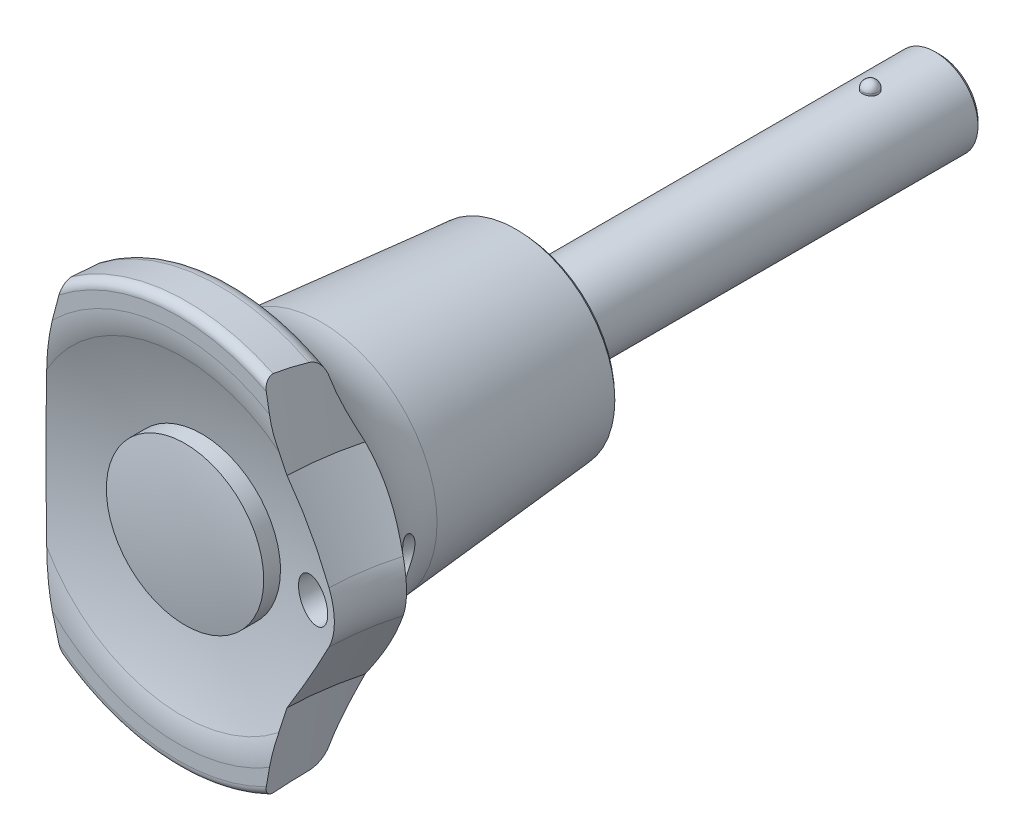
ISO-10303-21;
HEADER;
FILE_DESCRIPTION(('STEP AP214'),'2;1');
FILE_NAME('part.step','',(''),(''),'','','');
FILE_SCHEMA(('AUTOMOTIVE_DESIGN { 1 0 10303 214 1 1 1 1 }'));
ENDSEC;
DATA;
#1=APPLICATION_CONTEXT('core data for automotive mechanical design processes');
#2=APPLICATION_PROTOCOL_DEFINITION('international standard','automotive_design',2000,#1);
#3=PRODUCT_CONTEXT('',#1,'mechanical');
#4=PRODUCT('Part','Part','',(#3));
#5=PRODUCT_RELATED_PRODUCT_CATEGORY('part','',(#4));
#6=PRODUCT_DEFINITION_FORMATION('','',#4);
#7=PRODUCT_DEFINITION_CONTEXT('part definition',#1,'design');
#8=PRODUCT_DEFINITION('design','',#6,#7);
#9=PRODUCT_DEFINITION_SHAPE('','',#8);
#10=(LENGTH_UNIT() NAMED_UNIT(*) SI_UNIT(.MILLI.,.METRE.));
#11=(NAMED_UNIT(*) PLANE_ANGLE_UNIT() SI_UNIT($,.RADIAN.));
#12=(NAMED_UNIT(*) SI_UNIT($,.STERADIAN.) SOLID_ANGLE_UNIT());
#13=UNCERTAINTY_MEASURE_WITH_UNIT(LENGTH_MEASURE(1.E-05),#10,'distance_accuracy_value','');
#14=(GEOMETRIC_REPRESENTATION_CONTEXT(3) GLOBAL_UNCERTAINTY_ASSIGNED_CONTEXT((#13)) GLOBAL_UNIT_ASSIGNED_CONTEXT((#10,
#11,#12)) REPRESENTATION_CONTEXT('',''));
#15=CARTESIAN_POINT('',(0.,0.,0.));
#16=DIRECTION('',(0.,0.,1.));
#17=DIRECTION('',(1.,0.,0.));
#18=AXIS2_PLACEMENT_3D('',#15,#16,#17);
#19=CARTESIAN_POINT('',(0.,5.095,-40.9));
#20=DIRECTION('',(1.,0.,0.));
#21=DIRECTION('',(0.,1.,0.));
#22=AXIS2_PLACEMENT_3D('',#19,#20,#21);
#23=SPHERICAL_SURFACE('',#22,0.905);
#24=CARTESIAN_POINT('',(0.,5.19,-40.9));
#25=DIRECTION('',(0.,1.,0.));
#26=DIRECTION('',(0.,0.,1.));
#27=AXIS2_PLACEMENT_3D('',#24,#25,#26);
#28=CIRCLE('',#27,0.9);
#29=CARTESIAN_POINT('',(0.,5.19,-40.));
#30=VERTEX_POINT('',#29);
#31=EDGE_CURVE('E581',#30,#30,#28,.F.);
#32=ORIENTED_EDGE('',*,*,#31,.F.);
#33=EDGE_LOOP('',(#32));
#34=FACE_BOUND('',#33,.T.);
#35=ADVANCED_FACE('F14',(#34),#23,.T.);
#36=CARTESIAN_POINT('',(0.,-5.095,-40.9));
#37=DIRECTION('',(1.,0.,0.));
#38=DIRECTION('',(0.,1.,0.));
#39=AXIS2_PLACEMENT_3D('',#36,#37,#38);
#40=SPHERICAL_SURFACE('',#39,0.905000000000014);
#41=CARTESIAN_POINT('',(0.,-5.19000000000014,-40.9));
#42=DIRECTION('',(0.,1.,0.));
#43=DIRECTION('',(0.,0.,1.));
#44=AXIS2_PLACEMENT_3D('',#41,#42,#43);
#45=CIRCLE('',#44,0.9);
#46=CARTESIAN_POINT('',(0.,-5.19000000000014,-40.));
#47=VERTEX_POINT('',#46);
#48=EDGE_CURVE('E680',#47,#47,#45,.T.);
#49=ORIENTED_EDGE('',*,*,#48,.F.);
#50=EDGE_LOOP('',(#49));
#51=FACE_BOUND('',#50,.T.);
#52=ADVANCED_FACE('F670',(#51),#40,.T.);
#53=CARTESIAN_POINT('',(0.,2.25,-49.));
#54=DIRECTION('',(0.,0.,-1.));
#55=DIRECTION('',(-1.,0.,0.));
#56=AXIS2_PLACEMENT_3D('',#53,#54,#55);
#57=PLANE('',#56);
#58=CARTESIAN_POINT('',(0.,0.,-49.000000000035));
#59=DIRECTION('',(0.,0.,1.));
#60=DIRECTION('',(1.,0.,0.));
#61=AXIS2_PLACEMENT_3D('',#58,#59,#60);
#62=CIRCLE('',#61,4.49999999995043);
#63=CARTESIAN_POINT('',(4.49999999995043,0.,-49.000000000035));
#64=VERTEX_POINT('',#63);
#65=EDGE_CURVE('E681',#64,#64,#62,.T.);
#66=ORIENTED_EDGE('',*,*,#65,.F.);
#67=EDGE_LOOP('',(#66));
#68=FACE_BOUND('',#67,.T.);
#69=ADVANCED_FACE('F667',(#68),#57,.T.);
#70=CARTESIAN_POINT('',(0.,0.,-40.9));
#71=DIRECTION('',(0.,1.,0.));
#72=DIRECTION('',(0.,0.,1.));
#73=AXIS2_PLACEMENT_3D('',#70,#71,#72);
#74=CYLINDRICAL_SURFACE('',#73,0.9);
#75=CARTESIAN_POINT('',(0.,5.,-41.8));
#76=CARTESIAN_POINT('',(0.0501124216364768,4.99999901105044,-41.7999978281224));
#77=CARTESIAN_POINT('',(0.100255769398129,4.99923870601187,-41.7957998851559));
#78=CARTESIAN_POINT('',(0.199137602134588,4.99627847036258,-41.7791264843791));
#79=CARTESIAN_POINT('',(0.247874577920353,4.99407704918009,-41.7666424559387));
#80=CARTESIAN_POINT('',(0.34249063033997,4.9884811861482,-41.7337895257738));
#81=CARTESIAN_POINT('',(0.388372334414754,4.98508786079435,-41.7134280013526));
#82=CARTESIAN_POINT('',(0.47606157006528,4.97747978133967,-41.6654177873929));
#83=CARTESIAN_POINT('',(0.51786962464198,4.9732651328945,-41.6377700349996));
#84=CARTESIAN_POINT('',(0.596695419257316,4.96442800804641,-41.5756460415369));
#85=CARTESIAN_POINT('',(0.633661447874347,4.95980189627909,-41.5411046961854));
#86=CARTESIAN_POINT('',(0.701306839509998,4.95069050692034,-41.4663139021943));
#87=CARTESIAN_POINT('',(0.731985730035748,4.94620523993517,-41.4260640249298));
#88=CARTESIAN_POINT('',(0.786397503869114,4.93784820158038,-41.3406378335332));
#89=CARTESIAN_POINT('',(0.810078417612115,4.93398111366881,-41.2954279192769));
#90=CARTESIAN_POINT('',(0.849489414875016,4.92734915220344,-41.2015904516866));
#91=CARTESIAN_POINT('',(0.865220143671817,4.92458418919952,-41.1529631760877));
#92=CARTESIAN_POINT('',(0.888119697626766,4.92050592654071,-41.0542219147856));
#93=CARTESIAN_POINT('',(0.895378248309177,4.91917742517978,-41.0041293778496));
#94=CARTESIAN_POINT('',(0.901405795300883,4.91807661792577,-40.9034210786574));
#95=CARTESIAN_POINT('',(0.900175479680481,4.91830418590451,-40.8528053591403));
#96=CARTESIAN_POINT('',(0.889333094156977,4.92027595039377,-40.7531342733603));
#97=CARTESIAN_POINT('',(0.879822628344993,4.92200176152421,-40.7040674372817));
#98=CARTESIAN_POINT('',(0.852849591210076,4.92674673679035,-40.608236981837));
#99=CARTESIAN_POINT('',(0.835386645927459,4.92976596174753,-40.5614734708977));
#100=CARTESIAN_POINT('',(0.792902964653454,4.93677714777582,-40.4712762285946));
#101=CARTESIAN_POINT('',(0.767840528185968,4.94077445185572,-40.4278625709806));
#102=CARTESIAN_POINT('',(0.710900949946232,4.94928741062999,-40.3458218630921));
#103=CARTESIAN_POINT('',(0.679023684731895,4.95380307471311,-40.3071948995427));
#104=CARTESIAN_POINT('',(0.608815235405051,4.96292375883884,-40.2352394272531));
#105=CARTESIAN_POINT('',(0.570398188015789,4.96752913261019,-40.2019946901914));
#106=CARTESIAN_POINT('',(0.488468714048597,4.97625288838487,-40.1423951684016));
#107=CARTESIAN_POINT('',(0.444954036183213,4.98037105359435,-40.1160434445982));
#108=CARTESIAN_POINT('',(0.353963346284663,4.98766441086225,-40.0709683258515));
#109=CARTESIAN_POINT('',(0.306480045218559,4.99083781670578,-40.0522593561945));
#110=CARTESIAN_POINT('',(0.20905283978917,4.99586463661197,-40.0231462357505));
#111=CARTESIAN_POINT('',(0.159114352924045,4.99772082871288,-40.0127246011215));
#112=CARTESIAN_POINT('',(0.0726264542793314,4.99960356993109,-40.0021976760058));
#113=CARTESIAN_POINT('',(0.0363222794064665,5.0000010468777,-39.9999973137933));
#114=CARTESIAN_POINT('',(-0.0500858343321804,4.99999855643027,-40.0000037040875));
#115=CARTESIAN_POINT('',(-0.100206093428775,4.99923934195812,-40.0041963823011));
#116=CARTESIAN_POINT('',(-0.199090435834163,4.99628073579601,-40.0208609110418));
#117=CARTESIAN_POINT('',(-0.247851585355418,4.99407844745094,-40.0333494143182));
#118=CARTESIAN_POINT('',(-0.342496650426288,4.98848079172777,-40.0662127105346));
#119=CARTESIAN_POINT('',(-0.388384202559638,4.98508696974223,-40.0865772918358));
#120=CARTESIAN_POINT('',(-0.476072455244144,4.97747869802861,-40.1345893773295));
#121=CARTESIAN_POINT('',(-0.51787473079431,4.97326456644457,-40.1622340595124));
#122=CARTESIAN_POINT('',(-0.596690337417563,4.96442857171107,-40.2243498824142));
#123=CARTESIAN_POINT('',(-0.633651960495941,4.95980307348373,-40.258886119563));
#124=CARTESIAN_POINT('',(-0.701299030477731,4.95069165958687,-40.3336761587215));
#125=CARTESIAN_POINT('',(-0.73198240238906,4.94620579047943,-40.3739318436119));
#126=CARTESIAN_POINT('',(-0.786411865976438,4.93784595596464,-40.4593836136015));
#127=CARTESIAN_POINT('',(-0.81010304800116,4.93397693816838,-40.5046151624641));
#128=CARTESIAN_POINT('',(-0.849506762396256,4.9273462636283,-40.5984664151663));
#129=CARTESIAN_POINT('',(-0.865228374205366,4.9245833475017,-40.6470821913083));
#130=CARTESIAN_POINT('',(-0.884453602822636,4.92115841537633,-40.7299635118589));
#131=CARTESIAN_POINT('',(-0.890274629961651,4.92010435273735,-40.7636935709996));
#132=CARTESIAN_POINT('',(-0.898048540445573,4.91869131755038,-40.8316109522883));
#133=CARTESIAN_POINT('',(-0.900001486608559,4.91833233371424,-40.8657982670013));
#134=CARTESIAN_POINT('',(-0.899997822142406,4.91833410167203,-40.9501049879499));
#135=CARTESIAN_POINT('',(-0.895801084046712,4.91910713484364,-41.0002409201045));
#136=CARTESIAN_POINT('',(-0.879132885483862,4.92211278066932,-41.0991073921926));
#137=CARTESIAN_POINT('',(-0.866652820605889,4.92434691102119,-41.1478364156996));
#138=CARTESIAN_POINT('',(-0.833811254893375,4.93001364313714,-41.2424363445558));
#139=CARTESIAN_POINT('',(-0.813457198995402,4.93344511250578,-41.2883099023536));
#140=CARTESIAN_POINT('',(-0.765465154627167,4.94111838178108,-41.3759841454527));
#141=CARTESIAN_POINT('',(-0.737828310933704,4.94536005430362,-41.4177854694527));
#142=CARTESIAN_POINT('',(-0.675719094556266,4.95423002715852,-41.49661301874));
#143=CARTESIAN_POINT('',(-0.641179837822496,4.95886183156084,-41.5335861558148));
#144=CARTESIAN_POINT('',(-0.56638069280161,4.9679602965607,-41.6012537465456));
#145=CARTESIAN_POINT('',(-0.526119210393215,4.9724269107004,-41.6319464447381));
#146=CARTESIAN_POINT('',(-0.440662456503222,4.98073004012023,-41.6863859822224));
#147=CARTESIAN_POINT('',(-0.395432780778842,4.98456163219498,-41.7100795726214));
#148=CARTESIAN_POINT('',(-0.301585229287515,4.99111708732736,-41.7494884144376));
#149=CARTESIAN_POINT('',(-0.25297124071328,4.99384219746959,-41.7652126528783));
#150=CARTESIAN_POINT('',(-0.170082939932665,4.99721806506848,-41.7844450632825));
#151=CARTESIAN_POINT('',(-0.136343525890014,4.99825616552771,-41.7902693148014));
#152=CARTESIAN_POINT('',(-0.0684075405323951,4.99964746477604,-41.7980474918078));
#153=CARTESIAN_POINT('',(-0.0342109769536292,5.0000006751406,-41.8000014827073));
#154=CARTESIAN_POINT('',(0.,5.,-41.8));
#155=B_SPLINE_CURVE_WITH_KNOTS('',3,(#75,#76,#77,#78,#79,#80,#81,#82,#83,#84,#85,#86,#87,#88,
#89,#90,#91,#92,#93,#94,#95,#96,#97,#98,#99,#100,#101,#102,#103,#104,#105,#106,#107,#108,#109,
#110,#111,#112,#113,#114,#115,#116,#117,#118,#119,#120,#121,#122,#123,#124,#125,#126,#127,#128,
#129,#130,#131,#132,#133,#134,#135,#136,#137,#138,#139,#140,#141,#142,#143,#144,#145,#146,#147,
#148,#149,#150,#151,#152,#153,#154),.UNSPECIFIED.,.T.,.F.,(4,2,2,2,2,2,2,2,2,2,2,2,2,2,2,2,2,2,
2,2,2,2,2,2,2,2,2,2,2,2,2,2,2,2,2,2,2,2,2,4),(0.,0.150211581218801,0.300578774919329,
0.45080548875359,0.601012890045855,0.752712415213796,0.904423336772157,1.05723413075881,
1.21003251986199,1.36119756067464,1.51235034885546,1.66167410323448,1.81100488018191,
1.96117037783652,2.11133859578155,2.26365668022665,2.41604228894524,2.56871420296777,
2.72106316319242,2.82994351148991,2.98008175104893,3.13052228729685,3.28076842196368,
3.43095640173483,3.58263659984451,3.7343668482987,3.88725873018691,4.0399760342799,
4.14249708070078,4.24501646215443,4.39520570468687,4.54555120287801,4.695754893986,
4.84593498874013,4.99764780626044,5.14940297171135,5.30228458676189,5.45499341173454,
5.55754227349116,5.66008940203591),.UNSPECIFIED.);
#156=CARTESIAN_POINT('',(0.,5.,-41.8));
#157=VERTEX_POINT('',#156);
#158=EDGE_CURVE('E639',#157,#157,#155,.T.);
#159=ORIENTED_EDGE('',*,*,#158,.F.);
#160=EDGE_LOOP('',(#159));
#161=FACE_BOUND('',#160,.T.);
#162=ORIENTED_EDGE('',*,*,#31,.T.);
#163=EDGE_LOOP('',(#162));
#164=FACE_BOUND('',#163,.T.);
#165=ADVANCED_FACE('F662',(#161,#164),#74,.T.);
#166=CARTESIAN_POINT('',(0.,0.,-40.9));
#167=DIRECTION('',(0.,1.,0.));
#168=DIRECTION('',(0.,0.,1.));
#169=AXIS2_PLACEMENT_3D('',#166,#167,#168);
#170=CYLINDRICAL_SURFACE('',#169,0.9);
#171=ORIENTED_EDGE('',*,*,#48,.T.);
#172=EDGE_LOOP('',(#171));
#173=FACE_BOUND('',#172,.T.);
#174=CARTESIAN_POINT('',(0.,-5.,-40.));
#175=CARTESIAN_POINT('',(0.0500692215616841,-4.99999896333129,-40.0000023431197));
#176=CARTESIAN_POINT('',(0.100201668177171,-4.99923945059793,-40.0041960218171));
#177=CARTESIAN_POINT('',(0.19909493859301,-4.99628062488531,-40.0208612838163));
#178=CARTESIAN_POINT('',(0.24785279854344,-4.99407841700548,-40.0333495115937));
#179=CARTESIAN_POINT('',(0.342494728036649,-4.98848086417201,-40.0662123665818));
#180=CARTESIAN_POINT('',(0.388382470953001,-4.98508708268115,-40.0865766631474));
#181=CARTESIAN_POINT('',(0.476071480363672,-4.97747881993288,-40.1345885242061));
#182=CARTESIAN_POINT('',(0.51787419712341,-4.97326463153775,-40.1622334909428));
#183=CARTESIAN_POINT('',(0.596694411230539,-4.96442810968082,-40.2243532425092));
#184=CARTESIAN_POINT('',(0.633659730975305,-4.95980210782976,-40.2588937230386));
#185=CARTESIAN_POINT('',(0.701305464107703,-4.9506907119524,-40.3336842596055));
#186=CARTESIAN_POINT('',(0.731985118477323,-4.94620533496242,-40.3739350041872));
#187=CARTESIAN_POINT('',(0.786397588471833,-4.93784818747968,-40.4593623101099));
#188=CARTESIAN_POINT('',(0.810078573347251,-4.93398108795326,-40.5045723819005));
#189=CARTESIAN_POINT('',(0.849489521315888,-4.92734913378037,-40.5984098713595));
#190=CARTESIAN_POINT('',(0.865220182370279,-4.92458418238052,-40.6470369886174));
#191=CARTESIAN_POINT('',(0.888119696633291,-4.92050592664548,-40.7457780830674));
#192=CARTESIAN_POINT('',(0.895378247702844,-4.9191774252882,-40.7958706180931));
#193=CARTESIAN_POINT('',(0.901405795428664,-4.91807661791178,-40.8965789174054));
#194=CARTESIAN_POINT('',(0.900175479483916,-4.91830418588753,-40.9471946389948));
#195=CARTESIAN_POINT('',(0.889333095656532,-4.92027595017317,-41.0468657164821));
#196=CARTESIAN_POINT('',(0.879822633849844,-4.92200176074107,-41.095932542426));
#197=CARTESIAN_POINT('',(0.852849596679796,-4.92674673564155,-41.1917629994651));
#198=CARTESIAN_POINT('',(0.835386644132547,-4.92976596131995,-41.2385265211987));
#199=CARTESIAN_POINT('',(0.792902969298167,-4.93677714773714,-41.328723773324));
#200=CARTESIAN_POINT('',(0.767840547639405,-4.94077445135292,-41.3721374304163));
#201=CARTESIAN_POINT('',(0.710900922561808,-4.94928741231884,-41.4541781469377));
#202=CARTESIAN_POINT('',(0.67902359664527,-4.95380307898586,-41.4928051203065));
#203=CARTESIAN_POINT('',(0.608815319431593,-4.96292375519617,-41.5647605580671));
#204=CARTESIAN_POINT('',(0.570398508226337,-4.96752911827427,-41.5980052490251));
#205=CARTESIAN_POINT('',(0.48846838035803,-4.97625290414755,-41.6576049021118));
#206=CARTESIAN_POINT('',(0.444952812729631,-4.98037111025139,-41.6839568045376));
#207=CARTESIAN_POINT('',(0.353964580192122,-4.98766435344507,-41.7290314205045));
#208=CARTESIAN_POINT('',(0.306484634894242,-4.99083760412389,-41.7477397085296));
#209=CARTESIAN_POINT('',(0.209048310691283,-4.99586484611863,-41.7768546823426));
#210=CARTESIAN_POINT('',(0.159097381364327,-4.99772161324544,-41.7872788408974));
#211=CARTESIAN_POINT('',(0.0906480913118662,-4.99921111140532,-41.7956083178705));
#212=CARTESIAN_POINT('',(0.0725612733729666,-4.99950630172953,-41.7972538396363));
#213=CARTESIAN_POINT('',(0.0363190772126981,-4.99990093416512,-41.7994501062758));
#214=CARTESIAN_POINT('',(0.0181636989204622,-5.00000037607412,-41.8000008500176));
#215=CARTESIAN_POINT('',(-0.0500692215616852,-4.99999896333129,-41.7999976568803));
#216=CARTESIAN_POINT('',(-0.100201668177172,-4.99923945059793,-41.7958039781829));
#217=CARTESIAN_POINT('',(-0.199094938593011,-4.99628062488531,-41.7791387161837));
#218=CARTESIAN_POINT('',(-0.247852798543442,-4.99407841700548,-41.7666504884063));
#219=CARTESIAN_POINT('',(-0.34249472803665,-4.98848086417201,-41.7337876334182));
#220=CARTESIAN_POINT('',(-0.388382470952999,-4.98508708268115,-41.7134233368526));
#221=CARTESIAN_POINT('',(-0.476071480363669,-4.97747881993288,-41.6654114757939));
#222=CARTESIAN_POINT('',(-0.51787419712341,-4.97326463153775,-41.6377665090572));
#223=CARTESIAN_POINT('',(-0.596694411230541,-4.96442810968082,-41.5756467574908));
#224=CARTESIAN_POINT('',(-0.633659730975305,-4.95980210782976,-41.5411062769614));
#225=CARTESIAN_POINT('',(-0.701305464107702,-4.9506907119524,-41.4663157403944));
#226=CARTESIAN_POINT('',(-0.731985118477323,-4.94620533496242,-41.4260649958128));
#227=CARTESIAN_POINT('',(-0.786397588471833,-4.93784818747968,-41.3406376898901));
#228=CARTESIAN_POINT('',(-0.810078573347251,-4.93398108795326,-41.2954276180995));
#229=CARTESIAN_POINT('',(-0.849489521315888,-4.92734913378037,-41.2015901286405));
#230=CARTESIAN_POINT('',(-0.86522018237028,-4.92458418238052,-41.1529630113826));
#231=CARTESIAN_POINT('',(-0.888119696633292,-4.92050592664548,-41.0542219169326));
#232=CARTESIAN_POINT('',(-0.895378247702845,-4.9191774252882,-41.0041293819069));
#233=CARTESIAN_POINT('',(-0.901405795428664,-4.91807661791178,-40.9034210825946));
#234=CARTESIAN_POINT('',(-0.900175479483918,-4.91830418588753,-40.8528053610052));
#235=CARTESIAN_POINT('',(-0.889333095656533,-4.92027595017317,-40.7531342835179));
#236=CARTESIAN_POINT('',(-0.879822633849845,-4.92200176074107,-40.704067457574));
#237=CARTESIAN_POINT('',(-0.852849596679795,-4.92674673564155,-40.6082370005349));
#238=CARTESIAN_POINT('',(-0.835386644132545,-4.92976596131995,-40.5614734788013));
#239=CARTESIAN_POINT('',(-0.792902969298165,-4.93677714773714,-40.471276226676));
#240=CARTESIAN_POINT('',(-0.767840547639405,-4.94077445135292,-40.4278625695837));
#241=CARTESIAN_POINT('',(-0.710900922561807,-4.94928741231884,-40.3458218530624));
#242=CARTESIAN_POINT('',(-0.679023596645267,-4.95380307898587,-40.3071948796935));
#243=CARTESIAN_POINT('',(-0.608815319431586,-4.96292375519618,-40.2352394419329));
#244=CARTESIAN_POINT('',(-0.570398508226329,-4.96752911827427,-40.2019947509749));
#245=CARTESIAN_POINT('',(-0.488468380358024,-4.97625290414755,-40.1423950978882));
#246=CARTESIAN_POINT('',(-0.444952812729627,-4.98037111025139,-40.1160431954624));
#247=CARTESIAN_POINT('',(-0.353964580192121,-4.98766435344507,-40.0709685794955));
#248=CARTESIAN_POINT('',(-0.30648463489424,-4.99083760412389,-40.0522602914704));
#249=CARTESIAN_POINT('',(-0.209048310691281,-4.99586484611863,-40.0231453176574));
#250=CARTESIAN_POINT('',(-0.159097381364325,-4.99772161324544,-40.0127211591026));
#251=CARTESIAN_POINT('',(-0.0906480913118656,-4.99921111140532,-40.0043916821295));
#252=CARTESIAN_POINT('',(-0.0725612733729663,-4.99950630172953,-40.0027461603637));
#253=CARTESIAN_POINT('',(-0.0363190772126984,-4.99990093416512,-40.0005498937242));
#254=CARTESIAN_POINT('',(-0.018163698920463,-5.00000037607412,-39.9999991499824));
#255=CARTESIAN_POINT('',(0.,-5.,-40.));
#256=B_SPLINE_CURVE_WITH_KNOTS('',3,(#174,#175,#176,#177,#178,#179,#180,#181,#182,#183,#184,
#185,#186,#187,#188,#189,#190,#191,#192,#193,#194,#195,#196,#197,#198,#199,#200,#201,#202,#203,
#204,#205,#206,#207,#208,#209,#210,#211,#212,#213,#214,#215,#216,#217,#218,#219,#220,#221,#222,
#223,#224,#225,#226,#227,#228,#229,#230,#231,#232,#233,#234,#235,#236,#237,#238,#239,#240,#241,
#242,#243,#244,#245,#246,#247,#248,#249,#250,#251,#252,#253,#254,#255),.UNSPECIFIED.,.T.,.F.,(4,
2,2,2,2,2,2,2,2,2,2,2,2,2,2,2,2,2,2,2,2,2,2,2,2,2,2,2,2,2,2,2,2,2,2,2,2,2,2,2,4),(0.,
0.150138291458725,0.300578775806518,0.450822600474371,0.601012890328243,0.752708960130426,
0.904423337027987,1.05723463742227,1.21003252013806,1.3611975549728,1.51235034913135,
1.6616740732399,1.81100488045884,1.96117038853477,2.11133859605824,2.26365669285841,
2.41604228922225,2.56871416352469,2.72106316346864,2.77552903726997,2.82999496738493,
2.98013325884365,3.13057374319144,3.2808175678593,3.43100785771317,3.58270392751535,
3.73441830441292,3.88722960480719,4.04002748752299,4.19119252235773,4.34234531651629,
4.49166904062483,4.64099984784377,4.79116535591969,4.94133356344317,5.09365166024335,
5.24603725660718,5.39870913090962,5.55105813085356,5.6055240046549,5.65998993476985),.UNSPECIFIED.);
#257=CARTESIAN_POINT('',(0.,-5.,-40.));
#258=VERTEX_POINT('',#257);
#259=EDGE_CURVE('E643',#258,#258,#256,.T.);
#260=ORIENTED_EDGE('',*,*,#259,.F.);
#261=EDGE_LOOP('',(#260));
#262=FACE_BOUND('',#261,.T.);
#263=ADVANCED_FACE('F632',(#173,#262),#170,.T.);
#264=CARTESIAN_POINT('',(0.,0.,-48.5000000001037));
#265=DIRECTION('',(0.,0.,1.));
#266=DIRECTION('',(1.,0.,0.));
#267=AXIS2_PLACEMENT_3D('',#264,#265,#266);
#268=CONICAL_SURFACE('',#267,4.99999999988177,0.785398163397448);
#269=ORIENTED_EDGE('',*,*,#65,.T.);
#270=EDGE_LOOP('',(#269));
#271=FACE_BOUND('',#270,.T.);
#272=CARTESIAN_POINT('',(0.,0.,-48.5));
#273=DIRECTION('',(0.,0.,1.));
#274=DIRECTION('',(1.,0.,0.));
#275=AXIS2_PLACEMENT_3D('',#272,#273,#274);
#276=CIRCLE('',#275,5.);
#277=CARTESIAN_POINT('',(5.,0.,-48.5));
#278=VERTEX_POINT('',#277);
#279=EDGE_CURVE('E24',#278,#278,#276,.T.);
#280=ORIENTED_EDGE('',*,*,#279,.F.);
#281=EDGE_LOOP('',(#280));
#282=FACE_BOUND('',#281,.T.);
#283=ADVANCED_FACE('F627',(#271,#282),#268,.T.);
#284=CARTESIAN_POINT('',(0.,0.,-14.25));
#285=DIRECTION('',(0.,0.,1.));
#286=DIRECTION('',(1.,0.,0.));
#287=AXIS2_PLACEMENT_3D('',#284,#285,#286);
#288=CYLINDRICAL_SURFACE('',#287,5.);
#289=CARTESIAN_POINT('',(0.,0.,0.));
#290=DIRECTION('',(0.,0.,-1.));
#291=DIRECTION('',(-1.,0.,0.));
#292=AXIS2_PLACEMENT_3D('',#289,#290,#291);
#293=CIRCLE('',#292,5.);
#294=CARTESIAN_POINT('',(-5.,0.,0.));
#295=VERTEX_POINT('',#294);
#296=EDGE_CURVE('E9',#295,#295,#293,.F.);
#297=ORIENTED_EDGE('',*,*,#296,.F.);
#298=EDGE_LOOP('',(#297));
#299=FACE_BOUND('',#298,.T.);
#300=ORIENTED_EDGE('',*,*,#158,.T.);
#301=EDGE_LOOP('',(#300));
#302=FACE_BOUND('',#301,.T.);
#303=ORIENTED_EDGE('',*,*,#259,.T.);
#304=EDGE_LOOP('',(#303));
#305=FACE_BOUND('',#304,.T.);
#306=ORIENTED_EDGE('',*,*,#279,.T.);
#307=EDGE_LOOP('',(#306));
#308=FACE_BOUND('',#307,.T.);
#309=ADVANCED_FACE('F16',(#299,#302,#305,#308),#288,.T.);
#310=CARTESIAN_POINT('',(0.,-2.65618770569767E-13,-13.3000000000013));
#311=DIRECTION('',(1.,0.,0.));
#312=DIRECTION('',(0.,1.,0.));
#313=AXIS2_PLACEMENT_3D('',#310,#311,#312);
#314=SPHERICAL_SURFACE('',#313,53.3000000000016);
#315=CARTESIAN_POINT('',(0.,0.,39.2));
#316=DIRECTION('',(0.,0.,1.));
#317=DIRECTION('',(1.,0.,0.));
#318=AXIS2_PLACEMENT_3D('',#315,#316,#317);
#319=CIRCLE('',#318,9.2);
#320=CARTESIAN_POINT('',(9.2,0.,39.2));
#321=VERTEX_POINT('',#320);
#322=EDGE_CURVE('E575',#321,#321,#319,.F.);
#323=ORIENTED_EDGE('',*,*,#322,.F.);
#324=EDGE_LOOP('',(#323));
#325=FACE_BOUND('',#324,.T.);
#326=ADVANCED_FACE('F590',(#325),#314,.T.);
#327=CARTESIAN_POINT('',(0.,0.,29.6));
#328=DIRECTION('',(0.,0.,1.));
#329=DIRECTION('',(1.,0.,0.));
#330=AXIS2_PLACEMENT_3D('',#327,#328,#329);
#331=CYLINDRICAL_SURFACE('',#330,9.2);
#332=ORIENTED_EDGE('',*,*,#322,.T.);
#333=EDGE_LOOP('',(#332));
#334=FACE_BOUND('',#333,.T.);
#335=CARTESIAN_POINT('',(9.2,0.,37.2467115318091));
#336=CARTESIAN_POINT('',(9.20000185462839,-0.258477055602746,37.2467115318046));
#337=CARTESIAN_POINT('',(9.18910252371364,-0.516923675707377,37.2467115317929));
#338=CARTESIAN_POINT('',(9.14558128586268,-1.0320661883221,37.2467115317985));
#339=CARTESIAN_POINT('',(9.11295366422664,-1.28876160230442,37.2467115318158));
#340=CARTESIAN_POINT('',(9.02615325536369,-1.79876171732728,37.2467115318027));
#341=CARTESIAN_POINT('',(8.97195747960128,-2.05206250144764,37.2467115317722));
#342=CARTESIAN_POINT('',(8.84240671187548,-2.55319845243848,37.2467115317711));
#343=CARTESIAN_POINT('',(8.7670514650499,-2.80103355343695,37.2467115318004));
#344=CARTESIAN_POINT('',(8.59576047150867,-3.2893491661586,37.2467115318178));
#345=CARTESIAN_POINT('',(8.49983486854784,-3.52983323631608,37.2467115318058));
#346=CARTESIAN_POINT('',(8.28806173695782,-4.00186826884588,37.246711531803));
#347=CARTESIAN_POINT('',(8.17221389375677,-4.23341909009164,37.2467115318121));
#348=CARTESIAN_POINT('',(7.92147515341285,-4.68583944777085,37.2467115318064));
#349=CARTESIAN_POINT('',(7.78659246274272,-4.90671353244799,37.2467115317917));
#350=CARTESIAN_POINT('',(7.49865494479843,-5.3363920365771,37.2467115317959));
#351=CARTESIAN_POINT('',(7.34559384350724,-5.54519225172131,37.2467115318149));
#352=CARTESIAN_POINT('',(7.0224378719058,-5.94913959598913,37.2467115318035));
#353=CARTESIAN_POINT('',(6.85234434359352,-6.14428779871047,37.2467115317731));
#354=CARTESIAN_POINT('',(6.49631888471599,-6.51956588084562,37.246711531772));
#355=CARTESIAN_POINT('',(6.31038662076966,-6.69969544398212,37.2467115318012));
#356=CARTESIAN_POINT('',(5.92400519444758,-7.04365410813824,37.2467115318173));
#357=CARTESIAN_POINT('',(5.72355577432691,-7.20748291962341,37.2467115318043));
#358=CARTESIAN_POINT('',(5.30956347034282,-7.5176751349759,37.2467115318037));
#359=CARTESIAN_POINT('',(5.09602029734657,-7.66403815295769,37.2467115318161));
#360=CARTESIAN_POINT('',(4.65736864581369,-7.93825027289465,37.2467115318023));
#361=CARTESIAN_POINT('',(4.43226047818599,-8.06609987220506,37.246711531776));
#362=CARTESIAN_POINT('',(3.97207525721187,-8.30238022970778,37.2467115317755));
#363=CARTESIAN_POINT('',(3.73699826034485,-8.41081109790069,37.2467115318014));
#364=CARTESIAN_POINT('',(3.25854539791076,-8.60748402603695,37.246711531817));
#365=CARTESIAN_POINT('',(3.01516953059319,-8.69572608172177,37.2467115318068));
#366=CARTESIAN_POINT('',(2.5218489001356,-8.8513941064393,37.2467115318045));
#367=CARTESIAN_POINT('',(2.27190412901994,-8.9188200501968,37.2467115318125));
#368=CARTESIAN_POINT('',(1.76726641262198,-9.03236657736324,37.2467115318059));
#369=CARTESIAN_POINT('',(1.51257429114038,-9.07849082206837,37.2467115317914));
#370=CARTESIAN_POINT('',(1.00012124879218,-9.14913549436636,37.2467115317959));
#371=CARTESIAN_POINT('',(0.742359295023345,-9.17364842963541,37.2467115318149));
#372=CARTESIAN_POINT('',(0.225734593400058,-9.20086637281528,37.2467115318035));
#373=CARTESIAN_POINT('',(-0.03312794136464,-9.20357542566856,37.2467115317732));
#374=CARTESIAN_POINT('',(-0.550166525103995,-9.18717680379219,37.246711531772));
#375=CARTESIAN_POINT('',(-0.808342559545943,-9.16806867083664,37.2467115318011));
#376=CARTESIAN_POINT('',(-1.32216168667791,-9.10817141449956,37.2467115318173));
#377=CARTESIAN_POINT('',(-1.57780483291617,-9.06738275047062,37.2467115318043));
#378=CARTESIAN_POINT('',(-2.08475193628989,-8.96441355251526,37.2467115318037));
#379=CARTESIAN_POINT('',(-2.33605579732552,-8.90223254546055,37.2467115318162));
#380=CARTESIAN_POINT('',(-2.83253007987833,-8.75692145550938,37.2467115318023));
#381=CARTESIAN_POINT('',(-3.07770054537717,-8.67379152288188,37.246711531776));
#382=CARTESIAN_POINT('',(-3.56016551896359,-8.48717389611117,37.2467115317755));
#383=CARTESIAN_POINT('',(-3.79746007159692,-8.38368631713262,37.2467115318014));
#384=CARTESIAN_POINT('',(-4.26248809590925,-8.15708862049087,37.246711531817));
#385=CARTESIAN_POINT('',(-4.49022154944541,-8.03397846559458,37.2467115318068));
#386=CARTESIAN_POINT('',(-4.93450813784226,-7.7690108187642,37.2467115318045));
#387=CARTESIAN_POINT('',(-5.15106125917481,-7.62715330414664,37.2467115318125));
#388=CARTESIAN_POINT('',(-5.57141062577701,-7.32572590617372,37.2467115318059));
#389=CARTESIAN_POINT('',(-5.77520908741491,-7.16615911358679,37.2467115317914));
#390=CARTESIAN_POINT('',(-6.1687101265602,-6.83036880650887,37.246711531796));
#391=CARTESIAN_POINT('',(-6.35840779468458,-6.65413953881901,37.2467115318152));
#392=CARTESIAN_POINT('',(-6.72224710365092,-6.28635764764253,37.2467115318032));
#393=CARTESIAN_POINT('',(-6.89639155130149,-6.09480780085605,37.2467115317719));
#394=CARTESIAN_POINT('',(-7.22792754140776,-5.69771568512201,37.2467115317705));
#395=CARTESIAN_POINT('',(-7.38531882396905,-5.49217319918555,37.2467115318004));
#396=CARTESIAN_POINT('',(-7.68222361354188,-5.06856374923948,37.246711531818));
#397=CARTESIAN_POINT('',(-7.82173745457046,-4.85049701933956,37.2467115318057));
#398=CARTESIAN_POINT('',(-8.0819018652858,-4.4033808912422,37.2467115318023));
#399=CARTESIAN_POINT('',(-8.20255201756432,-4.17433125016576,37.2467115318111));
#400=CARTESIAN_POINT('',(-8.42410685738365,-3.70692592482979,37.2467115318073));
#401=CARTESIAN_POINT('',(-8.52501522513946,-3.4685719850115,37.2467115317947));
#402=CARTESIAN_POINT('',(-8.70642929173,-2.98412666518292,37.2467115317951));
#403=CARTESIAN_POINT('',(-8.78692781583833,-2.73803259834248,37.2467115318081));
#404=CARTESIAN_POINT('',(-8.92687528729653,-2.24003727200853,37.2467115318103));
#405=CARTESIAN_POINT('',(-8.9863326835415,-1.98813838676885,37.2467115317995));
#406=CARTESIAN_POINT('',(-9.08384258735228,-1.48011271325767,37.2467115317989));
#407=CARTESIAN_POINT('',(-9.12188538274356,-1.22398406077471,37.2467115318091));
#408=CARTESIAN_POINT('',(-9.17625392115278,-0.709432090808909,37.2467115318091));
#409=CARTESIAN_POINT('',(-9.19257966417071,-0.451008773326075,37.2467115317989));
#410=CARTESIAN_POINT('',(-9.20339556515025,0.0661771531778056,37.2467115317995));
#411=CARTESIAN_POINT('',(-9.19789561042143,0.324939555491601,37.2467115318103));
#412=CARTESIAN_POINT('',(-9.16511481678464,0.841185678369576,37.2467115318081));
#413=CARTESIAN_POINT('',(-9.13782521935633,1.09866884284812,37.2467115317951));
#414=CARTESIAN_POINT('',(-9.06166168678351,1.61033030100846,37.2467115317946));
#415=CARTESIAN_POINT('',(-9.01279532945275,1.86450972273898,37.2467115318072));
#416=CARTESIAN_POINT('',(-8.89381622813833,2.3678965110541,37.246711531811));
#417=CARTESIAN_POINT('',(-8.82369952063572,2.6171029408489,37.2467115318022));
#418=CARTESIAN_POINT('',(-8.66272318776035,3.10871759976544,37.2467115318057));
#419=CARTESIAN_POINT('',(-8.5718640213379,3.35112597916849,37.246711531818));
#420=CARTESIAN_POINT('',(-8.37004594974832,3.82743143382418,37.2467115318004));
#421=CARTESIAN_POINT('',(-8.25908666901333,4.06132834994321,37.2467115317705));
#422=CARTESIAN_POINT('',(-8.01786026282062,4.51893962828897,37.2467115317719));
#423=CARTESIAN_POINT('',(-7.88759343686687,4.74265414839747,37.2467115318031));
#424=CARTESIAN_POINT('',(-7.60865148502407,5.17835352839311,37.2467115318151));
#425=CARTESIAN_POINT('',(-7.45997303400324,5.39033625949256,37.246711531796));
#426=CARTESIAN_POINT('',(-7.14533841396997,5.80094952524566,37.2467115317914));
#427=CARTESIAN_POINT('',(-6.97938824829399,5.99958466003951,37.2467115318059));
#428=CARTESIAN_POINT('',(-6.63131665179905,6.3822048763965,37.2467115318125));
#429=CARTESIAN_POINT('',(-6.44919240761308,6.56618739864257,37.2467115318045));
#430=CARTESIAN_POINT('',(-6.07009243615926,6.91815563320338,37.2467115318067));
#431=CARTESIAN_POINT('',(-5.87311672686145,7.08614136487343,37.2467115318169));
#432=CARTESIAN_POINT('',(-5.46571438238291,7.40492171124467,37.2467115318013));
#433=CARTESIAN_POINT('',(-5.25528777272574,7.55571635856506,37.2467115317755));
#434=CARTESIAN_POINT('',(-4.8224780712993,7.83904364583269,37.2467115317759));
#435=CARTESIAN_POINT('',(-4.60009491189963,7.971576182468,37.2467115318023));
#436=CARTESIAN_POINT('',(-4.14495258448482,8.21743689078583,37.2467115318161));
#437=CARTESIAN_POINT('',(-3.91219334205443,8.33076492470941,37.2467115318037));
#438=CARTESIAN_POINT('',(-3.43796040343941,8.53740746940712,37.2467115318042));
#439=CARTESIAN_POINT('',(-3.19648690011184,8.6307224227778,37.2467115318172));
#440=CARTESIAN_POINT('',(-2.70653205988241,8.7966803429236,37.246711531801));
#441=CARTESIAN_POINT('',(-2.45805057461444,8.86932287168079,37.2467115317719));
#442=CARTESIAN_POINT('',(-1.95585656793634,8.99341554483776,37.2467115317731));
#443=CARTESIAN_POINT('',(-1.70214415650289,9.04486613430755,37.2467115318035));
#444=CARTESIAN_POINT('',(-1.19123944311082,9.12621890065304,37.2467115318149));
#445=CARTESIAN_POINT('',(-0.934046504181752,9.15611707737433,37.2467115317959));
#446=CARTESIAN_POINT('',(-0.418145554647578,9.19413024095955,37.2467115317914));
#447=CARTESIAN_POINT('',(-0.159438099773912,9.20225277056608,37.2467115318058));
#448=CARTESIAN_POINT('',(0.357786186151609,9.19667812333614,37.2467115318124));
#449=CARTESIAN_POINT('',(0.616302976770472,9.18297719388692,37.2467115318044));
#450=CARTESIAN_POINT('',(1.1312630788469,9.13384602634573,37.2467115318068));
#451=CARTESIAN_POINT('',(1.38770639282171,9.09841581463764,37.246711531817));
#452=CARTESIAN_POINT('',(1.89669667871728,9.00607800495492,37.2467115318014));
#453=CARTESIAN_POINT('',(2.1492436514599,8.9491704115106,37.2467115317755));
#454=CARTESIAN_POINT('',(2.64864726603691,8.81428203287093,37.2467115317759));
#455=CARTESIAN_POINT('',(2.89550387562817,8.73630112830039,37.2467115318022));
#456=CARTESIAN_POINT('',(3.38177681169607,8.55981829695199,37.246711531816));
#457=CARTESIAN_POINT('',(3.62119293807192,8.46131581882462,37.2467115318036));
#458=CARTESIAN_POINT('',(4.09087056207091,8.2444938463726,37.2467115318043));
#459=CARTESIAN_POINT('',(4.32113226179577,8.12617478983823,37.2467115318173));
#460=CARTESIAN_POINT('',(4.77086558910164,7.87056159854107,37.2467115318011));
#461=CARTESIAN_POINT('',(4.99033740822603,7.73326780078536,37.246711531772));
#462=CARTESIAN_POINT('',(5.4169305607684,7.44068268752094,37.2467115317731));
#463=CARTESIAN_POINT('',(5.62405215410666,7.28539175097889,37.2467115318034));
#464=CARTESIAN_POINT('',(6.02449325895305,6.95790104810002,37.2467115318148));
#465=CARTESIAN_POINT('',(6.21781168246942,6.78569995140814,37.2467115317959));
#466=CARTESIAN_POINT('',(6.58918960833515,6.42568596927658,37.2467115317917));
#467=CARTESIAN_POINT('',(6.76725436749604,6.23787850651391,37.2467115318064));
#468=CARTESIAN_POINT('',(7.10700778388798,5.84785067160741,37.246711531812));
#469=CARTESIAN_POINT('',(7.26868936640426,5.6456241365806,37.2467115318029));
#470=CARTESIAN_POINT('',(7.57443690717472,5.22827132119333,37.2467115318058));
#471=CARTESIAN_POINT('',(7.71850314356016,5.01314524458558,37.2467115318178));
#472=CARTESIAN_POINT('',(7.98806497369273,4.57141097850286,37.2467115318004));
#473=CARTESIAN_POINT('',(8.11355139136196,4.34479718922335,37.2467115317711));
#474=CARTESIAN_POINT('',(8.34497404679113,3.8818023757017,37.2467115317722));
#475=CARTESIAN_POINT('',(8.45091052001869,3.64542146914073,37.2467115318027));
#476=CARTESIAN_POINT('',(8.64237937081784,3.16482381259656,37.2467115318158));
#477=CARTESIAN_POINT('',(8.72793341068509,2.92061569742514,37.2467115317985));
#478=CARTESIAN_POINT('',(8.87815350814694,2.42594426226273,37.2467115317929));
#479=CARTESIAN_POINT('',(8.94282505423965,2.17548260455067,37.2467115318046));
#480=CARTESIAN_POINT('',(9.06430244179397,1.6070403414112,37.2467115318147));
#481=CARTESIAN_POINT('',(9.11514584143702,1.28776808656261,37.2467115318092));
#482=CARTESIAN_POINT('',(9.1829934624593,0.645648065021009,37.2467115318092));
#483=CARTESIAN_POINT('',(9.19999768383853,0.32280029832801,37.2467115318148));
#484=CARTESIAN_POINT('',(9.2,0.,37.2467115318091));
#485=B_SPLINE_CURVE_WITH_KNOTS('',3,(#335,#336,#337,#338,#339,#340,#341,#342,#343,#344,#345,
#346,#347,#348,#349,#350,#351,#352,#353,#354,#355,#356,#357,#358,#359,#360,#361,#362,#363,#364,
#365,#366,#367,#368,#369,#370,#371,#372,#373,#374,#375,#376,#377,#378,#379,#380,#381,#382,#383,
#384,#385,#386,#387,#388,#389,#390,#391,#392,#393,#394,#395,#396,#397,#398,#399,#400,#401,#402,
#403,#404,#405,#406,#407,#408,#409,#410,#411,#412,#413,#414,#415,#416,#417,#418,#419,#420,#421,
#422,#423,#424,#425,#426,#427,#428,#429,#430,#431,#432,#433,#434,#435,#436,#437,#438,#439,#440,
#441,#442,#443,#444,#445,#446,#447,#448,#449,#450,#451,#452,#453,#454,#455,#456,#457,#458,#459,
#460,#461,#462,#463,#464,#465,#466,#467,#468,#469,#470,#471,#472,#473,#474,#475,#476,#477,#478,
#479,#480,#481,#482,#483,#484),.UNSPECIFIED.,.T.,.F.,(4,2,2,2,2,2,2,2,2,2,2,2,2,2,2,2,2,2,2,2,2,
2,2,2,2,2,2,2,2,2,2,2,2,2,2,2,2,2,2,2,2,2,2,2,2,2,2,2,2,2,2,2,2,2,2,2,2,2,2,2,2,2,2,2,2,2,2,2,2,
2,2,2,2,2,4),(0.,0.775149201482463,1.55050235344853,2.32668414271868,3.1028752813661,
3.87868453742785,4.65450604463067,5.42999408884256,6.20575056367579,6.98144596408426,
7.7571576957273,8.53288320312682,9.30862584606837,10.0843476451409,10.8600650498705,
11.6357826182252,12.4115011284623,13.1870862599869,13.9629401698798,14.7386501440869,
15.5143764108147,16.2900862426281,17.0658132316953,17.8415346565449,18.6172516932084,
19.3929702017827,20.1686896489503,20.9442739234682,21.7201269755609,22.4958397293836,
23.2715645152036,24.0472748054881,24.8230022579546,25.5985849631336,26.3744399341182,
27.1499830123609,27.9258775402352,28.7017720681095,29.4773151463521,30.2531701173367,
31.0287528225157,31.8044802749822,32.5801905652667,33.3559153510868,34.1316281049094,
34.9074811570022,35.68306543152,36.4587848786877,37.2345033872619,38.0102204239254,
38.785941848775,39.5616688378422,40.3373786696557,41.1131049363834,41.8888149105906,
42.6646688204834,43.440253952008,44.2159724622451,44.9916900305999,45.7674074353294,
46.543129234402,47.3188718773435,48.094597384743,48.870309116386,49.6460045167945,
50.4217609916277,51.1972490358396,51.9730705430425,52.7488797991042,53.5250709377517,
54.3012527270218,55.0766058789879,55.8517550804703,56.8198038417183,57.7878526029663),.UNSPECIFIED.);
#486=CARTESIAN_POINT('',(9.2,0.,37.2467115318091));
#487=VERTEX_POINT('',#486);
#488=EDGE_CURVE('E453',#487,#487,#485,.T.);
#489=ORIENTED_EDGE('',*,*,#488,.F.);
#490=EDGE_LOOP('',(#489));
#491=FACE_BOUND('',#490,.T.);
#492=ADVANCED_FACE('F584',(#334,#491),#331,.T.);
#493=CARTESIAN_POINT('',(0.,0.,39.));
#494=DIRECTION('',(0.,0.,1.));
#495=DIRECTION('',(1.,0.,0.));
#496=AXIS2_PLACEMENT_3D('',#493,#494,#495);
#497=CONICAL_SURFACE('',#496,23.5,0.0872664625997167);
#498=CARTESIAN_POINT('',(-14.0673042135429,-18.4089758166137,35.2109490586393));
#499=CARTESIAN_POINT('',(-14.0384975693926,-18.4445454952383,35.3340774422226));
#500=CARTESIAN_POINT('',(-14.0105554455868,-18.4793411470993,35.4576313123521));
#501=CARTESIAN_POINT('',(-13.9564585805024,-18.5473642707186,35.7053725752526));
#502=CARTESIAN_POINT('',(-13.9303014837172,-18.580593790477,35.8295588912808));
#503=CARTESIAN_POINT('',(-13.8797805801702,-18.6455277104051,36.0785549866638));
#504=CARTESIAN_POINT('',(-13.8554150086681,-18.6772336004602,36.2033640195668));
#505=CARTESIAN_POINT('',(-13.8084834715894,-18.7391589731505,36.4535969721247));
#506=CARTESIAN_POINT('',(-13.7859163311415,-18.7693794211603,36.5790204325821));
#507=CARTESIAN_POINT('',(-13.7425890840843,-18.8283688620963,36.8304747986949));
#508=CARTESIAN_POINT('',(-13.721828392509,-18.8571383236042,36.9565054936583));
#509=CARTESIAN_POINT('',(-13.6821230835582,-18.9132561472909,37.2091644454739));
#510=CARTESIAN_POINT('',(-13.6631784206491,-18.9406045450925,37.3357926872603));
#511=CARTESIAN_POINT('',(-13.627113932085,-18.9939089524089,37.5896467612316));
#512=CARTESIAN_POINT('',(-13.6099947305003,-19.0198644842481,37.7168727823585));
#513=CARTESIAN_POINT('',(-13.5775920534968,-19.0704070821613,37.9719191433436));
#514=CARTESIAN_POINT('',(-13.5623098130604,-19.0949932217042,38.0997398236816));
#515=CARTESIAN_POINT('',(-13.5335934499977,-19.1428174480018,38.3559730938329));
#516=CARTESIAN_POINT('',(-13.5201611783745,-19.1660541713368,38.4843861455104));
#517=CARTESIAN_POINT('',(-13.495158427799,-19.2111958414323,38.7418028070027));
#518=CARTESIAN_POINT('',(-13.4835904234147,-19.2330989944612,38.8708069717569));
#519=CARTESIAN_POINT('',(-13.4729701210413,-19.254326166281,39.));
#520=B_SPLINE_CURVE_WITH_KNOTS('',3,(#498,#499,#500,#501,#502,#503,#504,#505,#506,#507,#508,
#509,#510,#511,#512,#513,#514,#515,#516,#517,#518,#519),.UNSPECIFIED.,.F.,.F.,(4,2,2,2,2,2,2,2,
2,2,4),(0.,0.39407565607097,0.787620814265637,1.18077296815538,1.57366614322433,
1.96643161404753,2.35918723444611,2.75207669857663,3.14522884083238,3.53877154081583,
3.93283238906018),.UNSPECIFIED.);
#521=CARTESIAN_POINT('',(-14.0673042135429,-18.4089758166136,35.2109490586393));
#522=VERTEX_POINT('',#521);
#523=CARTESIAN_POINT('',(-13.4729701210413,-19.2543261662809,39.));
#524=VERTEX_POINT('',#523);
#525=EDGE_CURVE('E425',#522,#524,#520,.T.);
#526=ORIENTED_EDGE('',*,*,#525,.F.);
#527=CARTESIAN_POINT('',(0.,0.,35.2109490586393));
#528=DIRECTION('',(0.,0.,1.));
#529=DIRECTION('',(1.,0.,0.));
#530=AXIS2_PLACEMENT_3D('',#527,#528,#529);
#531=CIRCLE('',#530,23.1685009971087);
#532=CARTESIAN_POINT('',(10.4924614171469,-20.6564201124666,35.2109490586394));
#533=VERTEX_POINT('',#532);
#534=EDGE_CURVE('E447',#533,#522,#531,.F.);
#535=ORIENTED_EDGE('',*,*,#534,.F.);
#536=CARTESIAN_POINT('',(10.4924614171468,-20.6564201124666,35.2109490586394));
#537=CARTESIAN_POINT('',(10.4414396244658,-20.7129643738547,35.5231506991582));
#538=CARTESIAN_POINT('',(10.3948183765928,-20.7670368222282,35.8365153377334));
#539=CARTESIAN_POINT('',(10.3104798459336,-20.8703793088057,36.464902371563));
#540=CARTESIAN_POINT('',(10.2727537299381,-20.9196540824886,36.7799228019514));
#541=CARTESIAN_POINT('',(10.2062065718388,-21.0136541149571,37.4115750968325));
#542=CARTESIAN_POINT('',(10.1773854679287,-21.0583794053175,37.7282069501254));
#543=CARTESIAN_POINT('',(10.1286691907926,-21.1434545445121,38.3630665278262));
#544=CARTESIAN_POINT('',(10.1087829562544,-21.1837999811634,38.6812955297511));
#545=CARTESIAN_POINT('',(10.0934036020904,-21.2219978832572,38.9999976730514));
#546=B_SPLINE_CURVE_WITH_KNOTS('',3,(#536,#537,#538,#539,#540,#541,#542,#543,#544,#545),
.UNSPECIFIED.,.F.,.F.,(4,2,2,2,4),(0.,0.964023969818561,1.92708655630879,2.89014245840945,
3.85415969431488),.UNSPECIFIED.);
#547=CARTESIAN_POINT('',(10.0934035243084,-21.221998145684,38.9999988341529));
#548=VERTEX_POINT('',#547);
#549=EDGE_CURVE('E551',#533,#548,#546,.T.);
#550=ORIENTED_EDGE('',*,*,#549,.T.);
#551=CARTESIAN_POINT('',(0.,0.,39.));
#552=DIRECTION('',(0.,0.,1.));
#553=DIRECTION('',(1.,0.,0.));
#554=AXIS2_PLACEMENT_3D('',#551,#552,#553);
#555=CIRCLE('',#554,23.5);
#556=EDGE_CURVE('E431',#524,#548,#555,.T.);
#557=ORIENTED_EDGE('',*,*,#556,.F.);
#558=EDGE_LOOP('',(#526,#535,#550,#557));
#559=FACE_BOUND('',#558,.T.);
#560=ADVANCED_FACE('F589',(#559),#497,.T.);
#561=CARTESIAN_POINT('',(0.,0.,39.));
#562=DIRECTION('',(0.,0.,1.));
#563=DIRECTION('',(1.,0.,0.));
#564=AXIS2_PLACEMENT_3D('',#561,#562,#563);
#565=TOROIDAL_SURFACE('',#564,22.5,1.);
#566=CARTESIAN_POINT('',(10.0934035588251,-21.221998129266,38.9999976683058));
#567=CARTESIAN_POINT('',(10.0926974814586,-21.222336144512,39.0238266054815));
#568=CARTESIAN_POINT('',(10.0921993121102,-21.2216269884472,39.0476642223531));
#569=CARTESIAN_POINT('',(10.0916184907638,-21.2181348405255,39.0951833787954));
#570=CARTESIAN_POINT('',(10.0915356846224,-21.2153526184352,39.1188649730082));
#571=CARTESIAN_POINT('',(10.0919077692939,-21.2039733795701,39.1891515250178));
#572=CARTESIAN_POINT('',(10.0929744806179,-21.1923473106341,39.2352967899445));
#573=CARTESIAN_POINT('',(10.0966377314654,-21.1616534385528,39.3248704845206));
#574=CARTESIAN_POINT('',(10.0992327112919,-21.1425932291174,39.3683016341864));
#575=CARTESIAN_POINT('',(10.105768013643,-21.0979672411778,39.451603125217));
#576=CARTESIAN_POINT('',(10.1097097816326,-21.0723944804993,39.4914695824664));
#577=CARTESIAN_POINT('',(10.1189779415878,-21.0142035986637,39.569123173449));
#578=CARTESIAN_POINT('',(10.1243705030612,-20.9812667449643,39.6066618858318));
#579=CARTESIAN_POINT('',(10.1361594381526,-20.9105436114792,39.6766362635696));
#580=CARTESIAN_POINT('',(10.1425561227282,-20.8727558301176,39.7090703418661));
#581=CARTESIAN_POINT('',(10.157340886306,-20.7862876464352,39.774053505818));
#582=CARTESIAN_POINT('',(10.1658804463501,-20.7368684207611,39.8055830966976));
#583=CARTESIAN_POINT('',(10.1837264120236,-20.6342194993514,39.8614255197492));
#584=CARTESIAN_POINT('',(10.1930336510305,-20.580985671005,39.8857303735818));
#585=CARTESIAN_POINT('',(10.2141045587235,-20.4608201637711,39.9314812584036));
#586=CARTESIAN_POINT('',(10.225982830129,-20.3933045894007,39.9513404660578));
#587=CARTESIAN_POINT('',(10.2501156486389,-20.256279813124,39.9810869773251));
#588=CARTESIAN_POINT('',(10.2623697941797,-20.1867727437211,39.9909845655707));
#589=CARTESIAN_POINT('',(10.2811304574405,-20.0803746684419,39.9986819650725));
#590=CARTESIAN_POINT('',(10.2875964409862,-20.0437065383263,39.9999977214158));
#591=CARTESIAN_POINT('',(10.2940578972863,-20.007058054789,40.));
#592=B_SPLINE_CURVE_WITH_KNOTS('',3,(#566,#567,#568,#569,#570,#571,#572,#573,#574,#575,#576,
#577,#578,#579,#580,#581,#582,#583,#584,#585,#586,#587,#588,#589,#590,#591),.UNSPECIFIED.,.F.,
.F.,(4,2,2,2,2,2,2,2,2,2,2,2,4),(0.,0.0714775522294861,0.142928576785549,0.284947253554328,
0.426821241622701,0.568847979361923,0.71897825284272,0.869155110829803,1.04622486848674,
1.22348944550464,1.43680698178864,1.64990405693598,1.76157017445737),.UNSPECIFIED.);
#593=CARTESIAN_POINT('',(10.294057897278,-20.0070580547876,40.));
#594=VERTEX_POINT('',#593);
#595=EDGE_CURVE('E430',#548,#594,#592,.T.);
#596=ORIENTED_EDGE('',*,*,#595,.T.);
#597=CARTESIAN_POINT('',(0.,0.,40.));
#598=DIRECTION('',(0.,0.,-1.));
#599=DIRECTION('',(0.457513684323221,-0.889202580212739,0.));
#600=AXIS2_PLACEMENT_3D('',#597,#598,#599);
#601=CIRCLE('',#600,22.5);
#602=CARTESIAN_POINT('',(-13.9431117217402,-17.6589817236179,40.));
#603=VERTEX_POINT('',#602);
#604=EDGE_CURVE('E418',#603,#594,#601,.F.);
#605=ORIENTED_EDGE('',*,*,#604,.F.);
#606=CARTESIAN_POINT('',(-13.4729701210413,-19.2543261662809,39.));
#607=CARTESIAN_POINT('',(-13.4722059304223,-19.2548679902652,39.0198018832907));
#608=CARTESIAN_POINT('',(-13.4717639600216,-19.2544524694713,39.0396385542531));
#609=CARTESIAN_POINT('',(-13.4715143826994,-19.2517517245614,39.0791693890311));
#610=CARTESIAN_POINT('',(-13.4717061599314,-19.2494683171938,39.0988636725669));
#611=CARTESIAN_POINT('',(-13.4727069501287,-19.2431132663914,39.137719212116));
#612=CARTESIAN_POINT('',(-13.4735090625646,-19.2390618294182,39.1568839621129));
#613=CARTESIAN_POINT('',(-13.4756900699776,-19.2292792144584,39.1947424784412));
#614=CARTESIAN_POINT('',(-13.4770690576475,-19.2235477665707,39.2134361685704));
#615=CARTESIAN_POINT('',(-13.4819990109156,-19.2040669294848,39.2684652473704));
#616=CARTESIAN_POINT('',(-13.4863482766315,-19.1879996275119,39.3039299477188));
#617=CARTESIAN_POINT('',(-13.4967843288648,-19.1508343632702,39.3718825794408));
#618=CARTESIAN_POINT('',(-13.5028762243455,-19.1297216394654,39.4043613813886));
#619=CARTESIAN_POINT('',(-13.5196912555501,-19.0723735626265,39.4811414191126));
#620=CARTESIAN_POINT('',(-13.5312250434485,-19.0337805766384,39.5234979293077));
#621=CARTESIAN_POINT('',(-13.5562206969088,-18.950853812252,39.6014346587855));
#622=CARTESIAN_POINT('',(-13.5696863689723,-18.9065087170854,39.637001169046));
#623=CARTESIAN_POINT('',(-13.5950695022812,-18.8231111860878,39.6956170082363));
#624=CARTESIAN_POINT('',(-13.6067683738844,-18.7847403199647,39.7197515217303));
#625=CARTESIAN_POINT('',(-13.6307295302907,-18.7061377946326,39.7644676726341));
#626=CARTESIAN_POINT('',(-13.6429921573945,-18.6659050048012,39.7850471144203));
#627=CARTESIAN_POINT('',(-13.6804390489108,-18.542855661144,39.8420713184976));
#628=CARTESIAN_POINT('',(-13.7062079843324,-18.4579308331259,39.873640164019));
#629=CARTESIAN_POINT('',(-13.7497954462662,-18.3134076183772,39.9171455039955));
#630=CARTESIAN_POINT('',(-13.7674559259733,-18.2546165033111,39.9321258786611));
#631=CARTESIAN_POINT('',(-13.802907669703,-18.1360390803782,39.9574787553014));
#632=CARTESIAN_POINT('',(-13.8206990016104,-18.0762522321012,39.9678486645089));
#633=CARTESIAN_POINT('',(-13.856003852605,-17.9569903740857,39.9841365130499));
#634=CARTESIAN_POINT('',(-13.8735175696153,-17.897523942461,39.9901183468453));
#635=CARTESIAN_POINT('',(-13.9084222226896,-17.7783711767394,39.9980400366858));
#636=CARTESIAN_POINT('',(-13.9258132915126,-17.7186852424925,39.9999852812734));
#637=CARTESIAN_POINT('',(-13.9431117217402,-17.6589817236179,40.));
#638=B_SPLINE_CURVE_WITH_KNOTS('',3,(#606,#607,#608,#609,#610,#611,#612,#613,#614,#615,#616,
#617,#618,#619,#620,#621,#622,#623,#624,#625,#626,#627,#628,#629,#630,#631,#632,#633,#634,#635,
#636,#637),.UNSPECIFIED.,.F.,.F.,(4,2,2,2,2,2,2,2,2,2,2,2,2,2,2,4),(0.,0.0594411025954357,
0.118824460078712,0.177546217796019,0.236277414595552,0.353195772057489,0.470460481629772,
0.644828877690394,0.819545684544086,0.959796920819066,1.10013446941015,1.38170264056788,
1.57112267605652,1.76064910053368,1.94735787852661,2.13381725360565),.UNSPECIFIED.);
#639=EDGE_CURVE('E383',#524,#603,#638,.T.);
#640=ORIENTED_EDGE('',*,*,#639,.F.);
#641=ORIENTED_EDGE('',*,*,#556,.T.);
#642=EDGE_LOOP('',(#596,#605,#640,#641));
#643=FACE_BOUND('',#642,.T.);
#644=ADVANCED_FACE('F395',(#643),#565,.T.);
#645=CARTESIAN_POINT('',(0.,21.6580572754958,40.));
#646=DIRECTION('',(0.,0.,1.));
#647=DIRECTION('',(1.,0.,0.));
#648=AXIS2_PLACEMENT_3D('',#645,#646,#647);
#649=PLANE('',#648);
#650=CARTESIAN_POINT('',(10.2940578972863,-20.0070580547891,40.));
#651=CARTESIAN_POINT('',(10.3097344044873,-19.9181521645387,39.9999999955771));
#652=CARTESIAN_POINT('',(10.3254109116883,-19.8292462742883,39.999999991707));
#653=CARTESIAN_POINT('',(10.3567639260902,-19.6514344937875,39.9999999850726));
#654=CARTESIAN_POINT('',(10.3724404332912,-19.5625286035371,39.9999999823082));
#655=CARTESIAN_POINT('',(10.4037934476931,-19.3847168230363,39.9999999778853));
#656=CARTESIAN_POINT('',(10.419469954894,-19.2958109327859,39.9999999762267));
#657=CARTESIAN_POINT('',(10.4508229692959,-19.1179991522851,39.9999999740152));
#658=CARTESIAN_POINT('',(10.4664994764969,-19.0290932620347,39.9999999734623));
#659=CARTESIAN_POINT('',(10.4978524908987,-18.8512814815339,39.9999999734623));
#660=CARTESIAN_POINT('',(10.5135289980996,-18.7623755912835,39.9999999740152));
#661=CARTESIAN_POINT('',(10.5448820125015,-18.5845638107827,39.9999999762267));
#662=CARTESIAN_POINT('',(10.5605585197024,-18.4956579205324,39.9999999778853));
#663=CARTESIAN_POINT('',(10.5919115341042,-18.3178461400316,39.9999999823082));
#664=CARTESIAN_POINT('',(10.6075880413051,-18.2289402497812,39.9999999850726));
#665=CARTESIAN_POINT('',(10.6389410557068,-18.0511284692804,39.999999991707));
#666=CARTESIAN_POINT('',(10.6546175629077,-17.96222257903,39.9999999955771));
#667=CARTESIAN_POINT('',(10.6702940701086,-17.8733166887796,40.));
#668=B_SPLINE_CURVE_WITH_KNOTS('',3,(#650,#651,#652,#653,#654,#655,#656,#657,#658,#659,#660,
#661,#662,#663,#664,#665,#666,#667),.UNSPECIFIED.,.F.,.F.,(4,2,2,2,2,2,2,2,4),(0.,
0.270832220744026,0.541664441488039,0.812496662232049,1.08332888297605,1.35416110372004,
1.62499332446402,1.895825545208,2.16665776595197),.UNSPECIFIED.);
#669=CARTESIAN_POINT('',(10.6702940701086,-17.8733166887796,40.));
#670=VERTEX_POINT('',#669);
#671=EDGE_CURVE('E236',#594,#670,#668,.T.);
#672=ORIENTED_EDGE('',*,*,#671,.T.);
#673=CARTESIAN_POINT('',(0.,0.,40.0000000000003));
#674=DIRECTION('',(0.,0.,1.));
#675=DIRECTION('',(-0.707099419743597,-0.707114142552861,0.));
#676=AXIS2_PLACEMENT_3D('',#673,#674,#675);
#677=CIRCLE('',#676,20.8161145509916);
#678=CARTESIAN_POINT('',(-14.7190625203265,-14.7193689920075,40.));
#679=VERTEX_POINT('',#678);
#680=EDGE_CURVE('E108',#679,#670,#677,.T.);
#681=ORIENTED_EDGE('',*,*,#680,.F.);
#682=CARTESIAN_POINT('',(-13.9431117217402,-17.6589817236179,40.));
#683=CARTESIAN_POINT('',(-14.0841765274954,-17.1721451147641,40.));
#684=CARTESIAN_POINT('',(-14.2193714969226,-16.6837590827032,40.));
#685=CARTESIAN_POINT('',(-14.4780217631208,-15.703888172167,40.));
#686=CARTESIAN_POINT('',(-14.6014770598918,-15.2124032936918,40.));
#687=CARTESIAN_POINT('',(-14.7190625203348,-14.7193689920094,40.));
#688=B_SPLINE_CURVE_WITH_KNOTS('',3,(#682,#683,#684,#685,#686,#687),.UNSPECIFIED.,.F.,.F.,(4,2,
4),(0.,1.52025897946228,3.04051795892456),.UNSPECIFIED.);
#689=EDGE_CURVE('E375',#603,#679,#688,.T.);
#690=ORIENTED_EDGE('',*,*,#689,.F.);
#691=ORIENTED_EDGE('',*,*,#604,.T.);
#692=EDGE_LOOP('',(#672,#681,#690,#691));
#693=FACE_BOUND('',#692,.T.);
#694=ADVANCED_FACE('F391',(#693),#649,.T.);
#695=CARTESIAN_POINT('',(0.,0.,32.));
#696=DIRECTION('',(0.,0.,1.));
#697=DIRECTION('',(1.,0.,0.));
#698=AXIS2_PLACEMENT_3D('',#695,#696,#697);
#699=TOROIDAL_SURFACE('',#698,20.8161145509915,8.00000000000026);
#700=CARTESIAN_POINT('',(10.6702940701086,-17.8733166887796,40.));
#701=CARTESIAN_POINT('',(10.6919702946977,-17.7503872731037,40.0000002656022));
#702=CARTESIAN_POINT('',(10.7136451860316,-17.6274605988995,39.9983277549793));
#703=CARTESIAN_POINT('',(10.7569331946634,-17.3819668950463,39.9917485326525));
#704=CARTESIAN_POINT('',(10.7785463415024,-17.2593996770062,39.9868490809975));
#705=CARTESIAN_POINT('',(10.8217150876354,-17.014619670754,39.9739365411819));
#706=CARTESIAN_POINT('',(10.8432707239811,-16.8924066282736,39.9659283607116));
#707=CARTESIAN_POINT('',(10.8863317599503,-16.6483285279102,39.9469118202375));
#708=CARTESIAN_POINT('',(10.90783718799,-16.52646324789,39.9359063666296));
#709=CARTESIAN_POINT('',(10.9508066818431,-16.2830753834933,39.9110027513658));
#710=CARTESIAN_POINT('',(10.9722707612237,-16.1615526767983,39.8971058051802));
#711=CARTESIAN_POINT('',(11.015160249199,-15.9188896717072,39.8665279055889));
#712=CARTESIAN_POINT('',(11.0365856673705,-15.7977492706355,39.8498477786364));
#713=CARTESIAN_POINT('',(11.0794197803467,-15.5557899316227,39.8137980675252));
#714=CARTESIAN_POINT('',(11.1008284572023,-15.4349712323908,39.7944268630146));
#715=CARTESIAN_POINT('',(11.1436442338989,-15.1936405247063,39.7530904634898));
#716=CARTESIAN_POINT('',(11.1650513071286,-15.0731289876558,39.731122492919));
#717=CARTESIAN_POINT('',(11.2078799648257,-14.8323987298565,39.684686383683));
#718=CARTESIAN_POINT('',(11.2293015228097,-14.7121807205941,39.6602145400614));
#719=CARTESIAN_POINT('',(11.2721765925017,-14.4720220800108,39.6088646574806));
#720=CARTESIAN_POINT('',(11.2936300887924,-14.3520823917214,39.5819821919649));
#721=CARTESIAN_POINT('',(11.3150842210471,-14.2324086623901,39.5539739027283));
#722=B_SPLINE_CURVE_WITH_KNOTS('',3,(#700,#701,#702,#703,#704,#705,#706,#707,#708,#709,#710,
#711,#712,#713,#714,#715,#716,#717,#718,#719,#720,#721),.UNSPECIFIED.,.F.,.F.,(4,2,2,2,2,2,2,2,
2,2,4),(0.,0.374462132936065,0.748084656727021,1.12111973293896,1.49379436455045,
1.86631265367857,2.23872052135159,2.61135360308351,2.98438863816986,3.35798385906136,
3.73227972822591),.UNSPECIFIED.);
#723=CARTESIAN_POINT('',(11.3150842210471,-14.2324086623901,39.5539739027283));
#724=VERTEX_POINT('',#723);
#725=EDGE_CURVE('E920',#670,#724,#722,.T.);
#726=ORIENTED_EDGE('',*,*,#725,.T.);
#727=CARTESIAN_POINT('',(0.,0.,39.5539739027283));
#728=DIRECTION('',(0.,0.,1.));
#729=DIRECTION('',(1.,0.,0.));
#730=AXIS2_PLACEMENT_3D('',#727,#728,#729);
#731=CIRCLE('',#730,18.1822052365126);
#732=CARTESIAN_POINT('',(-15.816089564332,-8.96905224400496,39.5539739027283));
#733=VERTEX_POINT('',#732);
#734=EDGE_CURVE('E100',#724,#733,#731,.F.);
#735=ORIENTED_EDGE('',*,*,#734,.T.);
#736=CARTESIAN_POINT('',(-14.7190625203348,-14.7193689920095,40.));
#737=CARTESIAN_POINT('',(-14.764588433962,-14.5284809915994,40.0000003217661));
#738=CARTESIAN_POINT('',(-14.8092254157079,-14.3373871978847,39.998019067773));
#739=CARTESIAN_POINT('',(-14.8966593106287,-13.9550930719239,39.9903860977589));
#740=CARTESIAN_POINT('',(-14.9394583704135,-13.7638931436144,39.9847387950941));
#741=CARTESIAN_POINT('',(-15.0232314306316,-13.3813798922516,39.9700706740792));
#742=CARTESIAN_POINT('',(-15.0642068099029,-13.1900667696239,39.9610524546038));
#743=CARTESIAN_POINT('',(-15.1443513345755,-12.8073167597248,39.9399365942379));
#744=CARTESIAN_POINT('',(-15.1835212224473,-12.6158799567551,39.9278402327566));
#745=CARTESIAN_POINT('',(-15.2600734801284,-12.2328733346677,39.9008622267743));
#746=CARTESIAN_POINT('',(-15.2974560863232,-12.0413035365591,39.885980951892));
#747=CARTESIAN_POINT('',(-15.3704376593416,-11.6580990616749,39.8537369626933));
#748=CARTESIAN_POINT('',(-15.4060371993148,-11.4664644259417,39.8363750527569));
#749=CARTESIAN_POINT('',(-15.4754900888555,-11.0830234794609,39.7994657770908));
#750=CARTESIAN_POINT('',(-15.5093428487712,-10.8912171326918,39.7799176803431));
#751=CARTESIAN_POINT('',(-15.5753211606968,-10.5074019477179,39.7389431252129));
#752=CARTESIAN_POINT('',(-15.6074457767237,-10.3153930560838,39.7175156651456));
#753=CARTESIAN_POINT('',(-15.6699840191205,-9.93114113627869,39.6730969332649));
#754=CARTESIAN_POINT('',(-15.7003964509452,-9.73889803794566,39.6501045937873));
#755=CARTESIAN_POINT('',(-15.7595222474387,-9.35414230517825,39.6028816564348));
#756=CARTESIAN_POINT('',(-15.7882342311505,-9.16162957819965,39.5786500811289));
#757=CARTESIAN_POINT('',(-15.816089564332,-8.96905224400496,39.5539739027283));
#758=B_SPLINE_CURVE_WITH_KNOTS('',3,(#736,#737,#738,#739,#740,#741,#742,#743,#744,#745,#746,
#747,#748,#749,#750,#751,#752,#753,#754,#755,#756,#757),.UNSPECIFIED.,.F.,.F.,(4,2,2,2,2,2,2,2,
2,2,4),(0.,0.58870442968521,1.17670146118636,1.76424609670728,2.35154692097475,2.93876985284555,
3.52580279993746,4.11303262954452,4.70057737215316,5.28852707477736,5.87694789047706),.UNSPECIFIED.);
#759=EDGE_CURVE('E372',#679,#733,#758,.T.);
#760=ORIENTED_EDGE('',*,*,#759,.F.);
#761=ORIENTED_EDGE('',*,*,#680,.T.);
#762=EDGE_LOOP('',(#726,#735,#760,#761));
#763=FACE_BOUND('',#762,.T.);
#764=ADVANCED_FACE('F303',(#763),#699,.T.);
#765=CARTESIAN_POINT('',(0.,1.42419277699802E-13,91.7));
#766=DIRECTION('',(1.,0.,0.));
#767=DIRECTION('',(0.,1.,0.));
#768=AXIS2_PLACEMENT_3D('',#765,#766,#767);
#769=SPHERICAL_SURFACE('',#768,55.225);
#770=ORIENTED_EDGE('',*,*,#488,.T.);
#771=EDGE_LOOP('',(#770));
#772=FACE_BOUND('',#771,.T.);
#773=ORIENTED_EDGE('',*,*,#734,.F.);
#774=CARTESIAN_POINT('',(11.3150842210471,-14.2324086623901,39.5539739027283));
#775=CARTESIAN_POINT('',(11.3396877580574,-14.0951679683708,39.5218549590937));
#776=CARTESIAN_POINT('',(11.3643498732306,-13.9578048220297,39.4903042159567));
#777=CARTESIAN_POINT('',(11.4137781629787,-13.6828598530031,39.4283431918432));
#778=CARTESIAN_POINT('',(11.4385443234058,-13.5452780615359,39.3979327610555));
#779=CARTESIAN_POINT('',(11.488172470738,-13.2698948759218,39.3382499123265));
#780=CARTESIAN_POINT('',(11.513034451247,-13.1320934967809,39.3089774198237));
#781=CARTESIAN_POINT('',(11.562846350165,-12.8562702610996,39.251568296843));
#782=CARTESIAN_POINT('',(11.5877962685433,-12.7182484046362,39.2234316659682));
#783=CARTESIAN_POINT('',(11.6377764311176,-12.4419831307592,39.1682923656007));
#784=CARTESIAN_POINT('',(11.6628066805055,-12.3037396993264,39.141289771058));
#785=CARTESIAN_POINT('',(11.7129402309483,-12.0270302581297,39.0884169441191));
#786=CARTESIAN_POINT('',(11.7380435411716,-11.888564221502,39.0625468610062));
#787=CARTESIAN_POINT('',(11.7631772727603,-11.75,39.0372447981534));
#788=B_SPLINE_CURVE_WITH_KNOTS('',3,(#774,#775,#776,#777,#778,#779,#780,#781,#782,#783,#784,
#785,#786,#787),.UNSPECIFIED.,.F.,.F.,(4,2,2,2,2,2,4),(0.,0.429239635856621,0.858422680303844,
1.28757755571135,1.71673228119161,2.14591532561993,2.57515477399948),.UNSPECIFIED.);
#789=CARTESIAN_POINT('',(11.7631772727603,-11.75,39.0372447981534));
#790=VERTEX_POINT('',#789);
#791=EDGE_CURVE('E145',#724,#790,#788,.T.);
#792=ORIENTED_EDGE('',*,*,#791,.T.);
#793=CARTESIAN_POINT('',(11.7631772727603,-11.75,39.0372447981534));
#794=CARTESIAN_POINT('',(11.9040869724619,-11.5071056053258,39.0145252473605));
#795=CARTESIAN_POINT('',(12.0450627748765,-11.2640403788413,38.9940434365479));
#796=CARTESIAN_POINT('',(12.3269167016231,-10.7779251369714,38.9575764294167));
#797=CARTESIAN_POINT('',(12.4677947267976,-10.53487548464,38.9415856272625));
#798=CARTESIAN_POINT('',(12.7494357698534,-10.0487823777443,38.9140785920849));
#799=CARTESIAN_POINT('',(12.8901987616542,-9.80573916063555,38.9025578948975));
#800=CARTESIAN_POINT('',(13.1715965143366,-9.31965198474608,38.8839735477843));
#801=CARTESIAN_POINT('',(13.3122312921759,-9.07660816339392,38.876906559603));
#802=CARTESIAN_POINT('',(13.5933625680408,-8.59051448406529,38.8672166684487));
#803=CARTESIAN_POINT('',(13.7338591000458,-8.34746469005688,38.8645915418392));
#804=CARTESIAN_POINT('',(14.0147074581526,-7.86135564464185,38.8637769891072));
#805=CARTESIAN_POINT('',(14.1550593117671,-7.61829641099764,38.8655864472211));
#806=CARTESIAN_POINT('',(14.4356159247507,-7.13216649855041,38.8736373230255));
#807=CARTESIAN_POINT('',(14.575820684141,-6.88909581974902,38.879878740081));
#808=CARTESIAN_POINT('',(14.8560846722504,-6.40294321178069,38.896794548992));
#809=CARTESIAN_POINT('',(14.9961438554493,-6.15986129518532,38.9074700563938));
#810=CARTESIAN_POINT('',(15.2761219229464,-5.67368961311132,38.9332598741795));
#811=CARTESIAN_POINT('',(15.4160407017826,-5.43059990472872,38.9483764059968));
#812=CARTESIAN_POINT('',(15.6957476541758,-4.94441892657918,38.9830590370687));
#813=CARTESIAN_POINT('',(15.8355356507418,-4.70132779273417,39.0026284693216));
#814=CARTESIAN_POINT('',(16.1149950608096,-4.21515302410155,39.0462326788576));
#815=CARTESIAN_POINT('',(16.2546662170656,-3.97206964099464,39.0702719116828));
#816=CARTESIAN_POINT('',(16.5339125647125,-3.48592369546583,39.1228369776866));
#817=CARTESIAN_POINT('',(16.6734874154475,-3.24286154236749,39.1513684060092));
#818=CARTESIAN_POINT('',(16.8129192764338,-3.,39.1821328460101));
#819=B_SPLINE_CURVE_WITH_KNOTS('',3,(#793,#794,#795,#796,#797,#798,#799,#800,#801,#802,#803,
#804,#805,#806,#807,#808,#809,#810,#811,#812,#813,#814,#815,#816,#817,#818),.UNSPECIFIED.,.F.,
.F.,(4,2,2,2,2,2,2,2,2,2,2,2,4),(0.,0.845168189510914,1.68927667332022,2.53253998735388,
3.37517048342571,4.21737902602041,5.05937568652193,5.90137222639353,6.74358072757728,
7.5862112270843,8.42947452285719,9.27358294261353,10.1187511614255),.UNSPECIFIED.);
#820=CARTESIAN_POINT('',(16.8129192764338,-3.,39.1821328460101));
#821=VERTEX_POINT('',#820);
#822=EDGE_CURVE('E142',#790,#821,#819,.T.);
#823=ORIENTED_EDGE('',*,*,#822,.T.);
#824=CARTESIAN_POINT('',(16.8129192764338,3.,39.1821328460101));
#825=CARTESIAN_POINT('',(16.895351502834,2.85645822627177,39.2003208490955));
#826=CARTESIAN_POINT('',(16.9719017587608,2.70937292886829,39.2172193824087));
#827=CARTESIAN_POINT('',(17.1127205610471,2.40915829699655,39.2483169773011));
#828=CARTESIAN_POINT('',(17.1769888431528,2.25602883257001,39.2625159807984));
#829=CARTESIAN_POINT('',(17.2926708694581,1.94491356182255,39.2880818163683));
#830=CARTESIAN_POINT('',(17.3440959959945,1.78693219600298,39.2994511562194));
#831=CARTESIAN_POINT('',(17.4337617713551,1.46709806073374,39.3192795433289));
#832=CARTESIAN_POINT('',(17.4720028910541,1.30524542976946,39.3277386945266));
#833=CARTESIAN_POINT('',(17.5350173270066,0.97869123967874,39.3416799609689));
#834=CARTESIAN_POINT('',(17.5597809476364,0.813987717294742,39.3471599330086));
#835=CARTESIAN_POINT('',(17.595597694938,0.483020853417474,39.3550864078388));
#836=CARTESIAN_POINT('',(17.6066505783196,0.316757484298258,39.3575328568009));
#837=CARTESIAN_POINT('',(17.6149557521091,-0.0161758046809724,39.3593710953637));
#838=CARTESIAN_POINT('',(17.6122042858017,-0.182845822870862,39.3587620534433));
#839=CARTESIAN_POINT('',(17.5929149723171,-0.515338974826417,39.3544927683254));
#840=CARTESIAN_POINT('',(17.5763777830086,-0.681162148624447,39.3508326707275));
#841=CARTESIAN_POINT('',(17.5297698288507,-1.00995631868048,39.3405190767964));
#842=CARTESIAN_POINT('',(17.4997668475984,-1.17293740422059,39.3338805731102));
#843=CARTESIAN_POINT('',(17.4264869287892,-1.49573563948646,39.3176708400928));
#844=CARTESIAN_POINT('',(17.3832103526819,-1.65555287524,39.3080996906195));
#845=CARTESIAN_POINT('',(17.2838112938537,-1.97064634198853,39.2861238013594));
#846=CARTESIAN_POINT('',(17.2277096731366,-2.12592949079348,39.273723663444));
#847=CARTESIAN_POINT('',(17.1030779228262,-2.43109637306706,39.2461874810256));
#848=CARTESIAN_POINT('',(17.0345551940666,-2.58098325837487,39.2310530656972));
#849=CARTESIAN_POINT('',(16.9367176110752,-2.77371623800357,39.2094540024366));
#850=CARTESIAN_POINT('',(16.9127485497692,-2.81946357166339,39.2041631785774));
#851=CARTESIAN_POINT('',(16.8636818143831,-2.91025237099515,39.1933339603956));
#852=CARTESIAN_POINT('',(16.8385854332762,-2.95529456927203,39.1877958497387));
#853=CARTESIAN_POINT('',(16.8129192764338,-3.,39.1821328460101));
#854=B_SPLINE_CURVE_WITH_KNOTS('',3,(#824,#825,#826,#827,#828,#829,#830,#831,#832,#833,#834,
#835,#836,#837,#838,#839,#840,#841,#842,#843,#844,#845,#846,#847,#848,#849,#850,#851,#852,#853),
.UNSPECIFIED.,.F.,.F.,(4,2,2,2,2,2,2,2,2,2,2,2,2,2,4),(0.,0.49942925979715,0.998869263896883,
1.49786505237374,1.99684301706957,2.49617947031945,2.9955247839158,3.4950059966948,
3.99446337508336,4.49143432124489,4.98839173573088,5.48454644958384,5.98040650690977,
6.13614391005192,6.29170703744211),.UNSPECIFIED.);
#855=CARTESIAN_POINT('',(16.8129192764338,3.,39.1821328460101));
#856=VERTEX_POINT('',#855);
#857=EDGE_CURVE('E902',#856,#821,#854,.T.);
#858=ORIENTED_EDGE('',*,*,#857,.F.);
#859=CARTESIAN_POINT('',(16.8129192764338,3.,39.1821328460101));
#860=CARTESIAN_POINT('',(16.6734874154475,3.24286154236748,39.1513684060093));
#861=CARTESIAN_POINT('',(16.5339125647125,3.48592369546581,39.1228369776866));
#862=CARTESIAN_POINT('',(16.2546662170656,3.97206964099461,39.0702719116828));
#863=CARTESIAN_POINT('',(16.1149950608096,4.21515302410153,39.0462326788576));
#864=CARTESIAN_POINT('',(15.8355356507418,4.70132779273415,39.0026284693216));
#865=CARTESIAN_POINT('',(15.6957476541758,4.94441892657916,38.9830590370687));
#866=CARTESIAN_POINT('',(15.4160407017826,5.4305999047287,38.9483764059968));
#867=CARTESIAN_POINT('',(15.2761219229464,5.6736896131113,38.9332598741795));
#868=CARTESIAN_POINT('',(14.9961438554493,6.1598612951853,38.9074700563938));
#869=CARTESIAN_POINT('',(14.8560846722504,6.40294321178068,38.896794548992));
#870=CARTESIAN_POINT('',(14.575820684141,6.88909581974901,38.879878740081));
#871=CARTESIAN_POINT('',(14.4356159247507,7.13216649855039,38.8736373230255));
#872=CARTESIAN_POINT('',(14.1550593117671,7.61829641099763,38.8655864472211));
#873=CARTESIAN_POINT('',(14.0147074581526,7.86135564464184,38.8637769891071));
#874=CARTESIAN_POINT('',(13.7338591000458,8.34746469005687,38.8645915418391));
#875=CARTESIAN_POINT('',(13.5933625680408,8.59051448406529,38.8672166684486));
#876=CARTESIAN_POINT('',(13.3122312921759,9.07660816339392,38.8769065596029));
#877=CARTESIAN_POINT('',(13.1715965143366,9.31965198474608,38.8839735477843));
#878=CARTESIAN_POINT('',(12.8901987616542,9.80573916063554,38.9025578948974));
#879=CARTESIAN_POINT('',(12.7494357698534,10.0487823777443,38.9140785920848));
#880=CARTESIAN_POINT('',(12.4677947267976,10.53487548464,38.9415856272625));
#881=CARTESIAN_POINT('',(12.3269167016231,10.7779251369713,38.9575764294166));
#882=CARTESIAN_POINT('',(12.0450627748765,11.2640403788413,38.9940434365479));
#883=CARTESIAN_POINT('',(11.9040869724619,11.5071056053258,39.0145252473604));
#884=CARTESIAN_POINT('',(11.7631772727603,11.75,39.0372447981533));
#885=B_SPLINE_CURVE_WITH_KNOTS('',3,(#859,#860,#861,#862,#863,#864,#865,#866,#867,#868,#869,
#870,#871,#872,#873,#874,#875,#876,#877,#878,#879,#880,#881,#882,#883,#884),.UNSPECIFIED.,.F.,
.F.,(4,2,2,2,2,2,2,2,2,2,2,2,4),(0.,0.845168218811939,1.68927663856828,2.53253993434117,
3.3751704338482,4.21737893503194,5.05937547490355,5.90137213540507,6.74358067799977,
7.5862111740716,8.42947448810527,9.27358297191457,10.1187511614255),.UNSPECIFIED.);
#886=CARTESIAN_POINT('',(11.7631772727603,11.75,39.0372447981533));
#887=VERTEX_POINT('',#886);
#888=EDGE_CURVE('E219',#856,#887,#885,.T.);
#889=ORIENTED_EDGE('',*,*,#888,.T.);
#890=CARTESIAN_POINT('',(11.7631772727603,11.75,39.0372447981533));
#891=CARTESIAN_POINT('',(11.7380435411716,11.888564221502,39.0625468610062));
#892=CARTESIAN_POINT('',(11.7129402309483,12.0270302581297,39.0884169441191));
#893=CARTESIAN_POINT('',(11.6628066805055,12.3037396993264,39.1412897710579));
#894=CARTESIAN_POINT('',(11.6377764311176,12.4419831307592,39.1682923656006));
#895=CARTESIAN_POINT('',(11.5877962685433,12.7182484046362,39.2234316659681));
#896=CARTESIAN_POINT('',(11.562846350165,12.8562702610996,39.2515682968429));
#897=CARTESIAN_POINT('',(11.513034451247,13.1320934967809,39.3089774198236));
#898=CARTESIAN_POINT('',(11.488172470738,13.2698948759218,39.3382499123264));
#899=CARTESIAN_POINT('',(11.4385443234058,13.5452780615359,39.3979327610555));
#900=CARTESIAN_POINT('',(11.4137781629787,13.6828598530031,39.4283431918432));
#901=CARTESIAN_POINT('',(11.3643498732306,13.9578048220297,39.4903042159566));
#902=CARTESIAN_POINT('',(11.3396877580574,14.0951679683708,39.5218549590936));
#903=CARTESIAN_POINT('',(11.3150842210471,14.2324086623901,39.5539739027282));
#904=B_SPLINE_CURVE_WITH_KNOTS('',3,(#890,#891,#892,#893,#894,#895,#896,#897,#898,#899,#900,
#901,#902,#903),.UNSPECIFIED.,.F.,.F.,(4,2,2,2,2,2,4),(0.,0.429239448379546,0.858422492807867,
1.28757721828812,1.71673209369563,2.14591513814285,2.57515477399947),.UNSPECIFIED.);
#905=CARTESIAN_POINT('',(11.3150842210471,14.2324086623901,39.5539739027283));
#906=VERTEX_POINT('',#905);
#907=EDGE_CURVE('E215',#887,#906,#904,.T.);
#908=ORIENTED_EDGE('',*,*,#907,.T.);
#909=CARTESIAN_POINT('',(0.,0.,39.5539739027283));
#910=DIRECTION('',(0.,0.,1.));
#911=DIRECTION('',(1.,0.,0.));
#912=AXIS2_PLACEMENT_3D('',#909,#910,#911);
#913=CIRCLE('',#912,18.1822052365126);
#914=CARTESIAN_POINT('',(-15.8160895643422,8.96905224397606,39.5539739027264));
#915=VERTEX_POINT('',#914);
#916=EDGE_CURVE('E520',#915,#906,#913,.F.);
#917=ORIENTED_EDGE('',*,*,#916,.F.);
#918=CARTESIAN_POINT('',(-15.816089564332,-8.96905224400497,39.5539739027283));
#919=CARTESIAN_POINT('',(-15.8799277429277,-8.52772038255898,39.4974278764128));
#920=CARTESIAN_POINT('',(-15.9392768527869,-8.08521773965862,39.4451310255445));
#921=CARTESIAN_POINT('',(-16.0487866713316,-7.19815446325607,39.3490143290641));
#922=CARTESIAN_POINT('',(-16.0989472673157,-6.75359380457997,39.3051945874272));
#923=CARTESIAN_POINT('',(-16.2353702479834,-5.4168592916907,39.1863847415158));
#924=CARTESIAN_POINT('',(-16.3075150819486,-4.52203684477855,39.124095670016));
#925=CARTESIAN_POINT('',(-16.4129557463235,-2.72821509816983,39.0332934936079));
#926=CARTESIAN_POINT('',(-16.4462417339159,-1.82921479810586,39.0047889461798));
#927=CARTESIAN_POINT('',(-16.4731698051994,-0.044457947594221,38.9817185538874));
#928=CARTESIAN_POINT('',(-16.4674332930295,0.841282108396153,38.9866207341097));
#929=CARTESIAN_POINT('',(-16.4178794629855,2.61056800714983,39.0291136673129));
#930=CARTESIAN_POINT('',(-16.3740756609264,3.49411451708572,39.0666928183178));
#931=CARTESIAN_POINT('',(-16.2491405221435,5.25603573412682,39.1745551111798));
#932=CARTESIAN_POINT('',(-16.1680344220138,6.13441353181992,39.244816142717));
#933=CARTESIAN_POINT('',(-16.0503828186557,7.17270894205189,39.347678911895));
#934=CARTESIAN_POINT('',(-16.0311976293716,7.33632113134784,39.3644753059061));
#935=CARTESIAN_POINT('',(-15.9915785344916,7.66325917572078,39.3992169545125));
#936=CARTESIAN_POINT('',(-15.9711447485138,7.82658505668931,39.417162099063));
#937=CARTESIAN_POINT('',(-15.9289952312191,8.15327519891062,39.4542406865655));
#938=CARTESIAN_POINT('',(-15.9072769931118,8.31663887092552,39.4733764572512));
#939=CARTESIAN_POINT('',(-15.8626059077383,8.64307317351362,39.5128064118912));
#940=CARTESIAN_POINT('',(-15.8396529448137,8.8061437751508,39.5331007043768));
#941=CARTESIAN_POINT('',(-15.8160895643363,8.96905224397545,39.5539739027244));
#942=B_SPLINE_CURVE_WITH_KNOTS('',3,(#918,#919,#920,#921,#922,#923,#924,#925,#926,#927,#928,
#929,#930,#931,#932,#933,#934,#935,#936,#937,#938,#939,#940,#941),.UNSPECIFIED.,.F.,.F.,(4,2,2,
2,2,2,2,2,2,2,2,4),(0.,1.34839714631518,2.69681083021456,5.3948707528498,8.0936139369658,
10.7494833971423,13.4044102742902,16.057543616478,16.5543037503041,17.0510163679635,
17.5487326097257,18.0464955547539),.UNSPECIFIED.);
#943=EDGE_CURVE('E360',#733,#915,#942,.T.);
#944=ORIENTED_EDGE('',*,*,#943,.F.);
#945=EDGE_LOOP('',(#773,#792,#823,#858,#889,#908,#917,#944));
#946=FACE_BOUND('',#945,.T.);
#947=CARTESIAN_POINT('',(11.8216184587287,0.,37.7551210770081));
#948=CARTESIAN_POINT('',(11.8216244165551,0.130131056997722,37.7551226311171));
#949=CARTESIAN_POINT('',(11.8323093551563,0.260358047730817,37.7579363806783));
#950=CARTESIAN_POINT('',(11.8747515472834,0.517194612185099,37.769114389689));
#951=CARTESIAN_POINT('',(11.9065343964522,0.643799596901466,37.7774853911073));
#952=CARTESIAN_POINT('',(11.9901581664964,0.889599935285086,37.7995148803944));
#953=CARTESIAN_POINT('',(12.0419819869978,1.00880150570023,37.8131688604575));
#954=CARTESIAN_POINT('',(12.1640844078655,1.23657485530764,37.8453482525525));
#955=CARTESIAN_POINT('',(12.2343589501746,1.34514896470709,37.8638725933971));
#956=CARTESIAN_POINT('',(12.3918918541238,1.54960606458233,37.9054130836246));
#957=CARTESIAN_POINT('',(12.4792799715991,1.64538204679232,37.9284635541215));
#958=CARTESIAN_POINT('',(12.6681183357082,1.82072893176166,37.9782951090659));
#959=CARTESIAN_POINT('',(12.7695702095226,1.90029795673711,38.0050766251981));
#960=CARTESIAN_POINT('',(12.9855755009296,2.04249874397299,38.0621262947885));
#961=CARTESIAN_POINT('',(13.1003305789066,2.10480256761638,38.0924481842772));
#962=CARTESIAN_POINT('',(13.3381793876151,2.20902450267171,38.1553302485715));
#963=CARTESIAN_POINT('',(13.4612739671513,2.25094053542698,38.1878906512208));
#964=CARTESIAN_POINT('',(13.7148105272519,2.31399912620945,38.2549952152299));
#965=CARTESIAN_POINT('',(13.8453477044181,2.33473157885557,38.2895653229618));
#966=CARTESIAN_POINT('',(14.1079298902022,2.35354244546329,38.3591496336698));
#967=CARTESIAN_POINT('',(14.2399750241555,2.35161896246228,38.3941638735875));
#968=CARTESIAN_POINT('',(14.503586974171,2.325034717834,38.4641116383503));
#969=CARTESIAN_POINT('',(14.635126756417,2.3000875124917,38.4990385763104));
#970=CARTESIAN_POINT('',(14.8922881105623,2.22769833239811,38.5673664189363));
#971=CARTESIAN_POINT('',(15.017909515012,2.1802557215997,38.6007672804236));
#972=CARTESIAN_POINT('',(15.2595617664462,2.06410891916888,38.6650600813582));
#973=CARTESIAN_POINT('',(15.3755957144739,1.99541163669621,38.6959528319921));
#974=CARTESIAN_POINT('',(15.5946409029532,1.8385405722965,38.7543055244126));
#975=CARTESIAN_POINT('',(15.6976530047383,1.75036807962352,38.781765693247));
#976=CARTESIAN_POINT('',(15.8859852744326,1.55840783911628,38.8319956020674));
#977=CARTESIAN_POINT('',(15.9715502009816,1.45487736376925,38.8548301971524));
#978=CARTESIAN_POINT('',(16.1241692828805,1.23410572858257,38.8955760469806));
#979=CARTESIAN_POINT('',(16.1912260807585,1.1168665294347,38.9134880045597));
#980=CARTESIAN_POINT('',(16.3031971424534,0.87504882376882,38.9434059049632));
#981=CARTESIAN_POINT('',(16.3486081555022,0.750716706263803,38.9555443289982));
#982=CARTESIAN_POINT('',(16.4181287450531,0.495829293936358,38.9741301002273));
#983=CARTESIAN_POINT('',(16.442241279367,0.365274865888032,38.9805782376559));
#984=CARTESIAN_POINT('',(16.4680638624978,0.10459082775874,38.9874837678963));
#985=CARTESIAN_POINT('',(16.4702334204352,-0.0254902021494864,38.9880640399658));
#986=CARTESIAN_POINT('',(16.4532951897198,-0.284153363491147,38.9835342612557));
#987=CARTESIAN_POINT('',(16.4341886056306,-0.412735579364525,38.9784245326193));
#988=CARTESIAN_POINT('',(16.3755222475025,-0.663934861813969,38.9627391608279));
#989=CARTESIAN_POINT('',(16.3360912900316,-0.786584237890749,38.9521979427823));
#990=CARTESIAN_POINT('',(16.2381166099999,-1.02340424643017,38.926015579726));
#991=CARTESIAN_POINT('',(16.1795720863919,-1.13757452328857,38.9103742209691));
#992=CARTESIAN_POINT('',(16.0443933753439,-1.35567209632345,38.8742752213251));
#993=CARTESIAN_POINT('',(15.9675571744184,-1.45946517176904,38.8537638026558));
#994=CARTESIAN_POINT('',(15.7984803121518,-1.6526042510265,38.8086535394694));
#995=CARTESIAN_POINT('',(15.7062379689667,-1.74194867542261,38.7840542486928));
#996=CARTESIAN_POINT('',(15.5067188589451,-1.90584273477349,38.7308785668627));
#997=CARTESIAN_POINT('',(15.3991462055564,-1.98000676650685,38.702224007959));
#998=CARTESIAN_POINT('',(15.1736979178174,-2.10907817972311,38.642209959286));
#999=CARTESIAN_POINT('',(15.0558210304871,-2.16398321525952,38.6108501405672));
#1000=CARTESIAN_POINT('',(14.8102414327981,-2.2542191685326,38.5455603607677));
#1001=CARTESIAN_POINT('',(14.6823768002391,-2.28907934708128,38.5115883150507));
#1002=CARTESIAN_POINT('',(14.4228169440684,-2.33639375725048,38.4426734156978));
#1003=CARTESIAN_POINT('',(14.291121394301,-2.34884607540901,38.4077304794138));
#1004=CARTESIAN_POINT('',(14.0259376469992,-2.35101352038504,38.3374150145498));
#1005=CARTESIAN_POINT('',(13.8924470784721,-2.3404510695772,38.3020424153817));
#1006=CARTESIAN_POINT('',(13.629071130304,-2.29623451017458,38.2322957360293));
#1007=CARTESIAN_POINT('',(13.4991857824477,-2.26258019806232,38.1979216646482));
#1008=CARTESIAN_POINT('',(13.2471167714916,-2.17311105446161,38.1312492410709));
#1009=CARTESIAN_POINT('',(13.1249138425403,-2.11735444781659,38.0989456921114));
#1010=CARTESIAN_POINT('',(12.8914792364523,-1.98510607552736,38.0372691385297));
#1011=CARTESIAN_POINT('',(12.7802463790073,-1.90861654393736,38.00789581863));
#1012=CARTESIAN_POINT('',(12.573714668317,-1.73824550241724,37.9533795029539));
#1013=CARTESIAN_POINT('',(12.4782033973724,-1.64463964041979,37.9281800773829));
#1014=CARTESIAN_POINT('',(12.3040784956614,-1.44184953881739,37.8822544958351));
#1015=CARTESIAN_POINT('',(12.2254673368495,-1.33266302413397,37.8615289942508));
#1016=CARTESIAN_POINT('',(12.0890170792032,-1.10410374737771,37.8255631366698));
#1017=CARTESIAN_POINT('',(12.0308080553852,-0.984966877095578,37.8102250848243));
#1018=CARTESIAN_POINT('',(11.9350004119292,-0.738255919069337,37.7849836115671));
#1019=CARTESIAN_POINT('',(11.897373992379,-0.610693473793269,37.7750728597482));
#1020=CARTESIAN_POINT('',(11.8543409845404,-0.401858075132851,37.7637387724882));
#1021=CARTESIAN_POINT('',(11.8420867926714,-0.322026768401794,37.7605114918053));
#1022=CARTESIAN_POINT('',(11.8257237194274,-0.161475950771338,37.756202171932));
#1023=CARTESIAN_POINT('',(11.8216147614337,-0.0807564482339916,37.7551201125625));
#1024=CARTESIAN_POINT('',(11.8216184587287,0.,37.7551210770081));
#1025=B_SPLINE_CURVE_WITH_KNOTS('',3,(#947,#948,#949,#950,#951,#952,#953,#954,#955,#956,#957,
#958,#959,#960,#961,#962,#963,#964,#965,#966,#967,#968,#969,#970,#971,#972,#973,#974,#975,#976,
#977,#978,#979,#980,#981,#982,#983,#984,#985,#986,#987,#988,#989,#990,#991,#992,#993,#994,#995,
#996,#997,#998,#999,#1000,#1001,#1002,#1003,#1004,#1005,#1006,#1007,#1008,#1009,#1010,#1011,
#1012,#1013,#1014,#1015,#1016,#1017,#1018,#1019,#1020,#1021,#1022,#1023,#1024),.UNSPECIFIED.,
.T.,.F.,(4,2,2,2,2,2,2,2,2,2,2,2,2,2,2,2,2,2,2,2,2,2,2,2,2,2,2,2,2,2,2,2,2,2,2,2,2,2,4),(0.,
0.390095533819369,0.780665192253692,1.17090232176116,1.56105369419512,1.95428651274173,
2.34756486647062,2.74786832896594,3.14821259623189,3.55616837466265,3.96415831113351,
4.3772935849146,4.79044054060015,5.2034533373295,5.61643880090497,6.02315706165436,
6.4298172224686,6.82663252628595,7.22339271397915,7.61182667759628,8.00023865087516,
8.38621858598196,8.77221469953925,9.16268954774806,9.55320705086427,9.95266635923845,
10.3521743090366,10.7607169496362,11.1692944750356,11.582827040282,11.9963632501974,
12.4088172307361,12.8212267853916,13.2275013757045,13.6338353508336,14.0323658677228,
14.4303567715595,14.6724436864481,14.9145283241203),.UNSPECIFIED.);
#1026=CARTESIAN_POINT('',(11.8216184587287,0.,37.7551210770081));
#1027=VERTEX_POINT('',#1026);
#1028=EDGE_CURVE('E223',#1027,#1027,#1025,.T.);
#1029=ORIENTED_EDGE('',*,*,#1028,.T.);
#1030=EDGE_LOOP('',(#1029));
#1031=FACE_BOUND('',#1030,.T.);
#1032=ADVANCED_FACE('F296',(#772,#946,#1031),#769,.F.);
#1033=CARTESIAN_POINT('',(0.,0.,32.));
#1034=DIRECTION('',(0.,0.,1.));
#1035=DIRECTION('',(1.,0.,0.));
#1036=AXIS2_PLACEMENT_3D('',#1033,#1034,#1035);
#1037=TOROIDAL_SURFACE('',#1036,20.8161145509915,8.00000000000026);
#1038=CARTESIAN_POINT('',(11.3150842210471,14.2324086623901,39.5539739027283));
#1039=CARTESIAN_POINT('',(11.2936300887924,14.3520823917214,39.5819821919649));
#1040=CARTESIAN_POINT('',(11.2721765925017,14.4720220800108,39.6088646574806));
#1041=CARTESIAN_POINT('',(11.2293015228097,14.7121807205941,39.6602145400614));
#1042=CARTESIAN_POINT('',(11.2078799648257,14.8323987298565,39.684686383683));
#1043=CARTESIAN_POINT('',(11.1650513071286,15.0731289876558,39.731122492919));
#1044=CARTESIAN_POINT('',(11.1436442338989,15.1936405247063,39.7530904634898));
#1045=CARTESIAN_POINT('',(11.1008284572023,15.4349712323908,39.7944268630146));
#1046=CARTESIAN_POINT('',(11.0794197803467,15.5557899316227,39.8137980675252));
#1047=CARTESIAN_POINT('',(11.0365856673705,15.7977492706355,39.8498477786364));
#1048=CARTESIAN_POINT('',(11.015160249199,15.9188896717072,39.8665279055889));
#1049=CARTESIAN_POINT('',(10.9722707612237,16.1615526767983,39.8971058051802));
#1050=CARTESIAN_POINT('',(10.9508066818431,16.2830753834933,39.9110027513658));
#1051=CARTESIAN_POINT('',(10.90783718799,16.52646324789,39.9359063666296));
#1052=CARTESIAN_POINT('',(10.8863317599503,16.6483285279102,39.9469118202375));
#1053=CARTESIAN_POINT('',(10.8432707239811,16.8924066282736,39.9659283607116));
#1054=CARTESIAN_POINT('',(10.8217150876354,17.014619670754,39.9739365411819));
#1055=CARTESIAN_POINT('',(10.7785463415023,17.2593996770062,39.9868490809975));
#1056=CARTESIAN_POINT('',(10.7569331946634,17.3819668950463,39.9917485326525));
#1057=CARTESIAN_POINT('',(10.7136451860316,17.6274605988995,39.9983277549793));
#1058=CARTESIAN_POINT('',(10.6919702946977,17.7503872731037,40.0000002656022));
#1059=CARTESIAN_POINT('',(10.6702940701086,17.8733166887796,40.));
#1060=B_SPLINE_CURVE_WITH_KNOTS('',3,(#1038,#1039,#1040,#1041,#1042,#1043,#1044,#1045,#1046,
#1047,#1048,#1049,#1050,#1051,#1052,#1053,#1054,#1055,#1056,#1057,#1058,#1059),.UNSPECIFIED.,
.F.,.F.,(4,2,2,2,2,2,2,2,2,2,4),(0.,0.374295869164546,0.747891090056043,1.1209261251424,
1.49355920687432,1.86596707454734,2.23848536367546,2.61115999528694,2.98419507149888,
3.35781759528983,3.7322797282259),.UNSPECIFIED.);
#1061=CARTESIAN_POINT('',(10.6702940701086,17.8733166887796,40.));
#1062=VERTEX_POINT('',#1061);
#1063=EDGE_CURVE('E231',#906,#1062,#1060,.T.);
#1064=ORIENTED_EDGE('',*,*,#1063,.T.);
#1065=CARTESIAN_POINT('',(0.,0.,40.0000000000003));
#1066=DIRECTION('',(0.,0.,1.));
#1067=DIRECTION('',(0.512597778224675,0.858628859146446,0.));
#1068=AXIS2_PLACEMENT_3D('',#1065,#1066,#1067);
#1069=CIRCLE('',#1068,20.8161145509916);
#1070=CARTESIAN_POINT('',(-14.7190625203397,14.7193689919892,40.));
#1071=VERTEX_POINT('',#1070);
#1072=EDGE_CURVE('E324',#1071,#1062,#1069,.F.);
#1073=ORIENTED_EDGE('',*,*,#1072,.F.);
#1074=CARTESIAN_POINT('',(-15.8160895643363,8.96905224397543,39.5539739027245));
#1075=CARTESIAN_POINT('',(-15.7882342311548,9.16162957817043,39.5786500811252));
#1076=CARTESIAN_POINT('',(-15.759522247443,9.35414230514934,39.6028816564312));
#1077=CARTESIAN_POINT('',(-15.7003964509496,9.73889803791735,39.6501045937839));
#1078=CARTESIAN_POINT('',(-15.669984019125,9.9311411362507,39.6730969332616));
#1079=CARTESIAN_POINT('',(-15.6074457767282,10.3153930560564,39.7175156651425));
#1080=CARTESIAN_POINT('',(-15.5753211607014,10.5074019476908,39.73894312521));
#1081=CARTESIAN_POINT('',(-15.5093428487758,10.8912171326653,39.7799176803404));
#1082=CARTESIAN_POINT('',(-15.4754900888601,11.0830234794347,39.7994657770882));
#1083=CARTESIAN_POINT('',(-15.4060371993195,11.4664644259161,39.8363750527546));
#1084=CARTESIAN_POINT('',(-15.3704376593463,11.6580990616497,39.853736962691));
#1085=CARTESIAN_POINT('',(-15.2974560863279,12.0413035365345,39.88598095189));
#1086=CARTESIAN_POINT('',(-15.2600734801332,12.2328733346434,39.9008622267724));
#1087=CARTESIAN_POINT('',(-15.1835212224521,12.6158799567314,39.927840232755));
#1088=CARTESIAN_POINT('',(-15.1443513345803,12.8073167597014,39.9399365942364));
#1089=CARTESIAN_POINT('',(-15.0642068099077,13.1900667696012,39.9610524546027));
#1090=CARTESIAN_POINT('',(-15.0232314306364,13.3813798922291,39.9700706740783));
#1091=CARTESIAN_POINT('',(-14.9394583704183,13.7638931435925,39.9847387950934));
#1092=CARTESIAN_POINT('',(-14.8966593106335,13.9550930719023,39.9903860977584));
#1093=CARTESIAN_POINT('',(-14.8092254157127,14.3373871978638,39.9980190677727));
#1094=CARTESIAN_POINT('',(-14.7645884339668,14.5284809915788,40.000000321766));
#1095=CARTESIAN_POINT('',(-14.7190625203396,14.7193689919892,40.));
#1096=B_SPLINE_CURVE_WITH_KNOTS('',3,(#1074,#1075,#1076,#1077,#1078,#1079,#1080,#1081,#1082,
#1083,#1084,#1085,#1086,#1087,#1088,#1089,#1090,#1091,#1092,#1093,#1094,#1095),.UNSPECIFIED.,
.F.,.F.,(4,2,2,2,2,2,2,2,2,2,4),(0.,0.588420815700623,1.17637051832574,1.7639152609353,
2.35114509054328,2.93817803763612,3.52540096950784,4.11270179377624,4.70024642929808,
5.28824346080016,5.87694789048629),.UNSPECIFIED.);
#1097=EDGE_CURVE('E357',#915,#1071,#1096,.T.);
#1098=ORIENTED_EDGE('',*,*,#1097,.F.);
#1099=ORIENTED_EDGE('',*,*,#916,.T.);
#1100=EDGE_LOOP('',(#1064,#1073,#1098,#1099));
#1101=FACE_BOUND('',#1100,.T.);
#1102=ADVANCED_FACE('F302',(#1101),#1037,.T.);
#1103=CARTESIAN_POINT('',(0.,21.6580572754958,40.));
#1104=DIRECTION('',(0.,0.,1.));
#1105=DIRECTION('',(1.,0.,0.));
#1106=AXIS2_PLACEMENT_3D('',#1103,#1104,#1105);
#1107=PLANE('',#1106);
#1108=CARTESIAN_POINT('',(10.6702940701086,17.8733166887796,40.0000000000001));
#1109=CARTESIAN_POINT('',(10.6546175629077,17.96222257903,39.9999999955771));
#1110=CARTESIAN_POINT('',(10.6389410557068,18.0511284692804,39.9999999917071));
#1111=CARTESIAN_POINT('',(10.607588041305,18.2289402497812,39.9999999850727));
#1112=CARTESIAN_POINT('',(10.5919115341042,18.3178461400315,39.9999999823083));
#1113=CARTESIAN_POINT('',(10.5605585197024,18.4956579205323,39.9999999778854));
#1114=CARTESIAN_POINT('',(10.5448820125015,18.5845638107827,39.9999999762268));
#1115=CARTESIAN_POINT('',(10.5135289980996,18.7623755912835,39.9999999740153));
#1116=CARTESIAN_POINT('',(10.4978524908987,18.8512814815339,39.9999999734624));
#1117=CARTESIAN_POINT('',(10.4664994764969,19.0290932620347,39.9999999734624));
#1118=CARTESIAN_POINT('',(10.4508229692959,19.1179991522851,39.9999999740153));
#1119=CARTESIAN_POINT('',(10.419469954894,19.2958109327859,39.9999999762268));
#1120=CARTESIAN_POINT('',(10.4037934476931,19.3847168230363,39.9999999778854));
#1121=CARTESIAN_POINT('',(10.3724404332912,19.5625286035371,39.9999999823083));
#1122=CARTESIAN_POINT('',(10.3567639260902,19.6514344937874,39.9999999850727));
#1123=CARTESIAN_POINT('',(10.3254109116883,19.8292462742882,39.9999999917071));
#1124=CARTESIAN_POINT('',(10.3097344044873,19.9181521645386,39.9999999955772));
#1125=CARTESIAN_POINT('',(10.2940578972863,20.007058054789,40.0000000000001));
#1126=B_SPLINE_CURVE_WITH_KNOTS('',3,(#1108,#1109,#1110,#1111,#1112,#1113,#1114,#1115,#1116,
#1117,#1118,#1119,#1120,#1121,#1122,#1123,#1124,#1125),.UNSPECIFIED.,.F.,.F.,(4,2,2,2,2,2,2,2,
4),(0.,0.270832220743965,0.541664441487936,0.812496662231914,1.0833288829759,1.3541611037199,
1.6249933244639,1.89582554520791,2.16665776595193),.UNSPECIFIED.);
#1127=CARTESIAN_POINT('',(10.294057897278,20.0070580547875,40.));
#1128=VERTEX_POINT('',#1127);
#1129=EDGE_CURVE('E227',#1062,#1128,#1126,.T.);
#1130=ORIENTED_EDGE('',*,*,#1129,.T.);
#1131=CARTESIAN_POINT('',(0.,0.,40.));
#1132=DIRECTION('',(0.,0.,-1.));
#1133=DIRECTION('',(-0.619693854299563,0.784843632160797,0.));
#1134=AXIS2_PLACEMENT_3D('',#1131,#1132,#1133);
#1135=CIRCLE('',#1134,22.5);
#1136=CARTESIAN_POINT('',(-13.9431117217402,17.6589817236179,40.));
#1137=VERTEX_POINT('',#1136);
#1138=EDGE_CURVE('E224',#1137,#1128,#1135,.T.);
#1139=ORIENTED_EDGE('',*,*,#1138,.F.);
#1140=CARTESIAN_POINT('',(-14.7190625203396,14.7193689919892,40.));
#1141=CARTESIAN_POINT('',(-14.601477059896,15.212403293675,40.));
#1142=CARTESIAN_POINT('',(-14.4780217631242,15.7038881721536,40.));
#1143=CARTESIAN_POINT('',(-14.2193714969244,16.6837590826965,40.));
#1144=CARTESIAN_POINT('',(-14.0841765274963,17.1721451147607,40.));
#1145=CARTESIAN_POINT('',(-13.9431117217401,17.6589817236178,40.));
#1146=B_SPLINE_CURVE_WITH_KNOTS('',3,(#1140,#1141,#1142,#1143,#1144,#1145),.UNSPECIFIED.,.F.,
.F.,(4,2,4),(0.,1.52025897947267,3.04051795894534),.UNSPECIFIED.);
#1147=EDGE_CURVE('E355',#1071,#1137,#1146,.T.);
#1148=ORIENTED_EDGE('',*,*,#1147,.F.);
#1149=ORIENTED_EDGE('',*,*,#1072,.T.);
#1150=EDGE_LOOP('',(#1130,#1139,#1148,#1149));
#1151=FACE_BOUND('',#1150,.T.);
#1152=ADVANCED_FACE('F331',(#1151),#1107,.T.);
#1153=CARTESIAN_POINT('',(0.,0.,39.));
#1154=DIRECTION('',(0.,0.,1.));
#1155=DIRECTION('',(1.,0.,0.));
#1156=AXIS2_PLACEMENT_3D('',#1153,#1154,#1155);
#1157=TOROIDAL_SURFACE('',#1156,22.5,1.);
#1158=CARTESIAN_POINT('',(10.2940578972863,20.007058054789,40.));
#1159=CARTESIAN_POINT('',(10.2793938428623,20.0902734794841,39.9999779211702));
#1160=CARTESIAN_POINT('',(10.2646799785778,20.1736727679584,39.9932001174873));
#1161=CARTESIAN_POINT('',(10.2355887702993,20.3387204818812,39.9655896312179));
#1162=CARTESIAN_POINT('',(10.2212142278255,20.4203540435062,39.944666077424));
#1163=CARTESIAN_POINT('',(10.1959951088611,20.5640544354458,39.8933989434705));
#1164=CARTESIAN_POINT('',(10.1849874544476,20.6269591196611,39.8654948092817));
#1165=CARTESIAN_POINT('',(10.164051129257,20.7473976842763,39.7997325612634));
#1166=CARTESIAN_POINT('',(10.1541194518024,20.8049464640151,39.7619032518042));
#1167=CARTESIAN_POINT('',(10.1375570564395,20.9022392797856,39.684352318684));
#1168=CARTESIAN_POINT('',(10.1306571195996,20.9432936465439,39.646335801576));
#1169=CARTESIAN_POINT('',(10.1182248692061,21.018811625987,39.5639605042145));
#1170=CARTESIAN_POINT('',(10.1126926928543,21.0532745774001,39.5196010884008));
#1171=CARTESIAN_POINT('',(10.1033263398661,21.114086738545,39.4248545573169));
#1172=CARTESIAN_POINT('',(10.0995076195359,21.1403614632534,39.374417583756));
#1173=CARTESIAN_POINT('',(10.0940012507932,21.182557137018,39.2693054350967));
#1174=CARTESIAN_POINT('',(10.0923087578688,21.1985015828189,39.2146401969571));
#1175=CARTESIAN_POINT('',(10.0915342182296,21.213480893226,39.1327704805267));
#1176=CARTESIAN_POINT('',(10.0915449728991,21.216999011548,39.1063331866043));
#1177=CARTESIAN_POINT('',(10.0920852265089,21.2214458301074,39.05326153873));
#1178=CARTESIAN_POINT('',(10.092614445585,21.2223759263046,39.0266272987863));
#1179=CARTESIAN_POINT('',(10.0934034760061,21.2219981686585,39.0000004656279));
#1180=B_SPLINE_CURVE_WITH_KNOTS('',3,(#1158,#1159,#1160,#1161,#1162,#1163,#1164,#1165,#1166,
#1167,#1168,#1169,#1170,#1171,#1172,#1173,#1174,#1175,#1176,#1177,#1178,#1179),.UNSPECIFIED.,
.F.,.F.,(4,2,2,2,2,2,2,2,2,2,4),(0.,0.253544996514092,0.508734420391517,0.717002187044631,
0.924672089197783,1.09314167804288,1.26162815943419,1.43160534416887,1.60119453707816,
1.68109142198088,1.76094520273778),.UNSPECIFIED.);
#1181=CARTESIAN_POINT('',(10.0934034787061,21.2219981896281,39.0000002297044));
#1182=VERTEX_POINT('',#1181);
#1183=EDGE_CURVE('E230',#1128,#1182,#1180,.T.);
#1184=ORIENTED_EDGE('',*,*,#1183,.T.);
#1185=CARTESIAN_POINT('',(0.,0.,39.));
#1186=DIRECTION('',(0.,0.,1.));
#1187=DIRECTION('',(0.,1.,0.));
#1188=AXIS2_PLACEMENT_3D('',#1185,#1186,#1187);
#1189=CIRCLE('',#1188,23.5);
#1190=CARTESIAN_POINT('',(-13.4729701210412,19.254326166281,39.));
#1191=VERTEX_POINT('',#1190);
#1192=EDGE_CURVE('E221',#1191,#1182,#1189,.F.);
#1193=ORIENTED_EDGE('',*,*,#1192,.F.);
#1194=CARTESIAN_POINT('',(-13.9431117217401,17.6589817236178,40.));
#1195=CARTESIAN_POINT('',(-13.9212260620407,17.734524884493,39.9999616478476));
#1196=CARTESIAN_POINT('',(-13.8991827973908,17.8100608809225,39.9968601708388));
#1197=CARTESIAN_POINT('',(-13.8548856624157,17.9608438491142,39.9841122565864));
#1198=CARTESIAN_POINT('',(-13.832631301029,18.0360884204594,39.9744394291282));
#1199=CARTESIAN_POINT('',(-13.7880153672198,18.1860028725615,39.9480166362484));
#1200=CARTESIAN_POINT('',(-13.7656544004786,18.260663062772,39.9312096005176));
#1201=CARTESIAN_POINT('',(-13.7213540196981,18.4078058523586,39.8898069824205));
#1202=CARTESIAN_POINT('',(-13.6994138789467,18.4802923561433,39.8652264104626));
#1203=CARTESIAN_POINT('',(-13.6601195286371,18.6096737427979,39.8122243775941));
#1204=CARTESIAN_POINT('',(-13.6426287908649,18.6670959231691,39.7852038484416));
#1205=CARTESIAN_POINT('',(-13.6086489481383,18.778576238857,39.7242319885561));
#1206=CARTESIAN_POINT('',(-13.5921603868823,18.8326325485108,39.6902769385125));
#1207=CARTESIAN_POINT('',(-13.5606346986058,18.9363074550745,39.6138719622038));
#1208=CARTESIAN_POINT('',(-13.5456231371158,18.9858470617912,39.5713019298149));
#1209=CARTESIAN_POINT('',(-13.5185368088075,19.0762606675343,39.4770145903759));
#1210=CARTESIAN_POINT('',(-13.506447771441,19.1171766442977,39.4253439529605));
#1211=CARTESIAN_POINT('',(-13.4913170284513,19.1701450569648,39.3382964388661));
#1212=CARTESIAN_POINT('',(-13.4866524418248,19.1868989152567,39.306057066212));
#1213=CARTESIAN_POINT('',(-13.4790691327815,19.2153487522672,39.2392532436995));
#1214=CARTESIAN_POINT('',(-13.4761465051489,19.2270560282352,39.2046941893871));
#1215=CARTESIAN_POINT('',(-13.4727516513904,19.242627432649,39.141794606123));
#1216=CARTESIAN_POINT('',(-13.4718815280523,19.247651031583,39.1137607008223));
#1217=CARTESIAN_POINT('',(-13.4714330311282,19.2539108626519,39.0571357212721));
#1218=CARTESIAN_POINT('',(-13.471860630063,19.2551295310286,39.0285426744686));
#1219=CARTESIAN_POINT('',(-13.4729701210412,19.254326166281,39.));
#1220=B_SPLINE_CURVE_WITH_KNOTS('',3,(#1194,#1195,#1196,#1197,#1198,#1199,#1200,#1201,#1202,
#1203,#1204,#1205,#1206,#1207,#1208,#1209,#1210,#1211,#1212,#1213,#1214,#1215,#1216,#1217,#1218,
#1219),.UNSPECIFIED.,.F.,.F.,(4,2,2,2,2,2,2,2,2,2,2,2,4),(0.,0.235946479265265,
0.472846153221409,0.711677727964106,0.950050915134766,1.14717036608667,1.34439582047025,
1.54458817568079,1.7437823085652,1.85329694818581,1.96256513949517,2.04776953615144,
2.1333666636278),.UNSPECIFIED.);
#1221=EDGE_CURVE('E522',#1137,#1191,#1220,.T.);
#1222=ORIENTED_EDGE('',*,*,#1221,.F.);
#1223=ORIENTED_EDGE('',*,*,#1138,.T.);
#1224=EDGE_LOOP('',(#1184,#1193,#1222,#1223));
#1225=FACE_BOUND('',#1224,.T.);
#1226=ADVANCED_FACE('F340',(#1225),#1157,.T.);
#1227=CARTESIAN_POINT('',(0.,0.,39.));
#1228=DIRECTION('',(0.,0.,1.));
#1229=DIRECTION('',(1.,0.,0.));
#1230=AXIS2_PLACEMENT_3D('',#1227,#1228,#1229);
#1231=CONICAL_SURFACE('',#1230,23.5,0.0872664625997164);
#1232=CARTESIAN_POINT('',(-13.4729701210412,19.254326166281,39.));
#1233=CARTESIAN_POINT('',(-13.4835904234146,19.2330989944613,38.8708069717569));
#1234=CARTESIAN_POINT('',(-13.4951584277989,19.2111958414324,38.7418028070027));
#1235=CARTESIAN_POINT('',(-13.5201611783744,19.1660541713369,38.4843861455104));
#1236=CARTESIAN_POINT('',(-13.5335934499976,19.1428174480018,38.3559730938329));
#1237=CARTESIAN_POINT('',(-13.5623098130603,19.0949932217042,38.0997398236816));
#1238=CARTESIAN_POINT('',(-13.5775920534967,19.0704070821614,37.9719191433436));
#1239=CARTESIAN_POINT('',(-13.6099947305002,19.0198644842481,37.7168727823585));
#1240=CARTESIAN_POINT('',(-13.6271139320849,18.993908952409,37.5896467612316));
#1241=CARTESIAN_POINT('',(-13.663178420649,18.9406045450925,37.3357926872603));
#1242=CARTESIAN_POINT('',(-13.6821230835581,18.913256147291,37.2091644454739));
#1243=CARTESIAN_POINT('',(-13.721828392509,18.8571383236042,36.9565054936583));
#1244=CARTESIAN_POINT('',(-13.7425890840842,18.8283688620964,36.8304747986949));
#1245=CARTESIAN_POINT('',(-13.7859163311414,18.7693794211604,36.5790204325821));
#1246=CARTESIAN_POINT('',(-13.8084834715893,18.7391589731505,36.4535969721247));
#1247=CARTESIAN_POINT('',(-13.8554150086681,18.6772336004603,36.2033640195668));
#1248=CARTESIAN_POINT('',(-13.8797805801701,18.6455277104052,36.0785549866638));
#1249=CARTESIAN_POINT('',(-13.9303014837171,18.580593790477,35.8295588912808));
#1250=CARTESIAN_POINT('',(-13.9564585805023,18.5473642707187,35.7053725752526));
#1251=CARTESIAN_POINT('',(-14.0105554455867,18.4793411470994,35.4576313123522));
#1252=CARTESIAN_POINT('',(-14.0384975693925,18.4445454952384,35.3340774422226));
#1253=CARTESIAN_POINT('',(-14.0673042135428,18.4089758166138,35.2109490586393));
#1254=B_SPLINE_CURVE_WITH_KNOTS('',3,(#1232,#1233,#1234,#1235,#1236,#1237,#1238,#1239,#1240,
#1241,#1242,#1243,#1244,#1245,#1246,#1247,#1248,#1249,#1250,#1251,#1252,#1253),.UNSPECIFIED.,
.F.,.F.,(4,2,2,2,2,2,2,2,2,2,4),(0.,0.394060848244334,0.787603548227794,1.18075569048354,
1.57364515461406,1.96640077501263,2.35916624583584,2.75205942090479,3.14521157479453,
3.5387567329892,3.93283238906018),.UNSPECIFIED.);
#1255=CARTESIAN_POINT('',(-14.0673042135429,18.4089758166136,35.2109490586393));
#1256=VERTEX_POINT('',#1255);
#1257=EDGE_CURVE('E523',#1191,#1256,#1254,.T.);
#1258=ORIENTED_EDGE('',*,*,#1257,.F.);
#1259=ORIENTED_EDGE('',*,*,#1192,.T.);
#1260=CARTESIAN_POINT('',(10.0934034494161,21.2219982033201,39.0000004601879));
#1261=CARTESIAN_POINT('',(10.1087828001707,21.1838002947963,38.6812980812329));
#1262=CARTESIAN_POINT('',(10.1286690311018,21.1434548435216,38.3630688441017));
#1263=CARTESIAN_POINT('',(10.1773853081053,21.058379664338,37.7282087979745));
#1264=CARTESIAN_POINT('',(10.2062064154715,21.0136543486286,37.4115767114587));
#1265=CARTESIAN_POINT('',(10.2727535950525,20.9196542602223,36.7799239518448));
#1266=CARTESIAN_POINT('',(10.3104797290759,20.8703794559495,36.464903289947));
#1267=CARTESIAN_POINT('',(10.3948183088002,20.7670369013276,35.8365157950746));
#1268=CARTESIAN_POINT('',(10.4414395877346,20.712964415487,35.5231509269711));
#1269=CARTESIAN_POINT('',(10.4924614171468,20.6564201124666,35.2109490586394));
#1270=B_SPLINE_CURVE_WITH_KNOTS('',3,(#1260,#1261,#1262,#1263,#1264,#1265,#1266,#1267,#1268,
#1269),.UNSPECIFIED.,.F.,.F.,(4,2,2,2,4),(0.,0.964017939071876,1.92707454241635,
2.89013783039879,3.85416250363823),.UNSPECIFIED.);
#1271=CARTESIAN_POINT('',(10.4924614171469,20.6564201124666,35.2109490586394));
#1272=VERTEX_POINT('',#1271);
#1273=EDGE_CURVE('E216',#1182,#1272,#1270,.T.);
#1274=ORIENTED_EDGE('',*,*,#1273,.T.);
#1275=CARTESIAN_POINT('',(0.,0.,35.2109490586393));
#1276=DIRECTION('',(0.,0.,1.));
#1277=DIRECTION('',(1.,0.,0.));
#1278=AXIS2_PLACEMENT_3D('',#1275,#1276,#1277);
#1279=CIRCLE('',#1278,23.1685009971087);
#1280=EDGE_CURVE('E258',#1256,#1272,#1279,.F.);
#1281=ORIENTED_EDGE('',*,*,#1280,.F.);
#1282=EDGE_LOOP('',(#1258,#1259,#1274,#1281));
#1283=FACE_BOUND('',#1282,.T.);
#1284=ADVANCED_FACE('F535',(#1283),#1231,.T.);
#1285=CARTESIAN_POINT('',(47.,0.,40.001));
#1286=DIRECTION('',(0.,-1.,0.));
#1287=DIRECTION('',(0.,0.,-1.));
#1288=AXIS2_PLACEMENT_3D('',#1285,#1286,#1287);
#1289=TOROIDAL_SURFACE('',#1288,32.9,2.35);
#1290=ORIENTED_EDGE('',*,*,#1028,.F.);
#1291=EDGE_LOOP('',(#1290));
#1292=FACE_BOUND('',#1291,.T.);
#1293=CARTESIAN_POINT('',(14.361260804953,0.,26.6865265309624));
#1294=CARTESIAN_POINT('',(14.3612610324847,0.0505060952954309,26.6865278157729));
#1295=CARTESIAN_POINT('',(14.3620081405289,0.101031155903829,26.6890181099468));
#1296=CARTESIAN_POINT('',(14.3649849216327,0.201581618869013,26.6988950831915));
#1297=CARTESIAN_POINT('',(14.3672157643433,0.251606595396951,26.706285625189));
#1298=CARTESIAN_POINT('',(14.373132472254,0.350785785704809,26.7257375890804));
#1299=CARTESIAN_POINT('',(14.3768221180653,0.399937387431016,26.737811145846));
#1300=CARTESIAN_POINT('',(14.385603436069,0.496864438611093,26.7662514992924));
#1301=CARTESIAN_POINT('',(14.3906959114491,0.544639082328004,26.7826207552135));
#1302=CARTESIAN_POINT('',(14.4078429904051,0.68424778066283,26.8370490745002));
#1303=CARTESIAN_POINT('',(14.4218490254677,0.773696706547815,26.8807098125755));
#1304=CARTESIAN_POINT('',(14.4546392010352,0.944865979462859,26.9794970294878));
#1305=CARTESIAN_POINT('',(14.4734238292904,1.02658553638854,27.0346246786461));
#1306=CARTESIAN_POINT('',(14.5111385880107,1.16628269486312,27.1411910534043));
#1307=CARTESIAN_POINT('',(14.5292499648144,1.22569375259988,27.1910704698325));
#1308=CARTESIAN_POINT('',(14.5682029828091,1.33975438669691,27.2950674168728));
#1309=CARTESIAN_POINT('',(14.5890459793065,1.39440157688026,27.349187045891));
#1310=CARTESIAN_POINT('',(14.6334419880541,1.4991619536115,27.4608240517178));
#1311=CARTESIAN_POINT('',(14.6570007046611,1.54926518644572,27.5183484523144));
#1312=CARTESIAN_POINT('',(14.7067670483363,1.64495554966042,27.6359587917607));
#1313=CARTESIAN_POINT('',(14.7329752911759,1.69054162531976,27.6960453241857));
#1314=CARTESIAN_POINT('',(14.7956295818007,1.78926693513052,27.8350333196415));
#1315=CARTESIAN_POINT('',(14.8329047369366,1.84101791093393,27.9145502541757));
#1316=CARTESIAN_POINT('',(14.9117458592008,1.93740160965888,28.0757562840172));
#1317=CARTESIAN_POINT('',(14.9533129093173,1.9820325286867,28.1574459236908));
#1318=CARTESIAN_POINT('',(15.0407130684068,2.06409440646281,28.3221367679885));
#1319=CARTESIAN_POINT('',(15.0865457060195,2.10152615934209,28.4051378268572));
#1320=CARTESIAN_POINT('',(15.1824491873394,2.16900417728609,28.5717542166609));
#1321=CARTESIAN_POINT('',(15.2325220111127,2.19904696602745,28.6553698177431));
#1322=CARTESIAN_POINT('',(15.3369158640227,2.25146508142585,28.8227193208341));
#1323=CARTESIAN_POINT('',(15.391248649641,2.27381820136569,28.9064528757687));
#1324=CARTESIAN_POINT('',(15.5037768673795,2.31027998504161,29.0730529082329));
#1325=CARTESIAN_POINT('',(15.5619699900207,2.3243935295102,29.1559198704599));
#1326=CARTESIAN_POINT('',(15.6818173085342,2.34385365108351,29.3200323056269));
#1327=CARTESIAN_POINT('',(15.7434670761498,2.34921119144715,29.4012796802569));
#1328=CARTESIAN_POINT('',(15.869715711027,2.35062757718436,29.5614773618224));
#1329=CARTESIAN_POINT('',(15.9343135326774,2.34668969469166,29.6404284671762));
#1330=CARTESIAN_POINT('',(16.0982149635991,2.32455680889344,29.8335335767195));
#1331=CARTESIAN_POINT('',(16.19894202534,2.30029513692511,29.9458741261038));
#1332=CARTESIAN_POINT('',(16.4020002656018,2.22818774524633,30.1611221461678));
#1333=CARTESIAN_POINT('',(16.5043306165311,2.18035382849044,30.2640343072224));
#1334=CARTESIAN_POINT('',(16.7067132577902,2.06007938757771,30.4584838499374));
#1335=CARTESIAN_POINT('',(16.8067500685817,1.98750600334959,30.5499560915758));
#1336=CARTESIAN_POINT('',(16.9985333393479,1.81852132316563,30.7185203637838));
#1337=CARTESIAN_POINT('',(17.0902829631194,1.72211917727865,30.7956178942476));
#1338=CARTESIAN_POINT('',(17.2513995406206,1.51870543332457,30.9267486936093));
#1339=CARTESIAN_POINT('',(17.3220885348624,1.41372829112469,30.9823198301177));
#1340=CARTESIAN_POINT('',(17.4485650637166,1.18935443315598,31.0795721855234));
#1341=CARTESIAN_POINT('',(17.5043585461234,1.06996350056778,31.1212589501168));
#1342=CARTESIAN_POINT('',(17.5951316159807,0.828343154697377,31.1880882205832));
#1343=CARTESIAN_POINT('',(17.6311969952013,0.706761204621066,31.2141042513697));
#1344=CARTESIAN_POINT('',(17.6859399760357,0.45775755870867,31.2533122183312));
#1345=CARTESIAN_POINT('',(17.7046205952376,0.33033688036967,31.2665063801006));
#1346=CARTESIAN_POINT('',(17.7234900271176,0.0765410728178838,31.279830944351));
#1347=CARTESIAN_POINT('',(17.7241097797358,-0.0497863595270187,31.2802657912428));
#1348=CARTESIAN_POINT('',(17.7079262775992,-0.300753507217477,31.2688428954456));
#1349=CARTESIAN_POINT('',(17.6911240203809,-0.425393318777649,31.2569858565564));
#1350=CARTESIAN_POINT('',(17.6409629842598,-0.668894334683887,31.2211275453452));
#1351=CARTESIAN_POINT('',(17.6076772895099,-0.787778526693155,31.1971798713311));
#1352=CARTESIAN_POINT('',(17.5260735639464,-1.01706644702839,31.1373437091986));
#1353=CARTESIAN_POINT('',(17.4777557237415,-1.12747028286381,31.1014553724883));
#1354=CARTESIAN_POINT('',(17.3676843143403,-1.33795559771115,31.0176571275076));
#1355=CARTESIAN_POINT('',(17.3058008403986,-1.43792243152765,30.9696302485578));
#1356=CARTESIAN_POINT('',(17.1716493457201,-1.62384381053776,30.8623330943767));
#1357=CARTESIAN_POINT('',(17.0993805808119,-1.7097973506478,30.8030620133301));
#1358=CARTESIAN_POINT('',(16.945146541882,-1.86847163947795,30.6721118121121));
#1359=CARTESIAN_POINT('',(16.8629474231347,-1.94068985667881,30.6001004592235));
#1360=CARTESIAN_POINT('',(16.6942308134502,-2.06746452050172,30.4463104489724));
#1361=CARTESIAN_POINT('',(16.607712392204,-2.12201714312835,30.3645296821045));
#1362=CARTESIAN_POINT('',(16.4276272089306,-2.21645473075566,30.1868527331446));
#1363=CARTESIAN_POINT('',(16.3339814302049,-2.25508906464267,30.0903747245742));
#1364=CARTESIAN_POINT('',(16.148681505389,-2.31280520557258,29.8899819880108));
#1365=CARTESIAN_POINT('',(16.0570283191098,-2.33187778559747,29.7860637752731));
#1366=CARTESIAN_POINT('',(15.8677625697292,-2.35288495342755,29.5603453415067));
#1367=CARTESIAN_POINT('',(15.7707038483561,-2.3525582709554,29.4378739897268));
#1368=CARTESIAN_POINT('',(15.5845178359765,-2.3311363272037,29.1888785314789));
#1369=CARTESIAN_POINT('',(15.4953925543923,-2.31003582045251,29.0623534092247));
#1370=CARTESIAN_POINT('',(15.3133030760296,-2.24424286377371,28.7880618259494));
#1371=CARTESIAN_POINT('',(15.2218728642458,-2.19640938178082,28.6400335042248));
#1372=CARTESIAN_POINT('',(15.0520110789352,-2.07755188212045,28.345346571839));
#1373=CARTESIAN_POINT('',(14.973608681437,-2.00647684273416,28.1986917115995));
#1374=CARTESIAN_POINT('',(14.8614472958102,-1.87783880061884,27.9739642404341));
#1375=CARTESIAN_POINT('',(14.8230905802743,-1.82781944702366,27.8937752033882));
#1376=CARTESIAN_POINT('',(14.7506470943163,-1.72055972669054,27.7362545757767));
#1377=CARTESIAN_POINT('',(14.716562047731,-1.6633164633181,27.6589241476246));
#1378=CARTESIAN_POINT('',(14.652799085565,-1.54161876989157,27.5085860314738));
#1379=CARTESIAN_POINT('',(14.6231092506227,-1.47718470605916,27.4355669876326));
#1380=CARTESIAN_POINT('',(14.5681153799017,-1.3407450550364,27.2952612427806));
#1381=CARTESIAN_POINT('',(14.5428069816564,-1.26874711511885,27.2279688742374));
#1382=CARTESIAN_POINT('',(14.4954097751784,-1.11258860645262,27.0976161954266));
#1383=CARTESIAN_POINT('',(14.4735774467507,-1.02797489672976,27.034997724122));
#1384=CARTESIAN_POINT('',(14.4352868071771,-0.849917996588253,26.921821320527));
#1385=CARTESIAN_POINT('',(14.4188212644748,-0.756486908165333,26.8712471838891));
#1386=CARTESIAN_POINT('',(14.3940006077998,-0.577796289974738,26.7933599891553));
#1387=CARTESIAN_POINT('',(14.384751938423,-0.49376309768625,26.7635768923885));
#1388=CARTESIAN_POINT('',(14.3741934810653,-0.364844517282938,26.7292158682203));
#1389=CARTESIAN_POINT('',(14.3712274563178,-0.321428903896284,26.7194847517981));
#1390=CARTESIAN_POINT('',(14.3664248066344,-0.23388551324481,26.7036668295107));
#1391=CARTESIAN_POINT('',(14.3645875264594,-0.189758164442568,26.6975779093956));
#1392=CARTESIAN_POINT('',(14.3626386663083,-0.121282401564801,26.691109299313));
#1393=CARTESIAN_POINT('',(14.3621222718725,-0.0970639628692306,26.6893925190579));
#1394=CARTESIAN_POINT('',(14.3614332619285,-0.0485651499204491,26.6871007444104));
#1395=CARTESIAN_POINT('',(14.3612606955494,-0.0242847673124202,26.6865259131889));
#1396=CARTESIAN_POINT('',(14.361260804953,0.,26.6865265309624));
#1397=B_SPLINE_CURVE_WITH_KNOTS('',3,(#1293,#1294,#1295,#1296,#1297,#1298,#1299,#1300,#1301,
#1302,#1303,#1304,#1305,#1306,#1307,#1308,#1309,#1310,#1311,#1312,#1313,#1314,#1315,#1316,#1317,
#1318,#1319,#1320,#1321,#1322,#1323,#1324,#1325,#1326,#1327,#1328,#1329,#1330,#1331,#1332,#1333,
#1334,#1335,#1336,#1337,#1338,#1339,#1340,#1341,#1342,#1343,#1344,#1345,#1346,#1347,#1348,#1349,
#1350,#1351,#1352,#1353,#1354,#1355,#1356,#1357,#1358,#1359,#1360,#1361,#1362,#1363,#1364,#1365,
#1366,#1367,#1368,#1369,#1370,#1371,#1372,#1373,#1374,#1375,#1376,#1377,#1378,#1379,#1380,#1381,
#1382,#1383,#1384,#1385,#1386,#1387,#1388,#1389,#1390,#1391,#1392,#1393,#1394,#1395,#1396),
.UNSPECIFIED.,.T.,.F.,(4,2,2,2,2,2,2,2,2,2,2,2,2,2,2,2,2,2,2,2,2,2,2,2,2,2,2,2,2,2,2,2,2,2,2,2,
2,2,2,2,2,2,2,2,2,2,2,2,2,2,2,4),(0.,0.151485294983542,0.303090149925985,0.455090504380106,
0.607178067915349,0.907325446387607,1.20750347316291,1.44616406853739,1.68494352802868,
1.92423400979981,2.1635802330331,2.46899097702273,2.77447897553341,3.07993325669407,
3.38553097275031,3.69200394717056,3.99829519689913,4.3042026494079,4.61000243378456,
5.06641434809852,5.5225979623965,5.98127108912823,6.43976836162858,6.85227049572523,
7.26460767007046,7.6510882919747,8.03750181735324,8.41468760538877,8.79185179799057,
9.16735849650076,9.54286043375,9.92212881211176,10.3014243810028,10.6926761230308,
11.084012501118,11.5019770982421,11.9201387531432,12.3871292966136,12.8542377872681,
13.3935077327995,13.9339695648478,14.2396415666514,14.5454365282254,14.8503863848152,
15.1550308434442,15.4765747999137,15.7976836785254,16.0653729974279,16.1990069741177,
16.3325633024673,16.4053913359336,16.4782297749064),.UNSPECIFIED.);
#1398=CARTESIAN_POINT('',(14.361260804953,0.,26.6865265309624));
#1399=VERTEX_POINT('',#1398);
#1400=EDGE_CURVE('E178',#1399,#1399,#1397,.T.);
#1401=ORIENTED_EDGE('',*,*,#1400,.T.);
#1402=EDGE_LOOP('',(#1401));
#1403=FACE_BOUND('',#1402,.T.);
#1404=ADVANCED_FACE('F538',(#1292,#1403),#1289,.F.);
#1405=CARTESIAN_POINT('',(-47.,0.,40.001));
#1406=DIRECTION('',(0.,1.,0.));
#1407=DIRECTION('',(0.,0.,1.));
#1408=AXIS2_PLACEMENT_3D('',#1405,#1406,#1407);
#1409=TOROIDAL_SURFACE('',#1408,94.,63.45);
#1410=ORIENTED_EDGE('',*,*,#1257,.T.);
#1411=CARTESIAN_POINT('',(-14.0673042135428,18.4089758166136,35.2109490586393));
#1412=CARTESIAN_POINT('',(-14.0790284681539,18.3944996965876,35.1608279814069));
#1413=CARTESIAN_POINT('',(-14.0916022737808,18.3770753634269,35.1118712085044));
#1414=CARTESIAN_POINT('',(-14.1180892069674,18.3371841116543,35.0166231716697));
#1415=CARTESIAN_POINT('',(-14.1319978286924,18.3147338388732,34.9703237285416));
#1416=CARTESIAN_POINT('',(-14.1748444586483,18.2417425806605,34.8368969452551));
#1417=CARTESIAN_POINT('',(-14.205304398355,18.1850382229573,34.7536064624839));
#1418=CARTESIAN_POINT('',(-14.258638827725,18.0794474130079,34.621633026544));
#1419=CARTESIAN_POINT('',(-14.2809525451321,18.0335505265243,34.5702035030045));
#1420=CARTESIAN_POINT('',(-14.326252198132,17.9373597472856,34.4719293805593));
#1421=CARTESIAN_POINT('',(-14.3492382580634,17.8870650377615,34.4250856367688));
#1422=CARTESIAN_POINT('',(-14.3957574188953,17.7825792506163,34.335312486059));
#1423=CARTESIAN_POINT('',(-14.4192934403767,17.7283599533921,34.292417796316));
#1424=CARTESIAN_POINT('',(-14.4665209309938,17.6170540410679,34.2106020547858));
#1425=CARTESIAN_POINT('',(-14.4902124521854,17.5599664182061,34.1716824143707));
#1426=CARTESIAN_POINT('',(-14.554912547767,17.4008365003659,34.0703586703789));
#1427=CARTESIAN_POINT('',(-14.5959105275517,17.2964589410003,34.0116029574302));
#1428=CARTESIAN_POINT('',(-14.6772925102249,17.0826298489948,33.9036379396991));
#1429=CARTESIAN_POINT('',(-14.7176760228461,16.9731745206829,33.8544359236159));
#1430=CARTESIAN_POINT('',(-14.7974013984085,16.7506217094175,33.7645803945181));
#1431=CARTESIAN_POINT('',(-14.836744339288,16.6375282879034,33.7239177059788));
#1432=CARTESIAN_POINT('',(-14.9141674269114,16.4085272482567,33.6502650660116));
#1433=CARTESIAN_POINT('',(-14.9522481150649,16.2926208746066,33.6172717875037));
#1434=CARTESIAN_POINT('',(-15.0187846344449,16.0842806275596,33.5647786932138));
#1435=CARTESIAN_POINT('',(-15.0475190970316,15.9922761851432,33.5439065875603));
#1436=CARTESIAN_POINT('',(-15.1039601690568,15.8074746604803,33.5062887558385));
#1437=CARTESIAN_POINT('',(-15.1316699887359,15.7146814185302,33.4895290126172));
#1438=CARTESIAN_POINT('',(-15.1588878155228,15.6214479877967,33.4746771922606));
#1439=B_SPLINE_CURVE_WITH_KNOTS('',3,(#1411,#1412,#1413,#1414,#1415,#1416,#1417,#1418,#1419,
#1420,#1421,#1422,#1423,#1424,#1425,#1426,#1427,#1428,#1429,#1430,#1431,#1432,#1433,#1434,#1435,
#1436,#1437,#1438),.UNSPECIFIED.,.F.,.F.,(4,2,2,2,2,2,2,2,2,2,2,2,2,4),(0.,0.160145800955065,
0.319768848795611,0.633823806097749,0.850938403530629,1.06809340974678,1.28700447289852,
1.50599299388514,1.8851825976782,2.26466036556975,2.64372827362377,3.0226314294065,
3.31840341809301,3.61315279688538),.UNSPECIFIED.);
#1440=CARTESIAN_POINT('',(-15.1588878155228,15.6214479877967,33.4746771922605));
#1441=VERTEX_POINT('',#1440);
#1442=EDGE_CURVE('E32',#1256,#1441,#1439,.T.);
#1443=ORIENTED_EDGE('',*,*,#1442,.T.);
#1444=CARTESIAN_POINT('',(-15.1588878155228,15.6214479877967,33.4746771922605));
#1445=CARTESIAN_POINT('',(-15.271687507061,15.2349904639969,33.4131707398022));
#1446=CARTESIAN_POINT('',(-15.3817142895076,14.8483655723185,33.3478206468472));
#1447=CARTESIAN_POINT('',(-15.5965869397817,14.072552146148,33.2110359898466));
#1448=CARTESIAN_POINT('',(-15.7014033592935,13.6833606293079,33.1395719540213));
#1449=CARTESIAN_POINT('',(-15.9054653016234,12.9025905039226,32.9925406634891));
#1450=CARTESIAN_POINT('',(-16.0046869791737,12.5110085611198,32.9169582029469));
#1451=CARTESIAN_POINT('',(-16.197058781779,11.7255568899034,32.7638202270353));
#1452=CARTESIAN_POINT('',(-16.2901914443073,11.331683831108,32.6862598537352));
#1453=CARTESIAN_POINT('',(-16.4697910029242,10.5417168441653,32.531376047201));
#1454=CARTESIAN_POINT('',(-16.5562475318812,10.1456204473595,32.4540531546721));
#1455=CARTESIAN_POINT('',(-16.7218040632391,9.35124334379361,32.3018798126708));
#1456=CARTESIAN_POINT('',(-16.800901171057,8.95296184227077,32.2270303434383));
#1457=CARTESIAN_POINT('',(-16.9488178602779,8.16569358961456,32.084073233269));
#1458=CARTESIAN_POINT('',(-17.0178701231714,7.77677506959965,32.0158325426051));
#1459=CARTESIAN_POINT('',(-17.1475532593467,6.9969694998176,31.8856570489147));
#1460=CARTESIAN_POINT('',(-17.208194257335,6.60608541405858,31.8237146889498));
#1461=CARTESIAN_POINT('',(-17.3202959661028,5.82242786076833,31.7078756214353));
#1462=CARTESIAN_POINT('',(-17.3717706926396,5.42965823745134,31.6539666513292));
#1463=CARTESIAN_POINT('',(-17.4648160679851,4.64234344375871,31.5557147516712));
#1464=CARTESIAN_POINT('',(-17.5064013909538,4.24780180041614,31.5113576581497));
#1465=CARTESIAN_POINT('',(-17.5790211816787,3.45709781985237,31.4334693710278));
#1466=CARTESIAN_POINT('',(-17.6100669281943,3.06093767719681,31.3999266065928));
#1467=CARTESIAN_POINT('',(-17.6610812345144,2.26721496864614,31.3446288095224));
#1468=CARTESIAN_POINT('',(-17.6810535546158,1.86965292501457,31.3228697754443));
#1469=CARTESIAN_POINT('',(-17.712985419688,0.976999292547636,31.2880391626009));
#1470=CARTESIAN_POINT('',(-17.7218239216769,0.481654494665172,31.2783576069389));
#1471=CARTESIAN_POINT('',(-17.7214943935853,-0.509723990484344,31.2787173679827));
#1472=CARTESIAN_POINT('',(-17.7123004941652,-1.00575764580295,31.2887870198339));
#1473=CARTESIAN_POINT('',(-17.6761333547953,-1.99697984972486,31.3282358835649));
#1474=CARTESIAN_POINT('',(-17.6491390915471,-2.49216670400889,31.3576379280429));
#1475=CARTESIAN_POINT('',(-17.5781593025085,-3.48023633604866,31.4343913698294));
#1476=CARTESIAN_POINT('',(-17.5341620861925,-3.97311729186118,31.4817551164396));
#1477=CARTESIAN_POINT('',(-17.4304352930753,-4.95520550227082,31.5921906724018));
#1478=CARTESIAN_POINT('',(-17.3707121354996,-5.44441417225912,31.6552560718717));
#1479=CARTESIAN_POINT('',(-17.2367093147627,-6.4209421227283,31.7945338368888));
#1480=CARTESIAN_POINT('',(-17.1623724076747,-6.9082460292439,31.8707977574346));
#1481=CARTESIAN_POINT('',(-17.0008540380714,-7.87870362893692,32.0328968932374));
#1482=CARTESIAN_POINT('',(-16.9136820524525,-8.36186010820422,32.118725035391));
#1483=CARTESIAN_POINT('',(-16.7278385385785,-9.32474224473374,32.2963664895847));
#1484=CARTESIAN_POINT('',(-16.6291688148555,-9.80446842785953,32.3881788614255));
#1485=CARTESIAN_POINT('',(-16.4214654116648,-10.7611974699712,32.5740441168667));
#1486=CARTESIAN_POINT('',(-16.3124321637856,-11.2382004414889,32.6680969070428));
#1487=CARTESIAN_POINT('',(-16.0848841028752,-12.1901593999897,32.8546554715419));
#1488=CARTESIAN_POINT('',(-15.9663709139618,-12.6651157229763,32.9471615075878));
#1489=CARTESIAN_POINT('',(-15.8075268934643,-13.2778107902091,33.0632722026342));
#1490=CARTESIAN_POINT('',(-15.771266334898,-13.4161575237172,33.0892773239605));
#1491=CARTESIAN_POINT('',(-15.6979997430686,-13.6927406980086,33.1407489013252));
#1492=CARTESIAN_POINT('',(-15.6609937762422,-13.8309771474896,33.1662154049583));
#1493=CARTESIAN_POINT('',(-15.5862452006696,-14.1073574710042,33.2165209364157));
#1494=CARTESIAN_POINT('',(-15.5485026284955,-14.2455013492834,33.2413599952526));
#1495=CARTESIAN_POINT('',(-15.4724196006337,-14.5212340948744,33.2902382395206));
#1496=CARTESIAN_POINT('',(-15.434081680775,-14.6588232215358,33.3142799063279));
#1497=CARTESIAN_POINT('',(-15.356685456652,-14.9339436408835,33.3615679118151));
#1498=CARTESIAN_POINT('',(-15.3176271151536,-15.0714749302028,33.3848142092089));
#1499=CARTESIAN_POINT('',(-15.238793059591,-15.3464953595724,33.4304274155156));
#1500=CARTESIAN_POINT('',(-15.1990172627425,-15.4839844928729,33.4527942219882));
#1501=CARTESIAN_POINT('',(-15.1588878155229,-15.6214479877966,33.4746771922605));
#1502=B_SPLINE_CURVE_WITH_KNOTS('',3,(#1444,#1445,#1446,#1447,#1448,#1449,#1450,#1451,#1452,
#1453,#1454,#1455,#1456,#1457,#1458,#1459,#1460,#1461,#1462,#1463,#1464,#1465,#1466,#1467,#1468,
#1469,#1470,#1471,#1472,#1473,#1474,#1475,#1476,#1477,#1478,#1479,#1480,#1481,#1482,#1483,#1484,
#1485,#1486,#1487,#1488,#1489,#1490,#1491,#1492,#1493,#1494,#1495,#1496,#1497,#1498,#1499,#1500,
#1501),.UNSPECIFIED.,.F.,.F.,(4,2,2,2,2,2,2,2,2,2,2,2,2,2,2,2,2,2,2,2,2,2,2,2,2,2,2,2,4),(0.,
1.22169561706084,2.4496536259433,3.68250135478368,4.91874228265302,6.15686585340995,
7.39547435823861,8.5979113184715,9.79888809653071,10.9980124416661,12.1953462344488,
13.3913946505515,14.5870366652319,16.0728547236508,17.5608059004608,19.0505175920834,
20.5412553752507,22.0313855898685,23.5274735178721,25.0224622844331,26.517216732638,
28.0119089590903,29.5063456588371,29.9424380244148,30.378491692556,30.8145237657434,
31.2490394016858,31.6835775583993,32.1181661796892),.UNSPECIFIED.);
#1503=CARTESIAN_POINT('',(-15.1588878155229,-15.6214479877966,33.4746771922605));
#1504=VERTEX_POINT('',#1503);
#1505=EDGE_CURVE('E207',#1441,#1504,#1502,.T.);
#1506=ORIENTED_EDGE('',*,*,#1505,.T.);
#1507=CARTESIAN_POINT('',(-15.1588878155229,-15.6214479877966,33.4746771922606));
#1508=CARTESIAN_POINT('',(-15.1279706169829,-15.7273536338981,33.4915536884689));
#1509=CARTESIAN_POINT('',(-15.0964148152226,-15.8327034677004,33.5108857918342));
#1510=CARTESIAN_POINT('',(-15.0319348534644,-16.0425460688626,33.5549205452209));
#1511=CARTESIAN_POINT('',(-14.9990037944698,-16.1470302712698,33.5796538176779));
#1512=CARTESIAN_POINT('',(-14.9319690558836,-16.3543875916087,33.634823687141));
#1513=CARTESIAN_POINT('',(-14.8978629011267,-16.4572565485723,33.6652730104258));
#1514=CARTESIAN_POINT('',(-14.8280038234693,-16.6626489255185,33.7329624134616));
#1515=CARTESIAN_POINT('',(-14.7922317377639,-16.7651262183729,33.7703236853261));
#1516=CARTESIAN_POINT('',(-14.7199370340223,-16.9667864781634,33.8519742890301));
#1517=CARTESIAN_POINT('',(-14.6834159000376,-17.0659750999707,33.8962508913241));
#1518=CARTESIAN_POINT('',(-14.6098795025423,-17.2601849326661,33.9925119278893));
#1519=CARTESIAN_POINT('',(-14.5728651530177,-17.355212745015,34.0444835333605));
#1520=CARTESIAN_POINT('',(-14.515583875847,-17.4978475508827,34.1315240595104));
#1521=CARTESIAN_POINT('',(-14.4953606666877,-17.5473558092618,34.1635226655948));
#1522=CARTESIAN_POINT('',(-14.4549619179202,-17.6444855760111,34.2303206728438));
#1523=CARTESIAN_POINT('',(-14.4347863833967,-17.6921068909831,34.2651203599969));
#1524=CARTESIAN_POINT('',(-14.3946416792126,-17.7849950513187,34.3376537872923));
#1525=CARTESIAN_POINT('',(-14.3746721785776,-17.8302663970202,34.3753815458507));
#1526=CARTESIAN_POINT('',(-14.3350588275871,-17.9180699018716,34.454039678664));
#1527=CARTESIAN_POINT('',(-14.3154149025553,-17.9606026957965,34.4949693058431));
#1528=CARTESIAN_POINT('',(-14.2654136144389,-18.0660375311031,34.6049528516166));
#1529=CARTESIAN_POINT('',(-14.2354317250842,-18.1264911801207,34.6765804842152));
#1530=CARTESIAN_POINT('',(-14.1779453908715,-18.2358138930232,34.8288878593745));
#1531=CARTESIAN_POINT('',(-14.1504311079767,-18.284730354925,34.909528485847));
#1532=CARTESIAN_POINT('',(-14.1042235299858,-18.3591512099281,35.0638231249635));
#1533=CARTESIAN_POINT('',(-14.0848398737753,-18.3873120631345,35.1360123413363));
#1534=CARTESIAN_POINT('',(-14.0673042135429,-18.4089758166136,35.2109490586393));
#1535=B_SPLINE_CURVE_WITH_KNOTS('',3,(#1507,#1508,#1509,#1510,#1511,#1512,#1513,#1514,#1515,
#1516,#1517,#1518,#1519,#1520,#1521,#1522,#1523,#1524,#1525,#1526,#1527,#1528,#1529,#1530,#1531,
#1532,#1533,#1534),.UNSPECIFIED.,.F.,.F.,(4,2,2,2,2,2,2,2,2,2,2,2,2,4),(0.,0.334829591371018,
0.671609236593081,1.00914778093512,1.35328946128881,1.69680496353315,2.0397540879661,
2.2266431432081,2.41355130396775,2.60008721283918,2.78657972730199,3.08094446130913,
3.37407793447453,3.61301515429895),.UNSPECIFIED.);
#1536=EDGE_CURVE('E276',#1504,#522,#1535,.T.);
#1537=ORIENTED_EDGE('',*,*,#1536,.T.);
#1538=ORIENTED_EDGE('',*,*,#525,.T.);
#1539=ORIENTED_EDGE('',*,*,#639,.T.);
#1540=ORIENTED_EDGE('',*,*,#689,.T.);
#1541=ORIENTED_EDGE('',*,*,#759,.T.);
#1542=ORIENTED_EDGE('',*,*,#943,.T.);
#1543=ORIENTED_EDGE('',*,*,#1097,.T.);
#1544=ORIENTED_EDGE('',*,*,#1147,.T.);
#1545=ORIENTED_EDGE('',*,*,#1221,.T.);
#1546=EDGE_LOOP('',(#1410,#1443,#1506,#1537,#1538,#1539,#1540,#1541,#1542,#1543,#1544,#1545));
#1547=FACE_BOUND('',#1546,.T.);
#1548=ADVANCED_FACE('F193',(#1547),#1409,.T.);
#1549=CARTESIAN_POINT('',(0.,0.,35.3852605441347));
#1550=DIRECTION('',(0.,0.,1.));
#1551=DIRECTION('',(1.,0.,0.));
#1552=AXIS2_PLACEMENT_3D('',#1549,#1550,#1551);
#1553=TOROIDAL_SURFACE('',#1552,21.1761116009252,2.);
#1554=CARTESIAN_POINT('',(11.1097575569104,-18.7188355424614,33.4746771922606));
#1555=CARTESIAN_POINT('',(11.0920010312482,-18.7990818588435,33.4932434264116));
#1556=CARTESIAN_POINT('',(11.0738788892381,-18.8785496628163,33.5146790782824));
#1557=CARTESIAN_POINT('',(11.0369777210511,-19.035592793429,33.5634392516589));
#1558=CARTESIAN_POINT('',(11.0181980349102,-19.1131660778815,33.5907698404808));
#1559=CARTESIAN_POINT('',(10.9607754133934,-19.3433565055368,33.6821857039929));
#1560=CARTESIAN_POINT('',(10.9212990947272,-19.4923132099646,33.7554403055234));
#1561=CARTESIAN_POINT('',(10.8488620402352,-19.7487801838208,33.9111951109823));
#1562=CARTESIAN_POINT('',(10.8160377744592,-19.8588754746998,33.9895193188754));
#1563=CARTESIAN_POINT('',(10.7508551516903,-20.0647915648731,34.1630770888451));
#1564=CARTESIAN_POINT('',(10.7184957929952,-20.1606493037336,34.2582654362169));
#1565=CARTESIAN_POINT('',(10.6620985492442,-20.3153287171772,34.4436931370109));
#1566=CARTESIAN_POINT('',(10.6377272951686,-20.3777080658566,34.5308605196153));
#1567=CARTESIAN_POINT('',(10.5910233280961,-20.487339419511,34.7146400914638));
#1568=CARTESIAN_POINT('',(10.5686854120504,-20.5346308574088,34.8112267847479));
#1569=CARTESIAN_POINT('',(10.5378648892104,-20.5911680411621,34.959874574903));
#1570=CARTESIAN_POINT('',(10.5281981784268,-20.6074330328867,35.0090885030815));
#1571=CARTESIAN_POINT('',(10.509683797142,-20.6354208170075,35.1089951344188));
#1572=CARTESIAN_POINT('',(10.5008369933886,-20.6471388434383,35.1596893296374));
#1573=CARTESIAN_POINT('',(10.4924614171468,-20.6564201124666,35.2109490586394));
#1574=B_SPLINE_CURVE_WITH_KNOTS('',3,(#1554,#1555,#1556,#1557,#1558,#1559,#1560,#1561,#1562,
#1563,#1564,#1565,#1566,#1567,#1568,#1569,#1570,#1571,#1572,#1573),.UNSPECIFIED.,.F.,.F.,(4,2,2,
2,2,2,2,2,2,4),(0.,0.252647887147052,0.505557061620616,1.01489883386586,1.43059634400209,
1.84519573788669,2.17376055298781,2.5014594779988,2.65944045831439,2.81758658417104),.UNSPECIFIED.);
#1575=CARTESIAN_POINT('',(11.1097575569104,-18.7188355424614,33.4746771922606));
#1576=VERTEX_POINT('',#1575);
#1577=EDGE_CURVE('E160',#1576,#533,#1574,.T.);
#1578=ORIENTED_EDGE('',*,*,#1577,.T.);
#1579=ORIENTED_EDGE('',*,*,#534,.T.);
#1580=ORIENTED_EDGE('',*,*,#1536,.F.);
#1581=CARTESIAN_POINT('',(0.,0.,33.4746771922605));
#1582=DIRECTION('',(0.,0.,1.));
#1583=DIRECTION('',(1.,0.,0.));
#1584=AXIS2_PLACEMENT_3D('',#1581,#1582,#1583);
#1585=CIRCLE('',#1584,21.7674416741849);
#1586=EDGE_CURVE('E161',#1504,#1576,#1585,.T.);
#1587=ORIENTED_EDGE('',*,*,#1586,.T.);
#1588=EDGE_LOOP('',(#1578,#1579,#1580,#1587));
#1589=FACE_BOUND('',#1588,.T.);
#1590=ADVANCED_FACE('F482',(#1589),#1553,.T.);
#1591=CARTESIAN_POINT('',(47.,-21.2803324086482,40.001));
#1592=DIRECTION('',(0.,-1.,0.));
#1593=DIRECTION('',(1.,0.,0.));
#1594=AXIS2_PLACEMENT_3D('',#1591,#1592,#1593);
#1595=CONICAL_SURFACE('',#1594,36.930454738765,0.174532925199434);
#1596=ORIENTED_EDGE('',*,*,#725,.F.);
#1597=ORIENTED_EDGE('',*,*,#671,.F.);
#1598=ORIENTED_EDGE('',*,*,#595,.F.);
#1599=ORIENTED_EDGE('',*,*,#549,.F.);
#1600=ORIENTED_EDGE('',*,*,#1577,.F.);
#1601=CARTESIAN_POINT('',(11.1097575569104,-18.7188355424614,33.4746771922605));
#1602=CARTESIAN_POINT('',(11.1633000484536,-18.4768392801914,33.4187334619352));
#1603=CARTESIAN_POINT('',(11.2175204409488,-18.2358944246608,33.3589908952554));
#1604=CARTESIAN_POINT('',(11.3272109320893,-17.7565389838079,33.2327559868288));
#1605=CARTESIAN_POINT('',(11.3826786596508,-17.5181246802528,33.1662757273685));
#1606=CARTESIAN_POINT('',(11.4948931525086,-17.0436344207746,33.0272770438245));
#1607=CARTESIAN_POINT('',(11.5516386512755,-16.8075564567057,32.9547644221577));
#1608=CARTESIAN_POINT('',(11.6664304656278,-16.3375185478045,32.804431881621));
#1609=CARTESIAN_POINT('',(11.724476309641,-16.1035578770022,32.7266138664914));
#1610=CARTESIAN_POINT('',(11.841875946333,-15.6375281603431,32.5664235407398));
#1611=CARTESIAN_POINT('',(11.9012297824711,-15.4054591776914,32.4840510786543));
#1612=CARTESIAN_POINT('',(12.0211675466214,-14.9432214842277,32.3156289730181));
#1613=CARTESIAN_POINT('',(12.0817503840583,-14.7130513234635,32.2295825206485));
#1614=CARTESIAN_POINT('',(12.2041856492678,-14.2540419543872,32.0545290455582));
#1615=CARTESIAN_POINT('',(12.2660387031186,-14.0252034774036,31.9655205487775));
#1616=CARTESIAN_POINT('',(12.3909646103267,-13.5685118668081,31.7853800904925));
#1617=CARTESIAN_POINT('',(12.4540382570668,-13.3406595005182,31.6942467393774));
#1618=CARTESIAN_POINT('',(12.581325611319,-12.8855706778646,31.5107338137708));
#1619=CARTESIAN_POINT('',(12.645540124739,-12.658334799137,31.4183533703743));
#1620=CARTESIAN_POINT('',(12.7749820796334,-12.2040717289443,31.233279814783));
#1621=CARTESIAN_POINT('',(12.840210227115,-11.9770448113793,31.1405865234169));
#1622=CARTESIAN_POINT('',(12.9058571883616,-11.75,31.0482392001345));
#1623=B_SPLINE_CURVE_WITH_KNOTS('',3,(#1601,#1602,#1603,#1604,#1605,#1606,#1607,#1608,#1609,
#1610,#1611,#1612,#1613,#1614,#1615,#1616,#1617,#1618,#1619,#1620,#1621,#1622),.UNSPECIFIED.,
.F.,.F.,(4,2,2,2,2,2,2,2,2,2,4),(0.,0.762188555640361,1.52303372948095,2.28315533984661,
3.04300561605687,3.80288117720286,4.56210963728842,5.32172174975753,6.08184539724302,
6.84252921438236,7.6037689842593),.UNSPECIFIED.);
#1624=CARTESIAN_POINT('',(12.9058571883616,-11.75,31.0482392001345));
#1625=VERTEX_POINT('',#1624);
#1626=EDGE_CURVE('E152',#1576,#1625,#1623,.T.);
#1627=ORIENTED_EDGE('',*,*,#1626,.T.);
#1628=CARTESIAN_POINT('',(47.,-11.75,40.001));
#1629=DIRECTION('',(0.,-1.,0.));
#1630=DIRECTION('',(-1.,0.,0.));
#1631=AXIS2_PLACEMENT_3D('',#1628,#1629,#1630);
#1632=CIRCLE('',#1631,35.25);
#1633=EDGE_CURVE('E137',#1625,#790,#1632,.F.);
#1634=ORIENTED_EDGE('',*,*,#1633,.T.);
#1635=ORIENTED_EDGE('',*,*,#791,.F.);
#1636=EDGE_LOOP('',(#1596,#1597,#1598,#1599,#1600,#1627,#1634,#1635));
#1637=FACE_BOUND('',#1636,.T.);
#1638=ADVANCED_FACE('F157',(#1637),#1595,.F.);
#1639=CARTESIAN_POINT('',(47.,-11.75,40.001));
#1640=DIRECTION('',(0.,-1.,0.));
#1641=DIRECTION('',(1.,0.,0.));
#1642=AXIS2_PLACEMENT_3D('',#1639,#1640,#1641);
#1643=CONICAL_SURFACE('',#1642,35.25,0.523598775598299);
#1644=ORIENTED_EDGE('',*,*,#1633,.F.);
#1645=CARTESIAN_POINT('',(12.9058571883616,-11.75,31.0482392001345));
#1646=CARTESIAN_POINT('',(12.9925342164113,-11.6151801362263,31.0246278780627));
#1647=CARTESIAN_POINT('',(13.0791104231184,-11.4800458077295,31.0024539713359));
#1648=CARTESIAN_POINT('',(13.2519946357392,-11.2091338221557,30.9611469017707));
#1649=CARTESIAN_POINT('',(13.3383026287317,-11.0733561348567,30.9420138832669));
#1650=CARTESIAN_POINT('',(13.5964737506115,-10.6654322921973,30.889476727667));
#1651=CARTESIAN_POINT('',(13.7678242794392,-10.3923223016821,30.8608682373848));
#1652=CARTESIAN_POINT('',(14.1083473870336,-9.84402903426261,30.8174327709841));
#1653=CARTESIAN_POINT('',(14.2775219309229,-9.56884804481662,30.8025923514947));
#1654=CARTESIAN_POINT('',(14.613238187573,-9.01661978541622,30.7870898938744));
#1655=CARTESIAN_POINT('',(14.7797808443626,-8.73957323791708,30.7864226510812));
#1656=CARTESIAN_POINT('',(15.1077193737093,-8.18759180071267,30.7990809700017));
#1657=CARTESIAN_POINT('',(15.2691539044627,-7.91267565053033,30.8122264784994));
#1658=CARTESIAN_POINT('',(15.588838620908,-7.3618891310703,30.8516570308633));
#1659=CARTESIAN_POINT('',(15.7470883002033,-7.08601861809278,30.8779441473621));
#1660=CARTESIAN_POINT('',(16.0603261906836,-6.53381522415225,30.9426671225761));
#1661=CARTESIAN_POINT('',(16.2153139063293,-6.25748227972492,30.9811048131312));
#1662=CARTESIAN_POINT('',(16.5220852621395,-5.70486708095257,31.0687995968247));
#1663=CARTESIAN_POINT('',(16.6738697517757,-5.42858483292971,31.1180537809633));
#1664=CARTESIAN_POINT('',(16.88930416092,-5.03289251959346,31.1952845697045));
#1665=CARTESIAN_POINT('',(16.9541247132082,-4.91336624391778,31.2194889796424));
#1666=CARTESIAN_POINT('',(17.0832470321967,-4.67440422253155,31.2694996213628));
#1667=CARTESIAN_POINT('',(17.1475489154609,-4.55496846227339,31.2953054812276));
#1668=CARTESIAN_POINT('',(17.2756776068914,-4.31618446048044,31.348386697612));
#1669=CARTESIAN_POINT('',(17.3395044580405,-4.19683621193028,31.3756619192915));
#1670=CARTESIAN_POINT('',(17.4670162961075,-3.95768374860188,31.43167323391));
#1671=CARTESIAN_POINT('',(17.5306993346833,-3.83787991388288,31.4604153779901));
#1672=CARTESIAN_POINT('',(17.657679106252,-3.59835181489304,31.5191082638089));
#1673=CARTESIAN_POINT('',(17.7209758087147,-3.47862755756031,31.5490590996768));
#1674=CARTESIAN_POINT('',(17.8472301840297,-3.23925412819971,31.6100300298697));
#1675=CARTESIAN_POINT('',(17.9101878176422,-3.11960496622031,31.641050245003));
#1676=CARTESIAN_POINT('',(17.972994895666,-3.,31.6725331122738));
#1677=B_SPLINE_CURVE_WITH_KNOTS('',3,(#1645,#1646,#1647,#1648,#1649,#1650,#1651,#1652,#1653,
#1654,#1655,#1656,#1657,#1658,#1659,#1660,#1661,#1662,#1663,#1664,#1665,#1666,#1667,#1668,#1669,
#1670,#1671,#1672,#1673,#1674,#1675,#1676),.UNSPECIFIED.,.F.,.F.,(4,2,2,2,2,2,2,2,2,2,2,2,2,2,2,
4),(0.,0.48601384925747,0.972050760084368,1.94277960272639,2.9125596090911,3.88198348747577,
4.83892558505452,5.79601865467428,6.75325608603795,7.71023639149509,8.12455617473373,
8.53878009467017,8.95296606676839,9.36902594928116,9.78511829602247,10.20125780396),.UNSPECIFIED.);
#1678=CARTESIAN_POINT('',(17.9729948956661,-3.,31.6725331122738));
#1679=VERTEX_POINT('',#1678);
#1680=EDGE_CURVE('E140',#1625,#1679,#1677,.T.);
#1681=ORIENTED_EDGE('',*,*,#1680,.T.);
#1682=CARTESIAN_POINT('',(47.,-3.,40.001));
#1683=DIRECTION('',(0.,-1.,0.));
#1684=DIRECTION('',(0.,0.,-1.));
#1685=AXIS2_PLACEMENT_3D('',#1682,#1683,#1684);
#1686=CIRCLE('',#1685,30.1981851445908);
#1687=EDGE_CURVE('E130',#821,#1679,#1686,.T.);
#1688=ORIENTED_EDGE('',*,*,#1687,.F.);
#1689=ORIENTED_EDGE('',*,*,#822,.F.);
#1690=EDGE_LOOP('',(#1644,#1681,#1688,#1689));
#1691=FACE_BOUND('',#1690,.T.);
#1692=ADVANCED_FACE('F139',(#1691),#1643,.F.);
#1693=CARTESIAN_POINT('',(47.,0.,40.001));
#1694=DIRECTION('',(0.,-1.,0.));
#1695=DIRECTION('',(0.,0.,-1.));
#1696=AXIS2_PLACEMENT_3D('',#1693,#1694,#1695);
#1697=TOROIDAL_SURFACE('',#1696,35.3943375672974,6.);
#1698=CARTESIAN_POINT('',(17.9729948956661,-3.,31.6725331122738));
#1699=CARTESIAN_POINT('',(18.0484406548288,-2.85638256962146,31.7103304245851));
#1700=CARTESIAN_POINT('',(18.1187109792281,-2.70917028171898,31.7447562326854));
#1701=CARTESIAN_POINT('',(18.2482352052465,-2.40867531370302,31.8071509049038));
#1702=CARTESIAN_POINT('',(18.3074903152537,-2.25539330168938,31.8351204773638));
#1703=CARTESIAN_POINT('',(18.4142665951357,-1.94404685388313,31.8848648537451));
#1704=CARTESIAN_POINT('',(18.4618027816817,-1.78598883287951,31.9066475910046));
#1705=CARTESIAN_POINT('',(18.544760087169,-1.46603555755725,31.9442917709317));
#1706=CARTESIAN_POINT('',(18.5801811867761,-1.3041402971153,31.9601532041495));
#1707=CARTESIAN_POINT('',(18.6385523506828,-0.977648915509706,31.9861280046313));
#1708=CARTESIAN_POINT('',(18.661501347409,-0.813052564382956,31.9962408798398));
#1709=CARTESIAN_POINT('',(18.6946972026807,-0.482332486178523,32.0108282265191));
#1710=CARTESIAN_POINT('',(18.7049437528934,-0.316208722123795,32.0153025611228));
#1711=CARTESIAN_POINT('',(18.7126348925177,0.0164823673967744,32.0186633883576));
#1712=CARTESIAN_POINT('',(18.7100724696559,0.183049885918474,32.0175468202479));
#1713=CARTESIAN_POINT('',(18.6921550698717,0.515356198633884,32.0097063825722));
#1714=CARTESIAN_POINT('',(18.6768006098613,0.681095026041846,32.0029827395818));
#1715=CARTESIAN_POINT('',(18.6333461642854,1.01138037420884,31.9838071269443));
#1716=CARTESIAN_POINT('',(18.6051846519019,1.17591719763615,31.971327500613));
#1717=CARTESIAN_POINT('',(18.5363818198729,1.50179650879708,31.9404927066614));
#1718=CARTESIAN_POINT('',(18.4957409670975,1.66313911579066,31.9221377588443));
#1719=CARTESIAN_POINT('',(18.4024876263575,1.98116729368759,31.879396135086));
#1720=CARTESIAN_POINT('',(18.3498976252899,2.13786099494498,31.8550207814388));
#1721=CARTESIAN_POINT('',(18.2332729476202,2.4457078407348,31.7999777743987));
#1722=CARTESIAN_POINT('',(18.1692456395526,2.59686447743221,31.7693141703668));
#1723=CARTESIAN_POINT('',(18.0796096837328,2.78783957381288,31.7254542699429));
#1724=CARTESIAN_POINT('',(18.0588991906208,2.8307082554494,31.7152636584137));
#1725=CARTESIAN_POINT('',(18.0166031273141,2.91581785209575,31.6943225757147));
#1726=CARTESIAN_POINT('',(17.9950184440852,2.95805934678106,31.6835726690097));
#1727=CARTESIAN_POINT('',(17.972994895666,3.,31.6725331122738));
#1728=B_SPLINE_CURVE_WITH_KNOTS('',3,(#1698,#1699,#1700,#1701,#1702,#1703,#1704,#1705,#1706,
#1707,#1708,#1709,#1710,#1711,#1712,#1713,#1714,#1715,#1716,#1717,#1718,#1719,#1720,#1721,#1722,
#1723,#1724,#1725,#1726,#1727),.UNSPECIFIED.,.F.,.F.,(4,2,2,2,2,2,2,2,2,2,2,2,2,2,4),(0.,
0.499554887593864,0.999054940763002,1.49791156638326,1.99676898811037,2.49566910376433,
2.99458132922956,3.49376671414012,3.99293192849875,4.49452095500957,4.99609121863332,
5.49672529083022,5.99703798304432,6.14309116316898,6.28899969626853),.UNSPECIFIED.);
#1729=CARTESIAN_POINT('',(17.972994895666,3.,31.6725331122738));
#1730=VERTEX_POINT('',#1729);
#1731=EDGE_CURVE('E155',#1679,#1730,#1728,.T.);
#1732=ORIENTED_EDGE('',*,*,#1731,.T.);
#1733=CARTESIAN_POINT('',(47.,3.,40.001));
#1734=DIRECTION('',(0.,1.,0.));
#1735=DIRECTION('',(-1.,0.,0.));
#1736=AXIS2_PLACEMENT_3D('',#1733,#1734,#1735);
#1737=CIRCLE('',#1736,30.1981851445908);
#1738=EDGE_CURVE('E217',#1730,#856,#1737,.T.);
#1739=ORIENTED_EDGE('',*,*,#1738,.T.);
#1740=ORIENTED_EDGE('',*,*,#857,.T.);
#1741=ORIENTED_EDGE('',*,*,#1687,.T.);
#1742=EDGE_LOOP('',(#1732,#1739,#1740,#1741));
#1743=FACE_BOUND('',#1742,.T.);
#1744=ADVANCED_FACE('F470',(#1743),#1697,.T.);
#1745=CARTESIAN_POINT('',(47.,11.75,40.001));
#1746=DIRECTION('',(0.,1.,0.));
#1747=DIRECTION('',(-1.,0.,0.));
#1748=AXIS2_PLACEMENT_3D('',#1745,#1746,#1747);
#1749=CONICAL_SURFACE('',#1748,35.25,0.523598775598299);
#1750=ORIENTED_EDGE('',*,*,#1738,.F.);
#1751=CARTESIAN_POINT('',(17.972994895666,3.,31.6725331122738));
#1752=CARTESIAN_POINT('',(17.8435226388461,3.24655938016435,31.6076285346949));
#1753=CARTESIAN_POINT('',(17.7133989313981,3.49332473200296,31.5446926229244));
#1754=CARTESIAN_POINT('',(17.4520691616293,3.98611685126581,31.4242564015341));
#1755=CARTESIAN_POINT('',(17.3208705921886,4.23214195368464,31.3667329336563));
#1756=CARTESIAN_POINT('',(17.057014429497,4.72347721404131,31.2582448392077));
#1757=CARTESIAN_POINT('',(16.9243653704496,4.96878598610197,31.2072534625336));
#1758=CARTESIAN_POINT('',(16.6572729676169,5.45869538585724,31.112873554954));
#1759=CARTESIAN_POINT('',(16.5228380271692,5.70329529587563,31.0694577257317));
#1760=CARTESIAN_POINT('',(16.2518792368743,6.19180147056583,30.9911722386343));
#1761=CARTESIAN_POINT('',(16.1153623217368,6.43570775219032,30.9562788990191));
#1762=CARTESIAN_POINT('',(15.8400026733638,6.92284535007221,30.8958536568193));
#1763=CARTESIAN_POINT('',(15.7011641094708,7.16607711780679,30.8703065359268));
#1764=CARTESIAN_POINT('',(15.4206972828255,7.65240568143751,30.8291897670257));
#1765=CARTESIAN_POINT('',(15.2790641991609,7.89550133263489,30.8136392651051));
#1766=CARTESIAN_POINT('',(14.993318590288,8.38088564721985,30.7930871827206));
#1767=CARTESIAN_POINT('',(14.8492045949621,8.62317372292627,30.7880920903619));
#1768=CARTESIAN_POINT('',(14.5585309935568,9.10694457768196,30.7888888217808));
#1769=CARTESIAN_POINT('',(14.4119669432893,9.34842465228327,30.7947029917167));
#1770=CARTESIAN_POINT('',(14.1164957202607,9.83063211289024,30.8171111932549));
#1771=CARTESIAN_POINT('',(13.967582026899,10.0713536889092,30.8337438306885));
#1772=CARTESIAN_POINT('',(13.6675713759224,10.5521560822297,30.8775338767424));
#1773=CARTESIAN_POINT('',(13.5164672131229,10.7922276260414,30.9047436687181));
#1774=CARTESIAN_POINT('',(13.2885801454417,11.1515873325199,30.9530175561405));
#1775=CARTESIAN_POINT('',(13.2121736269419,11.2716205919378,30.9704177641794));
#1776=CARTESIAN_POINT('',(13.0591567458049,11.5111845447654,31.0075836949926));
#1777=CARTESIAN_POINT('',(12.9825463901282,11.6307152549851,31.0273493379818));
#1778=CARTESIAN_POINT('',(12.9058571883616,11.75,31.0482392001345));
#1779=B_SPLINE_CURVE_WITH_KNOTS('',3,(#1751,#1752,#1753,#1754,#1755,#1756,#1757,#1758,#1759,
#1760,#1761,#1762,#1763,#1764,#1765,#1766,#1767,#1768,#1769,#1770,#1771,#1772,#1773,#1774,#1775,
#1776,#1777,#1778),.UNSPECIFIED.,.F.,.F.,(4,2,2,2,2,2,2,2,2,2,2,2,2,4),(0.,0.857880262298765,
1.71190490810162,2.56231204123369,3.40958845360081,4.25448301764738,5.09799566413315,
5.94311907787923,6.78876181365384,7.6361547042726,8.48658824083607,9.3412883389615,
9.77131557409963,10.2013283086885),.UNSPECIFIED.);
#1780=CARTESIAN_POINT('',(12.9058571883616,11.75,31.0482392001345));
#1781=VERTEX_POINT('',#1780);
#1782=EDGE_CURVE('E460',#1730,#1781,#1779,.T.);
#1783=ORIENTED_EDGE('',*,*,#1782,.T.);
#1784=CARTESIAN_POINT('',(47.,11.75,40.001));
#1785=DIRECTION('',(0.,1.,0.));
#1786=DIRECTION('',(-1.,0.,0.));
#1787=AXIS2_PLACEMENT_3D('',#1784,#1785,#1786);
#1788=CIRCLE('',#1787,35.25);
#1789=EDGE_CURVE('E212',#1781,#887,#1788,.T.);
#1790=ORIENTED_EDGE('',*,*,#1789,.T.);
#1791=ORIENTED_EDGE('',*,*,#888,.F.);
#1792=EDGE_LOOP('',(#1750,#1783,#1790,#1791));
#1793=FACE_BOUND('',#1792,.T.);
#1794=ADVANCED_FACE('F247',(#1793),#1749,.F.);
#1795=CARTESIAN_POINT('',(47.,21.2819269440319,40.001));
#1796=DIRECTION('',(0.,1.,0.));
#1797=DIRECTION('',(-1.,0.,0.));
#1798=AXIS2_PLACEMENT_3D('',#1795,#1796,#1797);
#1799=CONICAL_SURFACE('',#1798,36.9307358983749,0.174532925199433);
#1800=ORIENTED_EDGE('',*,*,#1789,.F.);
#1801=CARTESIAN_POINT('',(12.9058571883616,11.75,31.0482392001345));
#1802=CARTESIAN_POINT('',(12.840210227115,11.9770448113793,31.1405865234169));
#1803=CARTESIAN_POINT('',(12.7749820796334,12.2040717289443,31.233279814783));
#1804=CARTESIAN_POINT('',(12.645540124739,12.658334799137,31.4183533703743));
#1805=CARTESIAN_POINT('',(12.581325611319,12.8855706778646,31.5107338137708));
#1806=CARTESIAN_POINT('',(12.4540382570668,13.3406595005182,31.6942467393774));
#1807=CARTESIAN_POINT('',(12.3909646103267,13.5685118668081,31.7853800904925));
#1808=CARTESIAN_POINT('',(12.2660387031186,14.0252034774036,31.9655205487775));
#1809=CARTESIAN_POINT('',(12.2041856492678,14.2540419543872,32.0545290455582));
#1810=CARTESIAN_POINT('',(12.0817503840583,14.7130513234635,32.2295825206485));
#1811=CARTESIAN_POINT('',(12.0211675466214,14.9432214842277,32.3156289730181));
#1812=CARTESIAN_POINT('',(11.9012297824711,15.4054591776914,32.4840510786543));
#1813=CARTESIAN_POINT('',(11.841875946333,15.6375281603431,32.5664235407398));
#1814=CARTESIAN_POINT('',(11.724476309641,16.1035578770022,32.7266138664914));
#1815=CARTESIAN_POINT('',(11.6664304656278,16.3375185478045,32.804431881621));
#1816=CARTESIAN_POINT('',(11.5516386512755,16.8075564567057,32.9547644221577));
#1817=CARTESIAN_POINT('',(11.4948931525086,17.0436344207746,33.0272770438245));
#1818=CARTESIAN_POINT('',(11.3826786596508,17.5181246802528,33.1662757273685));
#1819=CARTESIAN_POINT('',(11.3272109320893,17.756538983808,33.2327559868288));
#1820=CARTESIAN_POINT('',(11.2175204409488,18.2358944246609,33.3589908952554));
#1821=CARTESIAN_POINT('',(11.1633000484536,18.4768392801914,33.4187334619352));
#1822=CARTESIAN_POINT('',(11.1097575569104,18.7188355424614,33.4746771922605));
#1823=B_SPLINE_CURVE_WITH_KNOTS('',3,(#1801,#1802,#1803,#1804,#1805,#1806,#1807,#1808,#1809,
#1810,#1811,#1812,#1813,#1814,#1815,#1816,#1817,#1818,#1819,#1820,#1821,#1822),.UNSPECIFIED.,
.F.,.F.,(4,2,2,2,2,2,2,2,2,2,4),(0.,0.761239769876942,1.52192358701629,2.28204723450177,
3.04165934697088,3.80088780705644,4.56076336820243,5.3206136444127,6.08073525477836,
6.84158042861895,7.6037689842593),.UNSPECIFIED.);
#1824=CARTESIAN_POINT('',(11.1097575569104,18.7188355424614,33.4746771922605));
#1825=VERTEX_POINT('',#1824);
#1826=EDGE_CURVE('E208',#1781,#1825,#1823,.T.);
#1827=ORIENTED_EDGE('',*,*,#1826,.T.);
#1828=CARTESIAN_POINT('',(10.4924614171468,20.6564201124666,35.2109490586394));
#1829=CARTESIAN_POINT('',(10.5011199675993,20.6468306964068,35.1579468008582));
#1830=CARTESIAN_POINT('',(10.510288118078,20.6346204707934,35.105531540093));
#1831=CARTESIAN_POINT('',(10.5294960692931,20.6053463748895,35.0023077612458));
#1832=CARTESIAN_POINT('',(10.5395347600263,20.5882886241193,34.9514973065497));
#1833=CARTESIAN_POINT('',(10.5602688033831,20.5498481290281,34.8522112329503));
#1834=CARTESIAN_POINT('',(10.5709577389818,20.5285039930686,34.8037192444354));
#1835=CARTESIAN_POINT('',(10.5929404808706,20.4817948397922,34.7088553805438));
#1836=CARTESIAN_POINT('',(10.6042344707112,20.4564285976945,34.662484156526));
#1837=CARTESIAN_POINT('',(10.6387192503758,20.3751593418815,34.5273301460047));
#1838=CARTESIAN_POINT('',(10.6626361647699,20.3138534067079,34.4419255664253));
#1839=CARTESIAN_POINT('',(10.7115845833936,20.1796053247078,34.2809886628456));
#1840=CARTESIAN_POINT('',(10.7366189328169,20.1066320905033,34.2054837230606));
#1841=CARTESIAN_POINT('',(10.7990247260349,19.9149245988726,34.0314978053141));
#1842=CARTESIAN_POINT('',(10.8366457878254,19.790840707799,33.9389773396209));
#1843=CARTESIAN_POINT('',(10.9112507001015,19.5288653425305,33.7758056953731));
#1844=CARTESIAN_POINT('',(10.9482335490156,19.3909541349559,33.7051863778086));
#1845=CARTESIAN_POINT('',(11.0060334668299,19.1628104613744,33.609139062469));
#1846=CARTESIAN_POINT('',(11.0274165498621,19.0754930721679,33.5769194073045));
#1847=CARTESIAN_POINT('',(11.0692740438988,18.8987051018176,33.5201666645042));
#1848=CARTESIAN_POINT('',(11.0897526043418,18.8092480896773,33.4955944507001));
#1849=CARTESIAN_POINT('',(11.1097575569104,18.7188355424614,33.4746771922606));
#1850=B_SPLINE_CURVE_WITH_KNOTS('',3,(#1828,#1829,#1830,#1831,#1832,#1833,#1834,#1835,#1836,
#1837,#1838,#1839,#1840,#1841,#1842,#1843,#1844,#1845,#1846,#1847,#1848,#1849),.UNSPECIFIED.,
.F.,.F.,(4,2,2,2,2,2,2,2,2,2,4),(0.,0.163552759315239,0.326899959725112,0.48883700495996,
0.650823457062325,0.972904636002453,1.29585875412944,1.7711395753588,2.24710860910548,
2.53329356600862,2.81798930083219),.UNSPECIFIED.);
#1851=EDGE_CURVE('E269',#1272,#1825,#1850,.T.);
#1852=ORIENTED_EDGE('',*,*,#1851,.F.);
#1853=ORIENTED_EDGE('',*,*,#1273,.F.);
#1854=ORIENTED_EDGE('',*,*,#1183,.F.);
#1855=ORIENTED_EDGE('',*,*,#1129,.F.);
#1856=ORIENTED_EDGE('',*,*,#1063,.F.);
#1857=ORIENTED_EDGE('',*,*,#907,.F.);
#1858=EDGE_LOOP('',(#1800,#1827,#1852,#1853,#1854,#1855,#1856,#1857));
#1859=FACE_BOUND('',#1858,.T.);
#1860=ADVANCED_FACE('F250',(#1859),#1799,.F.);
#1861=CARTESIAN_POINT('',(0.,0.,35.3852605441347));
#1862=DIRECTION('',(0.,0.,1.));
#1863=DIRECTION('',(1.,0.,0.));
#1864=AXIS2_PLACEMENT_3D('',#1861,#1862,#1863);
#1865=TOROIDAL_SURFACE('',#1864,21.1761116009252,2.);
#1866=ORIENTED_EDGE('',*,*,#1851,.T.);
#1867=CARTESIAN_POINT('',(0.,0.,33.4746771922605));
#1868=DIRECTION('',(0.,0.,1.));
#1869=DIRECTION('',(1.,0.,0.));
#1870=AXIS2_PLACEMENT_3D('',#1867,#1868,#1869);
#1871=CIRCLE('',#1870,21.7674416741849);
#1872=EDGE_CURVE('E205',#1825,#1441,#1871,.T.);
#1873=ORIENTED_EDGE('',*,*,#1872,.T.);
#1874=ORIENTED_EDGE('',*,*,#1442,.F.);
#1875=ORIENTED_EDGE('',*,*,#1280,.T.);
#1876=EDGE_LOOP('',(#1866,#1873,#1874,#1875));
#1877=FACE_BOUND('',#1876,.T.);
#1878=ADVANCED_FACE('F192',(#1877),#1865,.T.);
#1879=CARTESIAN_POINT('',(0.,0.,22.25));
#1880=DIRECTION('',(0.,0.,1.));
#1881=DIRECTION('',(1.,0.,0.));
#1882=AXIS2_PLACEMENT_3D('',#1879,#1880,#1881);
#1883=TOROIDAL_SURFACE('',#1882,25.2415058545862,11.75);
#1884=ORIENTED_EDGE('',*,*,#1872,.F.);
#1885=ORIENTED_EDGE('',*,*,#1826,.F.);
#1886=ORIENTED_EDGE('',*,*,#1782,.F.);
#1887=ORIENTED_EDGE('',*,*,#1731,.F.);
#1888=ORIENTED_EDGE('',*,*,#1680,.F.);
#1889=ORIENTED_EDGE('',*,*,#1626,.F.);
#1890=ORIENTED_EDGE('',*,*,#1586,.F.);
#1891=ORIENTED_EDGE('',*,*,#1505,.F.);
#1892=EDGE_LOOP('',(#1884,#1885,#1886,#1887,#1888,#1889,#1890,#1891));
#1893=FACE_BOUND('',#1892,.T.);
#1894=CARTESIAN_POINT('',(0.,0.,23.274079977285));
#1895=DIRECTION('',(0.,0.,1.));
#1896=DIRECTION('',(1.,0.,0.));
#1897=AXIS2_PLACEMENT_3D('',#1894,#1895,#1896);
#1898=CIRCLE('',#1897,13.5362181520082);
#1899=CARTESIAN_POINT('',(13.5362181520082,0.,23.274079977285));
#1900=VERTEX_POINT('',#1899);
#1901=EDGE_CURVE('E163',#1900,#1900,#1898,.F.);
#1902=ORIENTED_EDGE('',*,*,#1901,.F.);
#1903=EDGE_LOOP('',(#1902));
#1904=FACE_BOUND('',#1903,.T.);
#1905=ORIENTED_EDGE('',*,*,#1400,.F.);
#1906=EDGE_LOOP('',(#1905));
#1907=FACE_BOUND('',#1906,.T.);
#1908=ADVANCED_FACE('F150',(#1893,#1904,#1907),#1883,.F.);
#1909=CARTESIAN_POINT('',(0.,0.,23.274079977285));
#1910=DIRECTION('',(0.,0.,1.));
#1911=DIRECTION('',(1.,0.,0.));
#1912=AXIS2_PLACEMENT_3D('',#1909,#1910,#1911);
#1913=CONICAL_SURFACE('',#1912,13.5362181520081,0.0872664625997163);
#1914=CARTESIAN_POINT('',(0.,0.,0.498097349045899));
#1915=DIRECTION('',(0.,0.,1.));
#1916=DIRECTION('',(0.,1.,0.));
#1917=AXIS2_PLACEMENT_3D('',#1914,#1915,#1916);
#1918=CIRCLE('',#1917,11.5435778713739);
#1919=CARTESIAN_POINT('',(0.,11.5435778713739,0.498097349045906));
#1920=VERTEX_POINT('',#1919);
#1921=EDGE_CURVE('E439',#1920,#1920,#1918,.T.);
#1922=ORIENTED_EDGE('',*,*,#1921,.T.);
#1923=EDGE_LOOP('',(#1922));
#1924=FACE_BOUND('',#1923,.T.);
#1925=ORIENTED_EDGE('',*,*,#1901,.T.);
#1926=EDGE_LOOP('',(#1925));
#1927=FACE_BOUND('',#1926,.T.);
#1928=ADVANCED_FACE('F191',(#1924,#1927),#1913,.T.);
#1929=CARTESIAN_POINT('',(0.,0.,0.498097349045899));
#1930=DIRECTION('',(0.,0.,1.));
#1931=DIRECTION('',(1.,0.,0.));
#1932=AXIS2_PLACEMENT_3D('',#1929,#1930,#1931);
#1933=CONICAL_SURFACE('',#1932,11.5435778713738,0.829031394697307);
#1934=CARTESIAN_POINT('',(0.,0.,0.));
#1935=DIRECTION('',(0.,0.,1.));
#1936=DIRECTION('',(1.,0.,0.));
#1937=AXIS2_PLACEMENT_3D('',#1934,#1935,#1936);
#1938=CIRCLE('',#1937,11.);
#1939=CARTESIAN_POINT('',(11.,0.,0.));
#1940=VERTEX_POINT('',#1939);
#1941=EDGE_CURVE('E572',#1940,#1940,#1938,.T.);
#1942=ORIENTED_EDGE('',*,*,#1941,.T.);
#1943=EDGE_LOOP('',(#1942));
#1944=FACE_BOUND('',#1943,.T.);
#1945=ORIENTED_EDGE('',*,*,#1921,.F.);
#1946=EDGE_LOOP('',(#1945));
#1947=FACE_BOUND('',#1946,.T.);
#1948=ADVANCED_FACE('F596',(#1944,#1947),#1933,.T.);
#1949=CARTESIAN_POINT('',(0.,5.5,0.));
#1950=DIRECTION('',(0.,0.,-1.));
#1951=DIRECTION('',(-1.,0.,0.));
#1952=AXIS2_PLACEMENT_3D('',#1949,#1950,#1951);
#1953=PLANE('',#1952);
#1954=ORIENTED_EDGE('',*,*,#296,.T.);
#1955=EDGE_LOOP('',(#1954));
#1956=FACE_BOUND('',#1955,.T.);
#1957=ORIENTED_EDGE('',*,*,#1941,.F.);
#1958=EDGE_LOOP('',(#1957));
#1959=FACE_BOUND('',#1958,.T.);
#1960=ADVANCED_FACE('F593',(#1956,#1959),#1953,.T.);
#1961=CLOSED_SHELL('',(#35,#52,#69,#165,#263,#283,#309,#326,#492,#560,#644,#694,#764,#1032,
#1102,#1152,#1226,#1284,#1404,#1548,#1590,#1638,#1692,#1744,#1794,#1860,#1878,#1908,#1928,#1948,#1960));
#1962=MANIFOLD_SOLID_BREP('B1',#1961);
#1963=ADVANCED_BREP_SHAPE_REPRESENTATION('',(#18,#1962),#14);
#1964=SHAPE_DEFINITION_REPRESENTATION(#9,#1963);
ENDSEC;
END-ISO-10303-21;
